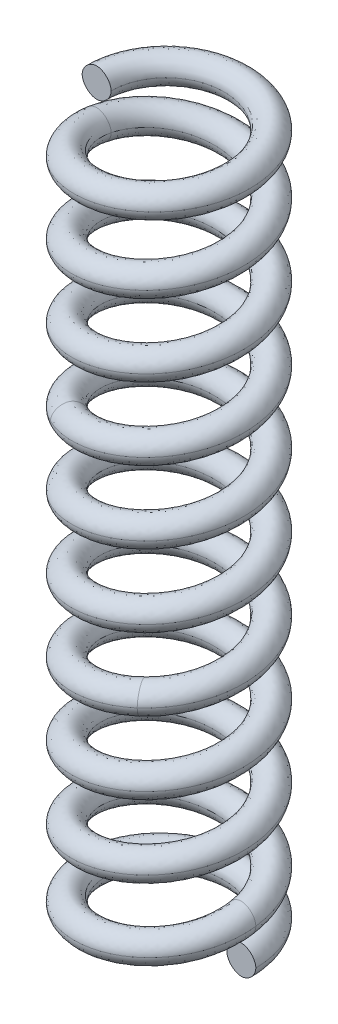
ISO-10303-21;
HEADER;
FILE_DESCRIPTION(('STEP AP214'),'2;1');
FILE_NAME('part.step','',(''),(''),'','','');
FILE_SCHEMA(('AUTOMOTIVE_DESIGN { 1 0 10303 214 1 1 1 1 }'));
ENDSEC;
DATA;
#1=APPLICATION_CONTEXT('core data for automotive mechanical design processes');
#2=APPLICATION_PROTOCOL_DEFINITION('international standard','automotive_design',2000,#1);
#3=PRODUCT_CONTEXT('',#1,'mechanical');
#4=PRODUCT('Part','Part','',(#3));
#5=PRODUCT_RELATED_PRODUCT_CATEGORY('part','',(#4));
#6=PRODUCT_DEFINITION_FORMATION('','',#4);
#7=PRODUCT_DEFINITION_CONTEXT('part definition',#1,'design');
#8=PRODUCT_DEFINITION('design','',#6,#7);
#9=PRODUCT_DEFINITION_SHAPE('','',#8);
#10=(LENGTH_UNIT() NAMED_UNIT(*) SI_UNIT(.MILLI.,.METRE.));
#11=(NAMED_UNIT(*) PLANE_ANGLE_UNIT() SI_UNIT($,.RADIAN.));
#12=(NAMED_UNIT(*) SI_UNIT($,.STERADIAN.) SOLID_ANGLE_UNIT());
#13=UNCERTAINTY_MEASURE_WITH_UNIT(LENGTH_MEASURE(1.E-05),#10,'distance_accuracy_value','');
#14=(GEOMETRIC_REPRESENTATION_CONTEXT(3) GLOBAL_UNCERTAINTY_ASSIGNED_CONTEXT((#13)) GLOBAL_UNIT_ASSIGNED_CONTEXT((#10,
#11,#12)) REPRESENTATION_CONTEXT('',''));
#15=CARTESIAN_POINT('',(0.,0.,0.));
#16=DIRECTION('',(0.,0.,1.));
#17=DIRECTION('',(1.,0.,0.));
#18=AXIS2_PLACEMENT_3D('',#15,#16,#17);
#19=CARTESIAN_POINT('',(-2.4,18.,0.));
#20=CARTESIAN_POINT('',(-2.4,18.04166666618,0.314159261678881));
#21=CARTESIAN_POINT('',(-2.275036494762,18.12239583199,0.942331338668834));
#22=CARTESIAN_POINT('',(-1.74123756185,18.23567708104,1.74124278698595));
#23=CARTESIAN_POINT('',(-0.942351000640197,18.34114583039,2.27503506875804));
#24=CARTESIAN_POINT('',(-4.5338434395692E-08,18.43880208,2.46248213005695));
#25=CARTESIAN_POINT('',(0.942350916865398,18.52864582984,2.27503641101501));
#26=CARTESIAN_POINT('',(1.741237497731,18.61067707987,1.74123762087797));
#27=CARTESIAN_POINT('',(2.27503646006,18.68489583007,0.942351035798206));
#28=CARTESIAN_POINT('',(2.462481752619,18.75130208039,9.06822394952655E-08));
#29=CARTESIAN_POINT('',(2.275036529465,18.8098958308,-0.942350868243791));
#30=CARTESIAN_POINT('',(1.741237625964,18.86067708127,-1.74123749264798));
#31=CARTESIAN_POINT('',(0.942351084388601,18.90364583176,-2.27503634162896));
#32=CARTESIAN_POINT('',(1.35954573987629E-07,18.93880208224,-2.46248213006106));
#33=CARTESIAN_POINT('',(-0.942350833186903,18.96614583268,-2.27503513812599));
#34=CARTESIAN_POINT('',(-1.741237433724,18.98567708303,-1.74124291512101));
#35=CARTESIAN_POINT('',(-2.27503642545,18.99739583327,-0.942331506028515));
#36=CARTESIAN_POINT('',(-2.399999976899,19.,-0.314159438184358));
#37=CARTESIAN_POINT('',(-2.4,19.,-1.76482273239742E-07));
#38=CARTESIAN_POINT('',(-2.4,17.8,0.));
#39=CARTESIAN_POINT('',(-2.4,17.84166666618,0.314159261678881));
#40=CARTESIAN_POINT('',(-2.275036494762,17.92239583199,0.942331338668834));
#41=CARTESIAN_POINT('',(-1.74123756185,18.03567708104,1.74124278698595));
#42=CARTESIAN_POINT('',(-0.942351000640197,18.14114583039,2.27503506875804));
#43=CARTESIAN_POINT('',(-4.5338434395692E-08,18.23880208,2.46248213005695));
#44=CARTESIAN_POINT('',(0.942350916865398,18.32864582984,2.27503641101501));
#45=CARTESIAN_POINT('',(1.741237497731,18.41067707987,1.74123762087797));
#46=CARTESIAN_POINT('',(2.27503646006,18.48489583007,0.942351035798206));
#47=CARTESIAN_POINT('',(2.462481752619,18.55130208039,9.06822394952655E-08));
#48=CARTESIAN_POINT('',(2.275036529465,18.6098958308,-0.942350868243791));
#49=CARTESIAN_POINT('',(1.741237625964,18.66067708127,-1.74123749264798));
#50=CARTESIAN_POINT('',(0.942351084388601,18.70364583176,-2.27503634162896));
#51=CARTESIAN_POINT('',(1.35954573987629E-07,18.73880208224,-2.46248213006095));
#52=CARTESIAN_POINT('',(-0.942350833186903,18.76614583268,-2.27503513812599));
#53=CARTESIAN_POINT('',(-1.741237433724,18.78567708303,-1.74124291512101));
#54=CARTESIAN_POINT('',(-2.27503642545,18.79739583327,-0.942331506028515));
#55=CARTESIAN_POINT('',(-2.399999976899,18.8,-0.314159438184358));
#56=CARTESIAN_POINT('',(-2.4,18.8,-1.76482273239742E-07));
#57=CARTESIAN_POINT('',(-2.,17.4,0.));
#58=CARTESIAN_POINT('',(-2.,17.44166666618,0.261799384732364));
#59=CARTESIAN_POINT('',(-1.895863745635,17.52239583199,0.785276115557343));
#60=CARTESIAN_POINT('',(-1.451031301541,17.63567708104,1.45103565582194));
#61=CARTESIAN_POINT('',(-0.785292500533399,17.74114583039,1.89586255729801));
#62=CARTESIAN_POINT('',(-3.77817499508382E-08,17.83880208,2.05206844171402));
#63=CARTESIAN_POINT('',(0.785292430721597,17.92864582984,1.89586367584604));
#64=CARTESIAN_POINT('',(1.451031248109,18.01067707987,1.45103135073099));
#65=CARTESIAN_POINT('',(1.895863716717,18.08489583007,0.785292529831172));
#66=CARTESIAN_POINT('',(2.052068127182,18.15130208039,7.55677742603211E-08));
#67=CARTESIAN_POINT('',(1.895863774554,18.2098958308,-0.785292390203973));
#68=CARTESIAN_POINT('',(1.451031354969,18.26067708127,-1.45103124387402));
#69=CARTESIAN_POINT('',(0.785292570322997,18.30364583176,-1.89586361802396));
#70=CARTESIAN_POINT('',(1.13294609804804E-07,18.33880208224,-2.05206844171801));
#71=CARTESIAN_POINT('',(-0.7852923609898,18.36614583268,-1.89586261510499));
#72=CARTESIAN_POINT('',(-1.45103119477,18.38567708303,-1.45103576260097));
#73=CARTESIAN_POINT('',(-1.895863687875,18.39739583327,-0.785276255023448));
#74=CARTESIAN_POINT('',(-1.999999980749,18.4,-0.26179953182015));
#75=CARTESIAN_POINT('',(-2.,18.4,-1.47068579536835E-07));
#76=CARTESIAN_POINT('',(-1.6,17.8,0.));
#77=CARTESIAN_POINT('',(-1.6,17.84166666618,0.209439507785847));
#78=CARTESIAN_POINT('',(-1.516690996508,17.92239583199,0.628220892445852));
#79=CARTESIAN_POINT('',(-1.160825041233,18.03567708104,1.16082852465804));
#80=CARTESIAN_POINT('',(-0.628234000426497,18.14114583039,1.51669004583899));
#81=CARTESIAN_POINT('',(-3.02250585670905E-08,18.23880208,1.64165475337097));
#82=CARTESIAN_POINT('',(0.6282339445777,18.32864582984,1.51669094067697));
#83=CARTESIAN_POINT('',(1.160824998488,18.41067707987,1.16082508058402));
#84=CARTESIAN_POINT('',(1.516690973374,18.48489583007,0.628234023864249));
#85=CARTESIAN_POINT('',(1.641654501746,18.55130208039,6.04533090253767E-08));
#86=CARTESIAN_POINT('',(1.516691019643,18.6098958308,-0.628233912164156));
#87=CARTESIAN_POINT('',(1.160825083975,18.66067708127,-1.16082499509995));
#88=CARTESIAN_POINT('',(0.6282340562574,18.70364583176,-1.51669089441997));
#89=CARTESIAN_POINT('',(9.06346525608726E-08,18.73880208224,-1.64165475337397));
#90=CARTESIAN_POINT('',(-0.628233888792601,18.76614583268,-1.516690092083));
#91=CARTESIAN_POINT('',(-1.160824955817,18.78567708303,-1.16082861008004));
#92=CARTESIAN_POINT('',(-1.5166909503,18.79739583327,-0.62822100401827));
#93=CARTESIAN_POINT('',(-1.599999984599,18.8,-0.209439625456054));
#94=CARTESIAN_POINT('',(-1.6,18.8,-1.17654885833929E-07));
#95=CARTESIAN_POINT('',(-1.6,18.,0.));
#96=CARTESIAN_POINT('',(-1.6,18.04166666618,0.209439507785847));
#97=CARTESIAN_POINT('',(-1.516690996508,18.12239583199,0.628220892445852));
#98=CARTESIAN_POINT('',(-1.160825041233,18.23567708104,1.16082852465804));
#99=CARTESIAN_POINT('',(-0.628234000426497,18.34114583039,1.51669004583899));
#100=CARTESIAN_POINT('',(-3.02250585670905E-08,18.43880208,1.64165475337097));
#101=CARTESIAN_POINT('',(0.6282339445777,18.52864582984,1.51669094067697));
#102=CARTESIAN_POINT('',(1.160824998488,18.61067707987,1.16082508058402));
#103=CARTESIAN_POINT('',(1.516690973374,18.68489583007,0.628234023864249));
#104=CARTESIAN_POINT('',(1.641654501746,18.75130208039,6.04533090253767E-08));
#105=CARTESIAN_POINT('',(1.516691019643,18.8098958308,-0.628233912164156));
#106=CARTESIAN_POINT('',(1.160825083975,18.86067708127,-1.16082499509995));
#107=CARTESIAN_POINT('',(0.6282340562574,18.90364583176,-1.51669089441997));
#108=CARTESIAN_POINT('',(9.06346525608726E-08,18.93880208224,-1.64165475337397));
#109=CARTESIAN_POINT('',(-0.628233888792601,18.96614583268,-1.516690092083));
#110=CARTESIAN_POINT('',(-1.160824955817,18.98567708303,-1.16082861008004));
#111=CARTESIAN_POINT('',(-1.5166909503,18.99739583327,-0.62822100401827));
#112=CARTESIAN_POINT('',(-1.599999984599,19.,-0.209439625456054));
#113=CARTESIAN_POINT('',(-1.6,19.,-1.17654885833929E-07));
#114=B_SPLINE_SURFACE_WITH_KNOTS('',3,3,((#19,#20,#21,#22,#23,#24,#25,#26,#27,#28,#29,#30,#31,
#32,#33,#34,#35,#36,#37),(#38,#39,#40,#41,#42,#43,#44,#45,#46,#47,#48,#49,#50,#51,#52,#53,#54,
#55,#56),(#57,#58,#59,#60,#61,#62,#63,#64,#65,#66,#67,#68,#69,#70,#71,#72,#73,#74,#75),(#76,#77,
#78,#79,#80,#81,#82,#83,#84,#85,#86,#87,#88,#89,#90,#91,#92,#93,#94),(#95,#96,#97,#98,#99,#100,
#101,#102,#103,#104,#105,#106,#107,#108,#109,#110,#111,#112,#113)),.UNSPECIFIED.,.F.,.F.,.F.,(4,
1,4),(4,1,1,1,1,1,1,1,1,1,1,1,1,1,1,1,4),(0.5,0.75,1.),(59.69026041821,60.08295949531,
60.47565857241,60.86835764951,61.26105672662,61.65375580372,62.04645488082,62.43915395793,
62.83185303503,63.22455211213,63.61725118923,64.00995026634,64.40264934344,64.79534842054,
65.18804749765,65.58074657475,65.97344565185),.UNSPECIFIED.);
#115=CARTESIAN_POINT('',(-1.6,18.,0.));
#116=CARTESIAN_POINT('',(-1.6,18.04166666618,0.209439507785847));
#117=CARTESIAN_POINT('',(-1.516690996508,18.12239583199,0.628220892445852));
#118=CARTESIAN_POINT('',(-1.160825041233,18.23567708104,1.16082852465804));
#119=CARTESIAN_POINT('',(-0.628234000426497,18.34114583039,1.51669004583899));
#120=CARTESIAN_POINT('',(-3.02250585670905E-08,18.43880208,1.64165475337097));
#121=CARTESIAN_POINT('',(0.6282339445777,18.52864582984,1.51669094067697));
#122=CARTESIAN_POINT('',(1.160824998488,18.61067707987,1.16082508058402));
#123=CARTESIAN_POINT('',(1.516690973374,18.68489583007,0.628234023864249));
#124=CARTESIAN_POINT('',(1.641654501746,18.75130208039,6.04533090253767E-08));
#125=CARTESIAN_POINT('',(1.516691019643,18.8098958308,-0.628233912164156));
#126=CARTESIAN_POINT('',(1.160825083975,18.86067708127,-1.16082499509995));
#127=CARTESIAN_POINT('',(0.6282340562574,18.90364583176,-1.51669089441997));
#128=CARTESIAN_POINT('',(9.06346525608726E-08,18.93880208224,-1.64165475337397));
#129=CARTESIAN_POINT('',(-0.628233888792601,18.96614583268,-1.516690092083));
#130=CARTESIAN_POINT('',(-1.160824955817,18.98567708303,-1.16082861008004));
#131=CARTESIAN_POINT('',(-1.5166909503,18.99739583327,-0.62822100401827));
#132=CARTESIAN_POINT('',(-1.599999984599,19.,-0.209439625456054));
#133=CARTESIAN_POINT('',(-1.6,19.,-1.17654885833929E-07));
#134=B_SPLINE_CURVE_WITH_KNOTS('',3,(#115,#116,#117,#118,#119,#120,#121,#122,#123,#124,#125,
#126,#127,#128,#129,#130,#131,#132,#133),.UNSPECIFIED.,.F.,.F.,(4,1,1,1,1,1,1,1,1,1,1,1,1,1,1,1,
4),(59.69026041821,60.08295949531,60.47565857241,60.86835764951,61.26105672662,61.65375580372,
62.04645488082,62.43915395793,62.83185303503,63.22455211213,63.61725118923,64.00995026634,
64.40264934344,64.79534842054,65.18804749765,65.58074657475,65.97344565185),.UNSPECIFIED.);
#135=CARTESIAN_POINT('',(-1.6,19.,-1.17654890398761E-07));
#136=VERTEX_POINT('',#135);
#137=CARTESIAN_POINT('',(-1.6,18.,0.));
#138=VERTEX_POINT('',#137);
#139=EDGE_CURVE('E77',#136,#138,#134,.F.);
#140=CARTESIAN_POINT('',(-2.4,19.,-1.76482264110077E-07));
#141=CARTESIAN_POINT('',(-2.40000779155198,18.9802897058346,-1.76482878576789E-07));
#142=CARTESIAN_POINT('',(-2.39805921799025,18.9606733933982,-1.76339589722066E-07));
#143=CARTESIAN_POINT('',(-2.3908119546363,18.9222065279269,-1.75806643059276E-07));
#144=CARTESIAN_POINT('',(-2.38553810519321,18.9033513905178,-1.75418812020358E-07));
#145=CARTESIAN_POINT('',(-2.37073936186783,18.8627044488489,-1.74330596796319E-07));
#146=CARTESIAN_POINT('',(-2.36054058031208,18.8411625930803,-1.7358066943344E-07));
#147=CARTESIAN_POINT('',(-2.33675849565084,18.7999684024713,-1.71831875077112E-07));
#148=CARTESIAN_POINT('',(-2.32316358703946,18.7803228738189,-1.70832154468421E-07));
#149=CARTESIAN_POINT('',(-2.29300266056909,18.743098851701,-1.68614289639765E-07));
#150=CARTESIAN_POINT('',(-2.27640452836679,18.7255464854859,-1.67393784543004E-07));
#151=CARTESIAN_POINT('',(-2.24076391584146,18.6931472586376,-1.64772983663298E-07));
#152=CARTESIAN_POINT('',(-2.22172319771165,18.6782984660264,-1.63372817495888E-07));
#153=CARTESIAN_POINT('',(-2.18322961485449,18.6529368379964,-1.60542218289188E-07));
#154=CARTESIAN_POINT('',(-2.16394976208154,18.6421625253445,-1.59124504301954E-07));
#155=CARTESIAN_POINT('',(-2.12390502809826,18.6238648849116,-1.56179849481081E-07));
#156=CARTESIAN_POINT('',(-2.10314214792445,18.6163372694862,-1.54653055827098E-07));
#157=CARTESIAN_POINT('',(-2.06438694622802,18.6062401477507,-1.51803219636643E-07));
#158=CARTESIAN_POINT('',(-2.04656765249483,18.6030225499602,-1.50492897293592E-07));
#159=CARTESIAN_POINT('',(-2.01964230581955,18.6005066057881,-1.48512962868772E-07));
#160=CARTESIAN_POINT('',(-2.01063763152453,18.6000527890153,-1.47850809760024E-07));
#161=CARTESIAN_POINT('',(-1.99262397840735,18.5999560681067,-1.46526189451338E-07));
#162=CARTESIAN_POINT('',(-1.98361499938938,18.6003132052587,-1.45863722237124E-07));
#163=CARTESIAN_POINT('',(-1.95672465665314,18.6025448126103,-1.43886361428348E-07));
#164=CARTESIAN_POINT('',(-1.9389287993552,18.6055749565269,-1.42577751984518E-07));
#165=CARTESIAN_POINT('',(-1.90400908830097,18.6143091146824,-1.40009957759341E-07));
#166=CARTESIAN_POINT('',(-1.88688689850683,18.620019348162,-1.38750895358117E-07));
#167=CARTESIAN_POINT('',(-1.82523000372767,18.6453742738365,-1.34217020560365E-07));
#168=CARTESIAN_POINT('',(-1.7834727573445,18.6722235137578,-1.3114644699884E-07));
#169=CARTESIAN_POINT('',(-1.72835882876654,18.7207699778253,-1.27093654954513E-07));
#170=CARTESIAN_POINT('',(-1.71113632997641,18.7385038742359,-1.25827192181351E-07));
#171=CARTESIAN_POINT('',(-1.67961693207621,18.7764835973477,-1.2350944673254E-07));
#172=CARTESIAN_POINT('',(-1.66532003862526,18.7967294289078,-1.22458164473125E-07));
#173=CARTESIAN_POINT('',(-1.64214745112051,18.8362353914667,-1.20754179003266E-07));
#174=CARTESIAN_POINT('',(-1.63278617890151,18.8552124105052,-1.20065777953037E-07));
#175=CARTESIAN_POINT('',(-1.61725731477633,18.8943955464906,-1.18923869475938E-07));
#176=CARTESIAN_POINT('',(-1.61107853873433,18.9145970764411,-1.18469539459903E-07));
#177=CARTESIAN_POINT('',(-1.60237979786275,18.9564718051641,-1.17829917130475E-07));
#178=CARTESIAN_POINT('',(-1.59999099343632,18.9781716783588,-1.17654269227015E-07));
#179=CARTESIAN_POINT('',(-1.6,19.,-1.17654904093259E-07));
#180=B_SPLINE_CURVE_WITH_KNOTS('',3,(#140,#141,#142,#143,#144,#145,#146,#147,#148,#149,#150,
#151,#152,#153,#154,#155,#156,#157,#158,#159,#160,#161,#162,#163,#164,#165,#166,#167,#168,#169,
#170,#171,#172,#173,#174,#175,#176,#177,#178,#179),.UNSPECIFIED.,.F.,.F.,(4,2,2,2,2,2,2,2,2,2,2,
2,2,2,2,2,2,2,2,4),(0.,0.0588960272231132,0.11735722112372,0.188497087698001,0.259883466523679,
0.332083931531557,0.404232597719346,0.470240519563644,0.536161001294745,0.590229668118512,
0.617245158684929,0.644262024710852,0.69814399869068,0.752151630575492,0.897788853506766,
0.971780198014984,1.04577168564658,1.10902880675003,1.17206208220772,1.23723258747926),.UNSPECIFIED.);
#181=CARTESIAN_POINT('',(-2.4,19.,-1.76482264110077E-07));
#182=VERTEX_POINT('',#181);
#183=EDGE_CURVE('E22',#182,#136,#180,.T.);
#184=CARTESIAN_POINT('',(-2.4,18.,0.));
#185=CARTESIAN_POINT('',(-2.4,18.04166666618,0.314159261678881));
#186=CARTESIAN_POINT('',(-2.275036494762,18.12239583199,0.942331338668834));
#187=CARTESIAN_POINT('',(-1.74123756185,18.23567708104,1.74124278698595));
#188=CARTESIAN_POINT('',(-0.942351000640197,18.34114583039,2.27503506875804));
#189=CARTESIAN_POINT('',(-4.5338434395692E-08,18.43880208,2.46248213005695));
#190=CARTESIAN_POINT('',(0.942350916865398,18.52864582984,2.27503641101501));
#191=CARTESIAN_POINT('',(1.741237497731,18.61067707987,1.74123762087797));
#192=CARTESIAN_POINT('',(2.27503646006,18.68489583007,0.942351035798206));
#193=CARTESIAN_POINT('',(2.462481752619,18.75130208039,9.06822394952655E-08));
#194=CARTESIAN_POINT('',(2.275036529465,18.8098958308,-0.942350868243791));
#195=CARTESIAN_POINT('',(1.741237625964,18.86067708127,-1.74123749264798));
#196=CARTESIAN_POINT('',(0.942351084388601,18.90364583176,-2.27503634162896));
#197=CARTESIAN_POINT('',(1.35954573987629E-07,18.93880208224,-2.46248213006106));
#198=CARTESIAN_POINT('',(-0.942350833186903,18.96614583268,-2.27503513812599));
#199=CARTESIAN_POINT('',(-1.741237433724,18.98567708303,-1.74124291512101));
#200=CARTESIAN_POINT('',(-2.27503642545,18.99739583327,-0.942331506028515));
#201=CARTESIAN_POINT('',(-2.399999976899,19.,-0.314159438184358));
#202=CARTESIAN_POINT('',(-2.4,19.,-1.76482273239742E-07));
#203=B_SPLINE_CURVE_WITH_KNOTS('',3,(#184,#185,#186,#187,#188,#189,#190,#191,#192,#193,#194,
#195,#196,#197,#198,#199,#200,#201,#202),.UNSPECIFIED.,.F.,.F.,(4,1,1,1,1,1,1,1,1,1,1,1,1,1,1,1,
4),(59.69026041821,60.08295949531,60.47565857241,60.86835764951,61.26105672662,61.65375580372,
62.04645488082,62.43915395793,62.83185303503,63.22455211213,63.61725118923,64.00995026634,
64.40264934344,64.79534842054,65.18804749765,65.58074657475,65.97344565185),.UNSPECIFIED.);
#204=CARTESIAN_POINT('',(-2.4,18.,0.));
#205=VERTEX_POINT('',#204);
#206=EDGE_CURVE('E83',#205,#182,#203,.T.);
#207=CARTESIAN_POINT('',(-2.4,18.,0.));
#208=CARTESIAN_POINT('',(-2.4,17.8,0.));
#209=CARTESIAN_POINT('',(-2.,17.4,0.));
#210=CARTESIAN_POINT('',(-1.6,17.8,0.));
#211=CARTESIAN_POINT('',(-1.6,18.,0.));
#212=B_SPLINE_CURVE_WITH_KNOTS('',3,(#207,#208,#209,#210,#211),.UNSPECIFIED.,.F.,.F.,(4,1,4),
(0.5,0.75,1.),.UNSPECIFIED.);
#213=EDGE_CURVE('E78',#205,#138,#212,.T.);
#214=ORIENTED_EDGE('',*,*,#139,.F.);
#215=ORIENTED_EDGE('',*,*,#183,.F.);
#216=ORIENTED_EDGE('',*,*,#206,.F.);
#217=ORIENTED_EDGE('',*,*,#213,.T.);
#218=EDGE_LOOP('',(#214,#215,#216,#217));
#219=FACE_BOUND('',#218,.T.);
#220=ADVANCED_FACE('F16',(#219),#114,.T.);
#221=CARTESIAN_POINT('',(-2.,19.,-1.47068579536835E-07));
#222=DIRECTION('',(-7.35342799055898E-08,0.,0.999999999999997));
#223=DIRECTION('',(0.999999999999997,0.,7.35342799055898E-08));
#224=AXIS2_PLACEMENT_3D('',#221,#222,#223);
#225=PLANE('',#224);
#226=ORIENTED_EDGE('',*,*,#183,.T.);
#227=CARTESIAN_POINT('',(-2.4,19.,-1.76482264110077E-07));
#228=CARTESIAN_POINT('',(-2.40000778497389,19.0196698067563,-1.76482866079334E-07));
#229=CARTESIAN_POINT('',(-2.39806717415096,19.0392463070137,-1.7634016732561E-07));
#230=CARTESIAN_POINT('',(-2.39084830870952,19.0776378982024,-1.75809323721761E-07));
#231=CARTESIAN_POINT('',(-2.38559470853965,19.096457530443,-1.75422991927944E-07));
#232=CARTESIAN_POINT('',(-2.37083913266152,19.137064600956,-1.74337950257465E-07));
#233=CARTESIAN_POINT('',(-2.36065939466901,19.1586011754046,-1.73589407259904E-07));
#234=CARTESIAN_POINT('',(-2.33691649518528,19.1997881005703,-1.71843492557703E-07));
#235=CARTESIAN_POINT('',(-2.32334173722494,19.2194316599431,-1.70845268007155E-07));
#236=CARTESIAN_POINT('',(-2.29322028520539,19.2566581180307,-1.68630307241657E-07));
#237=CARTESIAN_POINT('',(-2.27664110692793,19.2742146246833,-1.67411182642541E-07));
#238=CARTESIAN_POINT('',(-2.24103872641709,19.3066263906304,-1.64793190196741E-07));
#239=CARTESIAN_POINT('',(-2.2220172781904,19.3214835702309,-1.63394451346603E-07));
#240=CARTESIAN_POINT('',(-2.18354035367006,19.3468802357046,-1.60565077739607E-07));
#241=CARTESIAN_POINT('',(-2.16425592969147,19.3576777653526,-1.5914701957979E-07));
#242=CARTESIAN_POINT('',(-2.12419813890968,19.3760206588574,-1.56201401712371E-07));
#243=CARTESIAN_POINT('',(-2.10342676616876,19.3835702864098,-1.54673988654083E-07));
#244=CARTESIAN_POINT('',(-2.06466186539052,19.393702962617,-1.51823439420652E-07));
#245=CARTESIAN_POINT('',(-2.04684239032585,19.3969358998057,-1.50513100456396E-07));
#246=CARTESIAN_POINT('',(-2.0199148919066,19.3994757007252,-1.48533007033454E-07));
#247=CARTESIAN_POINT('',(-2.01090923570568,19.399937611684,-1.47870782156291E-07));
#248=CARTESIAN_POINT('',(-1.99289290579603,19.4000503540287,-1.46545964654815E-07));
#249=CARTESIAN_POINT('',(-1.98388223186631,19.399701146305,-1.45883372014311E-07));
#250=CARTESIAN_POINT('',(-1.95698518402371,19.3974920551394,-1.43905517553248E-07));
#251=CARTESIAN_POINT('',(-1.93918341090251,19.3944752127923,-1.4259647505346E-07));
#252=CARTESIAN_POINT('',(-1.9042504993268,19.3857646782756,-1.40027709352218E-07));
#253=CARTESIAN_POINT('',(-1.8871210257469,19.3800647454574,-1.38768108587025E-07));
#254=CARTESIAN_POINT('',(-1.82546276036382,19.35475401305,-1.34234122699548E-07));
#255=CARTESIAN_POINT('',(-1.78370594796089,19.3279404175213,-1.31163573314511E-07));
#256=CARTESIAN_POINT('',(-1.7285821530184,19.2794476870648,-1.27110070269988E-07));
#257=CARTESIAN_POINT('',(-1.71135433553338,19.2617315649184,-1.25843225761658E-07));
#258=CARTESIAN_POINT('',(-1.67981980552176,19.2237876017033,-1.23524362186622E-07));
#259=CARTESIAN_POINT('',(-1.66551311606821,19.2035597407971,-1.22472344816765E-07));
#260=CARTESIAN_POINT('',(-1.64230554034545,19.1640679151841,-1.20765789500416E-07));
#261=CARTESIAN_POINT('',(-1.63292263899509,19.1450855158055,-1.20075811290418E-07));
#262=CARTESIAN_POINT('',(-1.61735179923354,19.105888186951,-1.18930818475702E-07));
#263=CARTESIAN_POINT('',(-1.61115267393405,19.0856778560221,-1.18474981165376E-07));
#264=CARTESIAN_POINT('',(-1.60239968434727,19.043708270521,-1.17831353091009E-07));
#265=CARTESIAN_POINT('',(-1.59999107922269,19.0219193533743,-1.17654243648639E-07));
#266=CARTESIAN_POINT('',(-1.6,19.,-1.17654885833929E-07));
#267=B_SPLINE_CURVE_WITH_KNOTS('',3,(#227,#228,#229,#230,#231,#232,#233,#234,#235,#236,#237,
#238,#239,#240,#241,#242,#243,#244,#245,#246,#247,#248,#249,#250,#251,#252,#253,#254,#255,#256,
#257,#258,#259,#260,#261,#262,#263,#264,#265,#266),.UNSPECIFIED.,.F.,.F.,(4,2,2,2,2,2,2,2,2,2,2,
2,2,2,2,2,2,2,2,4),(0.,0.0587761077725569,0.117119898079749,0.188221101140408,0.259568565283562,
0.331739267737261,0.403858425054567,0.469912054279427,0.535878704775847,0.589956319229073,
0.616975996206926,0.643996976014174,0.697889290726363,0.751907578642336,0.897487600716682,
0.971452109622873,1.04541720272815,1.10871731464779,1.17179345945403,1.23723257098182),.UNSPECIFIED.);
#268=EDGE_CURVE('E87',#182,#136,#267,.T.);
#269=ORIENTED_EDGE('',*,*,#268,.F.);
#270=EDGE_LOOP('',(#226,#269));
#271=FACE_BOUND('',#270,.T.);
#272=ADVANCED_FACE('F86',(#271),#225,.T.);
#273=CARTESIAN_POINT('',(-1.6,18.,0.));
#274=CARTESIAN_POINT('',(-1.6,18.04166666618,0.209439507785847));
#275=CARTESIAN_POINT('',(-1.516690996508,18.12239583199,0.628220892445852));
#276=CARTESIAN_POINT('',(-1.160825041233,18.23567708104,1.16082852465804));
#277=CARTESIAN_POINT('',(-0.628234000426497,18.34114583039,1.51669004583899));
#278=CARTESIAN_POINT('',(-3.02250585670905E-08,18.43880208,1.64165475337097));
#279=CARTESIAN_POINT('',(0.6282339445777,18.52864582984,1.51669094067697));
#280=CARTESIAN_POINT('',(1.160824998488,18.61067707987,1.16082508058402));
#281=CARTESIAN_POINT('',(1.516690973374,18.68489583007,0.628234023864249));
#282=CARTESIAN_POINT('',(1.641654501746,18.75130208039,6.04533090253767E-08));
#283=CARTESIAN_POINT('',(1.516691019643,18.8098958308,-0.628233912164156));
#284=CARTESIAN_POINT('',(1.160825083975,18.86067708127,-1.16082499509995));
#285=CARTESIAN_POINT('',(0.6282340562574,18.90364583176,-1.51669089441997));
#286=CARTESIAN_POINT('',(9.06346525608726E-08,18.93880208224,-1.64165475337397));
#287=CARTESIAN_POINT('',(-0.628233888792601,18.96614583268,-1.516690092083));
#288=CARTESIAN_POINT('',(-1.160824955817,18.98567708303,-1.16082861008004));
#289=CARTESIAN_POINT('',(-1.5166909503,18.99739583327,-0.62822100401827));
#290=CARTESIAN_POINT('',(-1.599999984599,19.,-0.209439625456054));
#291=CARTESIAN_POINT('',(-1.6,19.,-1.17654885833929E-07));
#292=CARTESIAN_POINT('',(-1.6,18.2,0.));
#293=CARTESIAN_POINT('',(-1.6,18.24166666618,0.209439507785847));
#294=CARTESIAN_POINT('',(-1.516690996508,18.32239583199,0.628220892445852));
#295=CARTESIAN_POINT('',(-1.160825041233,18.43567708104,1.16082852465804));
#296=CARTESIAN_POINT('',(-0.628234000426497,18.54114583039,1.51669004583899));
#297=CARTESIAN_POINT('',(-3.02250585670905E-08,18.63880208,1.64165475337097));
#298=CARTESIAN_POINT('',(0.6282339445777,18.72864582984,1.51669094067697));
#299=CARTESIAN_POINT('',(1.160824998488,18.81067707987,1.16082508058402));
#300=CARTESIAN_POINT('',(1.516690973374,18.88489583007,0.628234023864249));
#301=CARTESIAN_POINT('',(1.641654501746,18.95130208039,6.04533090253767E-08));
#302=CARTESIAN_POINT('',(1.516691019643,19.0098958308,-0.628233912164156));
#303=CARTESIAN_POINT('',(1.160825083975,19.06067708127,-1.16082499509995));
#304=CARTESIAN_POINT('',(0.6282340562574,19.10364583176,-1.51669089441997));
#305=CARTESIAN_POINT('',(9.06346525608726E-08,19.13880208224,-1.64165475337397));
#306=CARTESIAN_POINT('',(-0.628233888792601,19.16614583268,-1.516690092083));
#307=CARTESIAN_POINT('',(-1.160824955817,19.18567708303,-1.16082861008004));
#308=CARTESIAN_POINT('',(-1.5166909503,19.19739583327,-0.62822100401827));
#309=CARTESIAN_POINT('',(-1.599999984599,19.2,-0.209439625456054));
#310=CARTESIAN_POINT('',(-1.6,19.2,-1.17654885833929E-07));
#311=CARTESIAN_POINT('',(-2.,18.6,0.));
#312=CARTESIAN_POINT('',(-2.,18.64166666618,0.261799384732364));
#313=CARTESIAN_POINT('',(-1.895863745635,18.72239583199,0.785276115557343));
#314=CARTESIAN_POINT('',(-1.451031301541,18.83567708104,1.45103565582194));
#315=CARTESIAN_POINT('',(-0.785292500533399,18.94114583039,1.89586255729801));
#316=CARTESIAN_POINT('',(-3.77817499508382E-08,19.03880208,2.05206844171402));
#317=CARTESIAN_POINT('',(0.785292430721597,19.12864582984,1.89586367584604));
#318=CARTESIAN_POINT('',(1.451031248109,19.21067707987,1.45103135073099));
#319=CARTESIAN_POINT('',(1.895863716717,19.28489583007,0.785292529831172));
#320=CARTESIAN_POINT('',(2.052068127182,19.35130208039,7.55677742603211E-08));
#321=CARTESIAN_POINT('',(1.895863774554,19.4098958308,-0.785292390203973));
#322=CARTESIAN_POINT('',(1.451031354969,19.46067708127,-1.45103124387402));
#323=CARTESIAN_POINT('',(0.785292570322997,19.50364583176,-1.89586361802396));
#324=CARTESIAN_POINT('',(1.13294609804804E-07,19.53880208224,-2.05206844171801));
#325=CARTESIAN_POINT('',(-0.7852923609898,19.56614583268,-1.89586261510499));
#326=CARTESIAN_POINT('',(-1.45103119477,19.58567708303,-1.45103576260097));
#327=CARTESIAN_POINT('',(-1.895863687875,19.59739583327,-0.785276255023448));
#328=CARTESIAN_POINT('',(-1.999999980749,19.6,-0.261799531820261));
#329=CARTESIAN_POINT('',(-2.,19.6,-1.47068579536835E-07));
#330=CARTESIAN_POINT('',(-2.4,18.2,0.));
#331=CARTESIAN_POINT('',(-2.4,18.24166666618,0.314159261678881));
#332=CARTESIAN_POINT('',(-2.275036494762,18.32239583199,0.942331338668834));
#333=CARTESIAN_POINT('',(-1.74123756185,18.43567708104,1.74124278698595));
#334=CARTESIAN_POINT('',(-0.942351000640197,18.54114583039,2.27503506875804));
#335=CARTESIAN_POINT('',(-4.5338434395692E-08,18.63880208,2.46248213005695));
#336=CARTESIAN_POINT('',(0.942350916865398,18.72864582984,2.27503641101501));
#337=CARTESIAN_POINT('',(1.741237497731,18.81067707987,1.74123762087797));
#338=CARTESIAN_POINT('',(2.27503646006,18.88489583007,0.942351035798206));
#339=CARTESIAN_POINT('',(2.462481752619,18.95130208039,9.06822394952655E-08));
#340=CARTESIAN_POINT('',(2.275036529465,19.0098958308,-0.942350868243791));
#341=CARTESIAN_POINT('',(1.741237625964,19.06067708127,-1.74123749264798));
#342=CARTESIAN_POINT('',(0.942351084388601,19.10364583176,-2.27503634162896));
#343=CARTESIAN_POINT('',(1.35954573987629E-07,19.13880208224,-2.46248213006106));
#344=CARTESIAN_POINT('',(-0.942350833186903,19.16614583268,-2.27503513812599));
#345=CARTESIAN_POINT('',(-1.741237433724,19.18567708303,-1.74124291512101));
#346=CARTESIAN_POINT('',(-2.27503642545,19.19739583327,-0.942331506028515));
#347=CARTESIAN_POINT('',(-2.399999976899,19.2,-0.314159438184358));
#348=CARTESIAN_POINT('',(-2.4,19.2,-1.76482273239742E-07));
#349=CARTESIAN_POINT('',(-2.4,18.,0.));
#350=CARTESIAN_POINT('',(-2.4,18.04166666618,0.314159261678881));
#351=CARTESIAN_POINT('',(-2.275036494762,18.12239583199,0.942331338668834));
#352=CARTESIAN_POINT('',(-1.74123756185,18.23567708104,1.74124278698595));
#353=CARTESIAN_POINT('',(-0.942351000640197,18.34114583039,2.27503506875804));
#354=CARTESIAN_POINT('',(-4.5338434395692E-08,18.43880208,2.46248213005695));
#355=CARTESIAN_POINT('',(0.942350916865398,18.52864582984,2.27503641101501));
#356=CARTESIAN_POINT('',(1.741237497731,18.61067707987,1.74123762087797));
#357=CARTESIAN_POINT('',(2.27503646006,18.68489583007,0.942351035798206));
#358=CARTESIAN_POINT('',(2.462481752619,18.75130208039,9.06822394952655E-08));
#359=CARTESIAN_POINT('',(2.275036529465,18.8098958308,-0.942350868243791));
#360=CARTESIAN_POINT('',(1.741237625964,18.86067708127,-1.74123749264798));
#361=CARTESIAN_POINT('',(0.942351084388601,18.90364583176,-2.27503634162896));
#362=CARTESIAN_POINT('',(1.35954573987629E-07,18.93880208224,-2.46248213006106));
#363=CARTESIAN_POINT('',(-0.942350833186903,18.96614583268,-2.27503513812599));
#364=CARTESIAN_POINT('',(-1.741237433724,18.98567708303,-1.74124291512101));
#365=CARTESIAN_POINT('',(-2.27503642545,18.99739583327,-0.942331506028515));
#366=CARTESIAN_POINT('',(-2.399999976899,19.,-0.314159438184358));
#367=CARTESIAN_POINT('',(-2.4,19.,-1.76482273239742E-07));
#368=B_SPLINE_SURFACE_WITH_KNOTS('',3,3,((#273,#274,#275,#276,#277,#278,#279,#280,#281,#282,
#283,#284,#285,#286,#287,#288,#289,#290,#291),(#292,#293,#294,#295,#296,#297,#298,#299,#300,
#301,#302,#303,#304,#305,#306,#307,#308,#309,#310),(#311,#312,#313,#314,#315,#316,#317,#318,
#319,#320,#321,#322,#323,#324,#325,#326,#327,#328,#329),(#330,#331,#332,#333,#334,#335,#336,
#337,#338,#339,#340,#341,#342,#343,#344,#345,#346,#347,#348),(#349,#350,#351,#352,#353,#354,
#355,#356,#357,#358,#359,#360,#361,#362,#363,#364,#365,#366,#367)),.UNSPECIFIED.,.F.,.F.,.F.,(4,
1,4),(4,1,1,1,1,1,1,1,1,1,1,1,1,1,1,1,4),(0.,0.25,0.5),(59.69026041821,60.08295949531,
60.47565857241,60.86835764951,61.26105672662,61.65375580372,62.04645488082,62.43915395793,
62.83185303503,63.22455211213,63.61725118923,64.00995026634,64.40264934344,64.79534842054,
65.18804749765,65.58074657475,65.97344565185),.UNSPECIFIED.);
#369=CARTESIAN_POINT('',(-1.6,18.,0.));
#370=CARTESIAN_POINT('',(-1.6,18.2,0.));
#371=CARTESIAN_POINT('',(-2.,18.6,0.));
#372=CARTESIAN_POINT('',(-2.4,18.2,0.));
#373=CARTESIAN_POINT('',(-2.4,18.,0.));
#374=B_SPLINE_CURVE_WITH_KNOTS('',3,(#369,#370,#371,#372,#373),.UNSPECIFIED.,.F.,.F.,(4,1,4),
(0.,0.25,0.5),.UNSPECIFIED.);
#375=EDGE_CURVE('E91',#205,#138,#374,.F.);
#376=ORIENTED_EDGE('',*,*,#206,.T.);
#377=ORIENTED_EDGE('',*,*,#268,.T.);
#378=ORIENTED_EDGE('',*,*,#139,.T.);
#379=ORIENTED_EDGE('',*,*,#375,.F.);
#380=EDGE_LOOP('',(#376,#377,#378,#379));
#381=FACE_BOUND('',#380,.T.);
#382=ADVANCED_FACE('F89',(#381),#368,.T.);
#383=CARTESIAN_POINT('',(-0.800000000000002,12.33333333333,1.38564064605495));
#384=CARTESIAN_POINT('',(-0.543045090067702,12.39236111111,1.53399363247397));
#385=CARTESIAN_POINT('',(0.0550554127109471,12.51041666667,1.68374211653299));
#386=CARTESIAN_POINT('',(0.935976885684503,12.6875,1.40077218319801));
#387=CARTESIAN_POINT('',(1.53451128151,12.86458333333,0.69527742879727));
#388=CARTESIAN_POINT('',(1.670270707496,13.04166666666,-0.219894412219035));
#389=CARTESIAN_POINT('',(1.302276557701,13.21875,-1.06875122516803));
#390=CARTESIAN_POINT('',(0.541523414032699,13.39583333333,-1.59527621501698));
#391=CARTESIAN_POINT('',(-0.382551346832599,13.57291666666,-1.64067315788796));
#392=CARTESIAN_POINT('',(-1.191250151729,13.75,-1.19125015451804));
#393=CARTESIAN_POINT('',(-1.64067314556,13.92708333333,-0.382551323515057));
#394=CARTESIAN_POINT('',(-1.595276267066,14.10416666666,0.541523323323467));
#395=CARTESIAN_POINT('',(-1.068751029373,14.28125,1.30227689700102));
#396=CARTESIAN_POINT('',(-0.2198951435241,14.45833333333,1.67026944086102));
#397=CARTESIAN_POINT('',(0.695280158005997,14.63541666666,1.53451600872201));
#398=CARTESIAN_POINT('',(1.400761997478,14.8125,0.935959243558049));
#399=CARTESIAN_POINT('',(1.683780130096,14.98958333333,0.055121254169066));
#400=CARTESIAN_POINT('',(1.458977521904,15.16666666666,-0.842341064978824));
#401=CARTESIAN_POINT('',(0.794153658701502,15.34375,-1.48575699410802));
#402=CARTESIAN_POINT('',(-0.110183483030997,15.52083333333,-1.68107509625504));
#403=CARTESIAN_POINT('',(-0.981289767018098,15.69791666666,-1.36938828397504));
#404=CARTESIAN_POINT('',(-1.556443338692,15.875,-0.644699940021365));
#405=CARTESIAN_POINT('',(-1.66218039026,16.05208333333,0.274427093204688));
#406=CARTESIAN_POINT('',(-1.266611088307,16.22916666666,1.11078811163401));
#407=CARTESIAN_POINT('',(-0.4890374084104,16.40625,1.61214028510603));
#408=CARTESIAN_POINT('',(0.436027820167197,16.58333333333,1.62727797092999));
#409=CARTESIAN_POINT('',(1.229588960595,16.76041666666,1.15163576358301));
#410=CARTESIAN_POINT('',(1.652311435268,16.9375,0.328665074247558));
#411=CARTESIAN_POINT('',(1.576703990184,17.11458333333,-0.593428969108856));
#412=CARTESIAN_POINT('',(1.025569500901,17.29166666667,-1.33654965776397));
#413=CARTESIAN_POINT('',(0.165127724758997,17.46875,-1.67656446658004));
#414=CARTESIAN_POINT('',(-0.745115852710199,17.64583333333,-1.51096585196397));
#415=CARTESIAN_POINT('',(-1.430635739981,17.82291666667,-0.889550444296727));
#416=CARTESIAN_POINT('',(-1.6,17.94097222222,-0.296705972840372));
#417=CARTESIAN_POINT('',(-1.6,18.,0.));
#418=CARTESIAN_POINT('',(-0.800000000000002,12.53333333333,1.38564064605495));
#419=CARTESIAN_POINT('',(-0.543045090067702,12.59236111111,1.53399363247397));
#420=CARTESIAN_POINT('',(0.0550554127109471,12.71041666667,1.68374211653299));
#421=CARTESIAN_POINT('',(0.935976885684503,12.8875,1.40077218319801));
#422=CARTESIAN_POINT('',(1.53451128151,13.06458333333,0.69527742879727));
#423=CARTESIAN_POINT('',(1.670270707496,13.24166666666,-0.219894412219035));
#424=CARTESIAN_POINT('',(1.302276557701,13.41875,-1.06875122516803));
#425=CARTESIAN_POINT('',(0.541523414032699,13.59583333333,-1.59527621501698));
#426=CARTESIAN_POINT('',(-0.382551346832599,13.77291666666,-1.64067315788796));
#427=CARTESIAN_POINT('',(-1.191250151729,13.95,-1.19125015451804));
#428=CARTESIAN_POINT('',(-1.64067314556,14.12708333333,-0.382551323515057));
#429=CARTESIAN_POINT('',(-1.595276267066,14.30416666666,0.541523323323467));
#430=CARTESIAN_POINT('',(-1.068751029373,14.48125,1.30227689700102));
#431=CARTESIAN_POINT('',(-0.2198951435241,14.65833333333,1.67026944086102));
#432=CARTESIAN_POINT('',(0.695280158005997,14.83541666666,1.53451600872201));
#433=CARTESIAN_POINT('',(1.400761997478,15.0125,0.935959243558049));
#434=CARTESIAN_POINT('',(1.683780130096,15.18958333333,0.055121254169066));
#435=CARTESIAN_POINT('',(1.458977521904,15.36666666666,-0.842341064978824));
#436=CARTESIAN_POINT('',(0.794153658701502,15.54375,-1.48575699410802));
#437=CARTESIAN_POINT('',(-0.110183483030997,15.72083333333,-1.68107509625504));
#438=CARTESIAN_POINT('',(-0.981289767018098,15.89791666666,-1.36938828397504));
#439=CARTESIAN_POINT('',(-1.556443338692,16.075,-0.644699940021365));
#440=CARTESIAN_POINT('',(-1.66218039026,16.25208333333,0.274427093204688));
#441=CARTESIAN_POINT('',(-1.266611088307,16.42916666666,1.11078811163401));
#442=CARTESIAN_POINT('',(-0.4890374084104,16.60625,1.61214028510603));
#443=CARTESIAN_POINT('',(0.436027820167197,16.78333333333,1.62727797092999));
#444=CARTESIAN_POINT('',(1.229588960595,16.96041666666,1.15163576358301));
#445=CARTESIAN_POINT('',(1.652311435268,17.1375,0.328665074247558));
#446=CARTESIAN_POINT('',(1.576703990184,17.31458333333,-0.593428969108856));
#447=CARTESIAN_POINT('',(1.025569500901,17.49166666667,-1.33654965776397));
#448=CARTESIAN_POINT('',(0.165127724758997,17.66875,-1.67656446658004));
#449=CARTESIAN_POINT('',(-0.745115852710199,17.84583333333,-1.51096585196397));
#450=CARTESIAN_POINT('',(-1.430635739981,18.02291666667,-0.889550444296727));
#451=CARTESIAN_POINT('',(-1.6,18.14097222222,-0.296705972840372));
#452=CARTESIAN_POINT('',(-1.6,18.2,0.));
#453=CARTESIAN_POINT('',(-1.,12.93333333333,1.732050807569));
#454=CARTESIAN_POINT('',(-0.678806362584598,12.99236111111,1.91749204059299));
#455=CARTESIAN_POINT('',(0.0688192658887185,13.11041666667,2.10467764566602));
#456=CARTESIAN_POINT('',(1.169971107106,13.2875,1.75096522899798));
#457=CARTESIAN_POINT('',(1.918139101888,13.46458333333,0.869096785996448));
#458=CARTESIAN_POINT('',(2.087838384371,13.64166666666,-0.274868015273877));
#459=CARTESIAN_POINT('',(1.627845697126,13.81875,-1.33593903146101));
#460=CARTESIAN_POINT('',(0.6769042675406,13.99583333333,-1.99409526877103));
#461=CARTESIAN_POINT('',(-0.478189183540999,14.17291666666,-2.05084144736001));
#462=CARTESIAN_POINT('',(-1.489062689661,14.35,-1.48906269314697));
#463=CARTESIAN_POINT('',(-2.05084143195,14.52708333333,-0.47818915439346));
#464=CARTESIAN_POINT('',(-1.994095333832,14.70416666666,0.676904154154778));
#465=CARTESIAN_POINT('',(-1.335938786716,14.88125,1.627846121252));
#466=CARTESIAN_POINT('',(-0.274868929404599,15.05833333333,2.08783680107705));
#467=CARTESIAN_POINT('',(0.869100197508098,15.23541666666,1.91814501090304));
#468=CARTESIAN_POINT('',(1.750952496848,15.4125,1.16994905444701));
#469=CARTESIAN_POINT('',(2.104725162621,15.58958333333,0.0689015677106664));
#470=CARTESIAN_POINT('',(1.82372190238,15.76666666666,-1.052926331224));
#471=CARTESIAN_POINT('',(0.992692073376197,15.94375,-1.85719624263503));
#472=CARTESIAN_POINT('',(-0.137729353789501,16.12083333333,-2.10134387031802));
#473=CARTESIAN_POINT('',(-1.226612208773,16.29791666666,-1.71173535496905));
#474=CARTESIAN_POINT('',(-1.945554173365,16.475,-0.805874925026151));
#475=CARTESIAN_POINT('',(-2.077725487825,16.65208333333,0.343033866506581));
#476=CARTESIAN_POINT('',(-1.583263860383,16.82916666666,1.38848513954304));
#477=CARTESIAN_POINT('',(-0.611296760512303,17.00625,2.01517535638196));
#478=CARTESIAN_POINT('',(0.545034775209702,17.18333333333,2.03409746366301));
#479=CARTESIAN_POINT('',(1.536986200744,17.36041666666,1.43954470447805));
#480=CARTESIAN_POINT('',(2.065389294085,17.5375,0.410831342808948));
#481=CARTESIAN_POINT('',(1.97087998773,17.71458333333,-0.741786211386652));
#482=CARTESIAN_POINT('',(1.281961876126,17.89166666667,-1.67068707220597));
#483=CARTESIAN_POINT('',(0.206409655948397,18.06875,-2.09570558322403));
#484=CARTESIAN_POINT('',(-0.931394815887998,18.24583333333,-1.88870731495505));
#485=CARTESIAN_POINT('',(-1.788294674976,18.42291666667,-1.11193805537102));
#486=CARTESIAN_POINT('',(-2.,18.54097222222,-0.370882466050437));
#487=CARTESIAN_POINT('',(-2.,18.6,0.));
#488=CARTESIAN_POINT('',(-1.2,12.53333333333,2.07846096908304));
#489=CARTESIAN_POINT('',(-0.814567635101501,12.59236111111,2.30099044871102));
#490=CARTESIAN_POINT('',(0.0825831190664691,12.71041666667,2.52561317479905));
#491=CARTESIAN_POINT('',(1.403965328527,12.8875,2.10115827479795));
#492=CARTESIAN_POINT('',(2.301766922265,13.06458333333,1.04291614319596));
#493=CARTESIAN_POINT('',(2.505406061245,13.24166666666,-0.329841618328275));
#494=CARTESIAN_POINT('',(1.953414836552,13.41875,-1.60312683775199));
#495=CARTESIAN_POINT('',(0.8122851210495,13.59583333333,-2.39291432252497));
#496=CARTESIAN_POINT('',(-0.573827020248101,13.77291666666,-2.46100973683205));
#497=CARTESIAN_POINT('',(-1.786875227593,13.95,-1.78687523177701));
#498=CARTESIAN_POINT('',(-2.461009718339,14.12708333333,-0.573826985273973));
#499=CARTESIAN_POINT('',(-2.3929144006,14.30416666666,0.812284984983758));
#500=CARTESIAN_POINT('',(-1.603126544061,14.48125,1.95341534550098));
#501=CARTESIAN_POINT('',(-0.329842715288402,14.65833333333,2.50540416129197));
#502=CARTESIAN_POINT('',(1.042920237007,14.83541666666,2.30177401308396));
#503=CARTESIAN_POINT('',(2.101142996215,15.0125,1.40393886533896));
#504=CARTESIAN_POINT('',(2.525670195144,15.18958333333,0.0826818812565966));
#505=CARTESIAN_POINT('',(2.188466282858,15.36666666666,-1.26351159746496));
#506=CARTESIAN_POINT('',(1.191230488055,15.54375,-2.22863549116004));
#507=CARTESIAN_POINT('',(-0.165275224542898,15.72083333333,-2.521612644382));
#508=CARTESIAN_POINT('',(-1.471934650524,15.89791666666,-2.05408242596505));
#509=CARTESIAN_POINT('',(-2.334665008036,16.075,-0.967049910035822));
#510=CARTESIAN_POINT('',(-2.493270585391,16.25208333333,0.411640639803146));
#511=CARTESIAN_POINT('',(-1.899916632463,16.42916666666,1.66618216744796));
#512=CARTESIAN_POINT('',(-0.733556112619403,16.60625,2.418210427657));
#513=CARTESIAN_POINT('',(0.6540417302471,16.78333333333,2.44091695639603));
#514=CARTESIAN_POINT('',(1.84438344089,16.96041666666,1.72745364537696));
#515=CARTESIAN_POINT('',(2.478467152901,17.1375,0.492997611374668));
#516=CARTESIAN_POINT('',(2.365055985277,17.31458333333,-0.890143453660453));
#517=CARTESIAN_POINT('',(1.538354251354,17.49166666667,-2.00482448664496));
#518=CARTESIAN_POINT('',(0.247691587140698,17.66875,-2.51484669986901));
#519=CARTESIAN_POINT('',(-1.117673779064,17.84583333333,-2.26644877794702));
#520=CARTESIAN_POINT('',(-2.145953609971,18.02291666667,-1.33432566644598));
#521=CARTESIAN_POINT('',(-2.4,18.14097222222,-0.445058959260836));
#522=CARTESIAN_POINT('',(-2.4,18.2,0.));
#523=CARTESIAN_POINT('',(-1.2,12.33333333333,2.07846096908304));
#524=CARTESIAN_POINT('',(-0.814567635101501,12.39236111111,2.30099044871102));
#525=CARTESIAN_POINT('',(0.0825831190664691,12.51041666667,2.52561317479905));
#526=CARTESIAN_POINT('',(1.403965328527,12.6875,2.10115827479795));
#527=CARTESIAN_POINT('',(2.301766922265,12.86458333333,1.04291614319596));
#528=CARTESIAN_POINT('',(2.505406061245,13.04166666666,-0.329841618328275));
#529=CARTESIAN_POINT('',(1.953414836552,13.21875,-1.60312683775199));
#530=CARTESIAN_POINT('',(0.8122851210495,13.39583333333,-2.39291432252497));
#531=CARTESIAN_POINT('',(-0.573827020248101,13.57291666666,-2.46100973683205));
#532=CARTESIAN_POINT('',(-1.786875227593,13.75,-1.78687523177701));
#533=CARTESIAN_POINT('',(-2.461009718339,13.92708333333,-0.573826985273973));
#534=CARTESIAN_POINT('',(-2.3929144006,14.10416666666,0.812284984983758));
#535=CARTESIAN_POINT('',(-1.603126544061,14.28125,1.95341534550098));
#536=CARTESIAN_POINT('',(-0.329842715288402,14.45833333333,2.50540416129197));
#537=CARTESIAN_POINT('',(1.042920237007,14.63541666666,2.30177401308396));
#538=CARTESIAN_POINT('',(2.101142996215,14.8125,1.40393886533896));
#539=CARTESIAN_POINT('',(2.525670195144,14.98958333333,0.0826818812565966));
#540=CARTESIAN_POINT('',(2.188466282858,15.16666666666,-1.26351159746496));
#541=CARTESIAN_POINT('',(1.191230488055,15.34375,-2.22863549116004));
#542=CARTESIAN_POINT('',(-0.165275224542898,15.52083333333,-2.521612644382));
#543=CARTESIAN_POINT('',(-1.471934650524,15.69791666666,-2.05408242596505));
#544=CARTESIAN_POINT('',(-2.334665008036,15.875,-0.967049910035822));
#545=CARTESIAN_POINT('',(-2.493270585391,16.05208333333,0.411640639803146));
#546=CARTESIAN_POINT('',(-1.899916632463,16.22916666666,1.66618216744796));
#547=CARTESIAN_POINT('',(-0.733556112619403,16.40625,2.418210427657));
#548=CARTESIAN_POINT('',(0.6540417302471,16.58333333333,2.44091695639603));
#549=CARTESIAN_POINT('',(1.84438344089,16.76041666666,1.72745364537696));
#550=CARTESIAN_POINT('',(2.478467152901,16.9375,0.492997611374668));
#551=CARTESIAN_POINT('',(2.365055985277,17.11458333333,-0.890143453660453));
#552=CARTESIAN_POINT('',(1.538354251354,17.29166666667,-2.00482448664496));
#553=CARTESIAN_POINT('',(0.247691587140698,17.46875,-2.51484669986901));
#554=CARTESIAN_POINT('',(-1.117673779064,17.64583333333,-2.26644877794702));
#555=CARTESIAN_POINT('',(-2.145953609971,17.82291666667,-1.33432566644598));
#556=CARTESIAN_POINT('',(-2.4,17.94097222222,-0.445058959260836));
#557=CARTESIAN_POINT('',(-2.4,18.,0.));
#558=B_SPLINE_SURFACE_WITH_KNOTS('',3,3,((#383,#384,#385,#386,#387,#388,#389,#390,#391,#392,
#393,#394,#395,#396,#397,#398,#399,#400,#401,#402,#403,#404,#405,#406,#407,#408,#409,#410,#411,
#412,#413,#414,#415,#416,#417),(#418,#419,#420,#421,#422,#423,#424,#425,#426,#427,#428,#429,
#430,#431,#432,#433,#434,#435,#436,#437,#438,#439,#440,#441,#442,#443,#444,#445,#446,#447,#448,
#449,#450,#451,#452),(#453,#454,#455,#456,#457,#458,#459,#460,#461,#462,#463,#464,#465,#466,
#467,#468,#469,#470,#471,#472,#473,#474,#475,#476,#477,#478,#479,#480,#481,#482,#483,#484,#485,
#486,#487),(#488,#489,#490,#491,#492,#493,#494,#495,#496,#497,#498,#499,#500,#501,#502,#503,
#504,#505,#506,#507,#508,#509,#510,#511,#512,#513,#514,#515,#516,#517,#518,#519,#520,#521,#522),
(#523,#524,#525,#526,#527,#528,#529,#530,#531,#532,#533,#534,#535,#536,#537,#538,#539,#540,#541,
#542,#543,#544,#545,#546,#547,#548,#549,#550,#551,#552,#553,#554,#555,#556,#557)),.UNSPECIFIED.,
.F.,.F.,.F.,(4,1,4),(4,1,1,1,1,1,1,1,1,1,1,1,1,1,1,1,1,1,1,1,1,1,1,1,1,1,1,1,1,1,1,1,4),(0.,
0.25,0.5),(0.,0.03125,0.0625,0.09375,0.125,0.15625,0.1875,0.21875,0.25,0.28125,0.3125,0.34375,
0.375,0.40625,0.4375,0.46875,0.5,0.53125,0.5625,0.59375,0.625,0.65625,0.6875,0.71875,0.75,
0.78125,0.8125,0.84375,0.875,0.90625,0.9375,0.96875,1.),.UNSPECIFIED.);
#559=CARTESIAN_POINT('',(-1.2,12.33333333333,2.07846096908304));
#560=CARTESIAN_POINT('',(-0.814567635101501,12.39236111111,2.30099044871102));
#561=CARTESIAN_POINT('',(0.0825831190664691,12.51041666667,2.52561317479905));
#562=CARTESIAN_POINT('',(1.403965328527,12.6875,2.10115827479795));
#563=CARTESIAN_POINT('',(2.301766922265,12.86458333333,1.04291614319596));
#564=CARTESIAN_POINT('',(2.505406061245,13.04166666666,-0.329841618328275));
#565=CARTESIAN_POINT('',(1.953414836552,13.21875,-1.60312683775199));
#566=CARTESIAN_POINT('',(0.8122851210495,13.39583333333,-2.39291432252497));
#567=CARTESIAN_POINT('',(-0.573827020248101,13.57291666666,-2.46100973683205));
#568=CARTESIAN_POINT('',(-1.786875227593,13.75,-1.78687523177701));
#569=CARTESIAN_POINT('',(-2.461009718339,13.92708333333,-0.573826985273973));
#570=CARTESIAN_POINT('',(-2.3929144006,14.10416666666,0.812284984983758));
#571=CARTESIAN_POINT('',(-1.603126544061,14.28125,1.95341534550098));
#572=CARTESIAN_POINT('',(-0.329842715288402,14.45833333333,2.50540416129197));
#573=CARTESIAN_POINT('',(1.042920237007,14.63541666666,2.30177401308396));
#574=CARTESIAN_POINT('',(2.101142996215,14.8125,1.40393886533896));
#575=CARTESIAN_POINT('',(2.525670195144,14.98958333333,0.0826818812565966));
#576=CARTESIAN_POINT('',(2.188466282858,15.16666666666,-1.26351159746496));
#577=CARTESIAN_POINT('',(1.191230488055,15.34375,-2.22863549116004));
#578=CARTESIAN_POINT('',(-0.165275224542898,15.52083333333,-2.521612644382));
#579=CARTESIAN_POINT('',(-1.471934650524,15.69791666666,-2.05408242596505));
#580=CARTESIAN_POINT('',(-2.334665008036,15.875,-0.967049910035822));
#581=CARTESIAN_POINT('',(-2.493270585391,16.05208333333,0.411640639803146));
#582=CARTESIAN_POINT('',(-1.899916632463,16.22916666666,1.66618216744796));
#583=CARTESIAN_POINT('',(-0.733556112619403,16.40625,2.418210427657));
#584=CARTESIAN_POINT('',(0.6540417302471,16.58333333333,2.44091695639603));
#585=CARTESIAN_POINT('',(1.84438344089,16.76041666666,1.72745364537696));
#586=CARTESIAN_POINT('',(2.478467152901,16.9375,0.492997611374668));
#587=CARTESIAN_POINT('',(2.365055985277,17.11458333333,-0.890143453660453));
#588=CARTESIAN_POINT('',(1.538354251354,17.29166666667,-2.00482448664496));
#589=CARTESIAN_POINT('',(0.247691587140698,17.46875,-2.51484669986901));
#590=CARTESIAN_POINT('',(-1.117673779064,17.64583333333,-2.26644877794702));
#591=CARTESIAN_POINT('',(-2.145953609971,17.82291666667,-1.33432566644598));
#592=CARTESIAN_POINT('',(-2.4,17.94097222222,-0.445058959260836));
#593=CARTESIAN_POINT('',(-2.4,18.,0.));
#594=B_SPLINE_CURVE_WITH_KNOTS('',3,(#559,#560,#561,#562,#563,#564,#565,#566,#567,#568,#569,
#570,#571,#572,#573,#574,#575,#576,#577,#578,#579,#580,#581,#582,#583,#584,#585,#586,#587,#588,
#589,#590,#591,#592,#593),.UNSPECIFIED.,.F.,.F.,(4,1,1,1,1,1,1,1,1,1,1,1,1,1,1,1,1,1,1,1,1,1,1,
1,1,1,1,1,1,1,1,1,4),(0.,0.03125,0.0625,0.09375,0.125,0.15625,0.1875,0.21875,0.25,0.28125,
0.3125,0.34375,0.375,0.40625,0.4375,0.46875,0.5,0.53125,0.5625,0.59375,0.625,0.65625,0.6875,
0.71875,0.75,0.78125,0.8125,0.84375,0.875,0.90625,0.9375,0.96875,1.),.UNSPECIFIED.);
#595=CARTESIAN_POINT('',(-1.2,12.33333333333,2.07846096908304));
#596=VERTEX_POINT('',#595);
#597=EDGE_CURVE('E263',#205,#596,#594,.F.);
#598=CARTESIAN_POINT('',(-0.800000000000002,12.33333333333,1.38564064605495));
#599=CARTESIAN_POINT('',(-0.543045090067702,12.39236111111,1.53399363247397));
#600=CARTESIAN_POINT('',(0.0550554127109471,12.51041666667,1.68374211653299));
#601=CARTESIAN_POINT('',(0.935976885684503,12.6875,1.40077218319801));
#602=CARTESIAN_POINT('',(1.53451128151,12.86458333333,0.69527742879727));
#603=CARTESIAN_POINT('',(1.670270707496,13.04166666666,-0.219894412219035));
#604=CARTESIAN_POINT('',(1.302276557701,13.21875,-1.06875122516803));
#605=CARTESIAN_POINT('',(0.541523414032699,13.39583333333,-1.59527621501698));
#606=CARTESIAN_POINT('',(-0.382551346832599,13.57291666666,-1.64067315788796));
#607=CARTESIAN_POINT('',(-1.191250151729,13.75,-1.19125015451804));
#608=CARTESIAN_POINT('',(-1.64067314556,13.92708333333,-0.382551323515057));
#609=CARTESIAN_POINT('',(-1.595276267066,14.10416666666,0.541523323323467));
#610=CARTESIAN_POINT('',(-1.068751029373,14.28125,1.30227689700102));
#611=CARTESIAN_POINT('',(-0.2198951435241,14.45833333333,1.67026944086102));
#612=CARTESIAN_POINT('',(0.695280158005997,14.63541666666,1.53451600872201));
#613=CARTESIAN_POINT('',(1.400761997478,14.8125,0.935959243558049));
#614=CARTESIAN_POINT('',(1.683780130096,14.98958333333,0.055121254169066));
#615=CARTESIAN_POINT('',(1.458977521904,15.16666666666,-0.842341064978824));
#616=CARTESIAN_POINT('',(0.794153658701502,15.34375,-1.48575699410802));
#617=CARTESIAN_POINT('',(-0.110183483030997,15.52083333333,-1.68107509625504));
#618=CARTESIAN_POINT('',(-0.981289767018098,15.69791666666,-1.36938828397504));
#619=CARTESIAN_POINT('',(-1.556443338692,15.875,-0.644699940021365));
#620=CARTESIAN_POINT('',(-1.66218039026,16.05208333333,0.274427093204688));
#621=CARTESIAN_POINT('',(-1.266611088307,16.22916666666,1.11078811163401));
#622=CARTESIAN_POINT('',(-0.4890374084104,16.40625,1.61214028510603));
#623=CARTESIAN_POINT('',(0.436027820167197,16.58333333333,1.62727797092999));
#624=CARTESIAN_POINT('',(1.229588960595,16.76041666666,1.15163576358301));
#625=CARTESIAN_POINT('',(1.652311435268,16.9375,0.328665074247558));
#626=CARTESIAN_POINT('',(1.576703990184,17.11458333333,-0.593428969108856));
#627=CARTESIAN_POINT('',(1.025569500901,17.29166666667,-1.33654965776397));
#628=CARTESIAN_POINT('',(0.165127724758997,17.46875,-1.67656446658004));
#629=CARTESIAN_POINT('',(-0.745115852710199,17.64583333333,-1.51096585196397));
#630=CARTESIAN_POINT('',(-1.430635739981,17.82291666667,-0.889550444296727));
#631=CARTESIAN_POINT('',(-1.6,17.94097222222,-0.296705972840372));
#632=CARTESIAN_POINT('',(-1.6,18.,0.));
#633=B_SPLINE_CURVE_WITH_KNOTS('',3,(#598,#599,#600,#601,#602,#603,#604,#605,#606,#607,#608,
#609,#610,#611,#612,#613,#614,#615,#616,#617,#618,#619,#620,#621,#622,#623,#624,#625,#626,#627,
#628,#629,#630,#631,#632),.UNSPECIFIED.,.F.,.F.,(4,1,1,1,1,1,1,1,1,1,1,1,1,1,1,1,1,1,1,1,1,1,1,
1,1,1,1,1,1,1,1,1,4),(0.,0.03125,0.0625,0.09375,0.125,0.15625,0.1875,0.21875,0.25,0.28125,
0.3125,0.34375,0.375,0.40625,0.4375,0.46875,0.5,0.53125,0.5625,0.59375,0.625,0.65625,0.6875,
0.71875,0.75,0.78125,0.8125,0.84375,0.875,0.90625,0.9375,0.96875,1.),.UNSPECIFIED.);
#634=CARTESIAN_POINT('',(-0.800000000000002,12.33333333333,1.38564064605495));
#635=VERTEX_POINT('',#634);
#636=EDGE_CURVE('E273',#635,#138,#633,.T.);
#637=CARTESIAN_POINT('',(-0.800000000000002,12.33333333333,1.38564064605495));
#638=CARTESIAN_POINT('',(-0.800000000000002,12.53333333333,1.38564064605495));
#639=CARTESIAN_POINT('',(-1.,12.93333333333,1.732050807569));
#640=CARTESIAN_POINT('',(-1.2,12.53333333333,2.07846096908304));
#641=CARTESIAN_POINT('',(-1.2,12.33333333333,2.07846096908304));
#642=B_SPLINE_CURVE_WITH_KNOTS('',3,(#637,#638,#639,#640,#641),.UNSPECIFIED.,.F.,.F.,(4,1,4),
(0.,0.25,0.5),.UNSPECIFIED.);
#643=EDGE_CURVE('E90',#635,#596,#642,.T.);
#644=ORIENTED_EDGE('',*,*,#597,.F.);
#645=ORIENTED_EDGE('',*,*,#375,.T.);
#646=ORIENTED_EDGE('',*,*,#636,.F.);
#647=ORIENTED_EDGE('',*,*,#643,.T.);
#648=EDGE_LOOP('',(#644,#645,#646,#647));
#649=FACE_BOUND('',#648,.T.);
#650=ADVANCED_FACE('F333',(#649),#558,.T.);
#651=CARTESIAN_POINT('',(-1.2,12.33333333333,2.07846096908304));
#652=CARTESIAN_POINT('',(-0.814567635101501,12.39236111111,2.30099044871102));
#653=CARTESIAN_POINT('',(0.0825831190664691,12.51041666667,2.52561317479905));
#654=CARTESIAN_POINT('',(1.403965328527,12.6875,2.10115827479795));
#655=CARTESIAN_POINT('',(2.301766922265,12.86458333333,1.04291614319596));
#656=CARTESIAN_POINT('',(2.505406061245,13.04166666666,-0.329841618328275));
#657=CARTESIAN_POINT('',(1.953414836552,13.21875,-1.60312683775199));
#658=CARTESIAN_POINT('',(0.8122851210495,13.39583333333,-2.39291432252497));
#659=CARTESIAN_POINT('',(-0.573827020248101,13.57291666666,-2.46100973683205));
#660=CARTESIAN_POINT('',(-1.786875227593,13.75,-1.78687523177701));
#661=CARTESIAN_POINT('',(-2.461009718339,13.92708333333,-0.573826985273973));
#662=CARTESIAN_POINT('',(-2.3929144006,14.10416666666,0.812284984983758));
#663=CARTESIAN_POINT('',(-1.603126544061,14.28125,1.95341534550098));
#664=CARTESIAN_POINT('',(-0.329842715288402,14.45833333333,2.50540416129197));
#665=CARTESIAN_POINT('',(1.042920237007,14.63541666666,2.30177401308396));
#666=CARTESIAN_POINT('',(2.101142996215,14.8125,1.40393886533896));
#667=CARTESIAN_POINT('',(2.525670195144,14.98958333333,0.0826818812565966));
#668=CARTESIAN_POINT('',(2.188466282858,15.16666666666,-1.26351159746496));
#669=CARTESIAN_POINT('',(1.191230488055,15.34375,-2.22863549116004));
#670=CARTESIAN_POINT('',(-0.165275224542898,15.52083333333,-2.521612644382));
#671=CARTESIAN_POINT('',(-1.471934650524,15.69791666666,-2.05408242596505));
#672=CARTESIAN_POINT('',(-2.334665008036,15.875,-0.967049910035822));
#673=CARTESIAN_POINT('',(-2.493270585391,16.05208333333,0.411640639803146));
#674=CARTESIAN_POINT('',(-1.899916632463,16.22916666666,1.66618216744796));
#675=CARTESIAN_POINT('',(-0.733556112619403,16.40625,2.418210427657));
#676=CARTESIAN_POINT('',(0.6540417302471,16.58333333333,2.44091695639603));
#677=CARTESIAN_POINT('',(1.84438344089,16.76041666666,1.72745364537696));
#678=CARTESIAN_POINT('',(2.478467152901,16.9375,0.492997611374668));
#679=CARTESIAN_POINT('',(2.365055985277,17.11458333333,-0.890143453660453));
#680=CARTESIAN_POINT('',(1.538354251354,17.29166666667,-2.00482448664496));
#681=CARTESIAN_POINT('',(0.247691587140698,17.46875,-2.51484669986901));
#682=CARTESIAN_POINT('',(-1.117673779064,17.64583333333,-2.26644877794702));
#683=CARTESIAN_POINT('',(-2.145953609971,17.82291666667,-1.33432566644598));
#684=CARTESIAN_POINT('',(-2.4,17.94097222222,-0.445058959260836));
#685=CARTESIAN_POINT('',(-2.4,18.,0.));
#686=CARTESIAN_POINT('',(-1.2,12.13333333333,2.07846096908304));
#687=CARTESIAN_POINT('',(-0.814567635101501,12.19236111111,2.30099044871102));
#688=CARTESIAN_POINT('',(0.0825831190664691,12.31041666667,2.52561317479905));
#689=CARTESIAN_POINT('',(1.403965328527,12.4875,2.10115827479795));
#690=CARTESIAN_POINT('',(2.301766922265,12.66458333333,1.04291614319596));
#691=CARTESIAN_POINT('',(2.505406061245,12.84166666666,-0.329841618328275));
#692=CARTESIAN_POINT('',(1.953414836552,13.01875,-1.60312683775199));
#693=CARTESIAN_POINT('',(0.8122851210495,13.19583333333,-2.39291432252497));
#694=CARTESIAN_POINT('',(-0.573827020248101,13.37291666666,-2.46100973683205));
#695=CARTESIAN_POINT('',(-1.786875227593,13.55,-1.78687523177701));
#696=CARTESIAN_POINT('',(-2.461009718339,13.72708333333,-0.573826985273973));
#697=CARTESIAN_POINT('',(-2.3929144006,13.90416666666,0.812284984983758));
#698=CARTESIAN_POINT('',(-1.603126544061,14.08125,1.95341534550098));
#699=CARTESIAN_POINT('',(-0.329842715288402,14.25833333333,2.50540416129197));
#700=CARTESIAN_POINT('',(1.042920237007,14.43541666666,2.30177401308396));
#701=CARTESIAN_POINT('',(2.101142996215,14.6125,1.40393886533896));
#702=CARTESIAN_POINT('',(2.525670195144,14.78958333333,0.0826818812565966));
#703=CARTESIAN_POINT('',(2.188466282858,14.96666666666,-1.26351159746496));
#704=CARTESIAN_POINT('',(1.191230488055,15.14375,-2.22863549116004));
#705=CARTESIAN_POINT('',(-0.165275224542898,15.32083333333,-2.521612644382));
#706=CARTESIAN_POINT('',(-1.471934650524,15.49791666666,-2.05408242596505));
#707=CARTESIAN_POINT('',(-2.334665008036,15.675,-0.967049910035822));
#708=CARTESIAN_POINT('',(-2.493270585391,15.85208333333,0.411640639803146));
#709=CARTESIAN_POINT('',(-1.899916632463,16.02916666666,1.66618216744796));
#710=CARTESIAN_POINT('',(-0.733556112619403,16.20625,2.418210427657));
#711=CARTESIAN_POINT('',(0.6540417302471,16.38333333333,2.44091695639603));
#712=CARTESIAN_POINT('',(1.84438344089,16.56041666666,1.72745364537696));
#713=CARTESIAN_POINT('',(2.478467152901,16.7375,0.492997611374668));
#714=CARTESIAN_POINT('',(2.365055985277,16.91458333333,-0.890143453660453));
#715=CARTESIAN_POINT('',(1.538354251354,17.09166666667,-2.00482448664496));
#716=CARTESIAN_POINT('',(0.247691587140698,17.26875,-2.51484669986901));
#717=CARTESIAN_POINT('',(-1.117673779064,17.44583333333,-2.26644877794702));
#718=CARTESIAN_POINT('',(-2.145953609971,17.62291666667,-1.33432566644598));
#719=CARTESIAN_POINT('',(-2.4,17.74097222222,-0.445058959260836));
#720=CARTESIAN_POINT('',(-2.4,17.8,0.));
#721=CARTESIAN_POINT('',(-1.,11.73333333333,1.732050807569));
#722=CARTESIAN_POINT('',(-0.678806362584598,11.79236111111,1.91749204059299));
#723=CARTESIAN_POINT('',(0.0688192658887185,11.91041666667,2.10467764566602));
#724=CARTESIAN_POINT('',(1.169971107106,12.0875,1.75096522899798));
#725=CARTESIAN_POINT('',(1.918139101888,12.26458333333,0.869096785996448));
#726=CARTESIAN_POINT('',(2.087838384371,12.44166666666,-0.274868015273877));
#727=CARTESIAN_POINT('',(1.627845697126,12.61875,-1.33593903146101));
#728=CARTESIAN_POINT('',(0.6769042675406,12.79583333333,-1.99409526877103));
#729=CARTESIAN_POINT('',(-0.478189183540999,12.97291666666,-2.05084144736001));
#730=CARTESIAN_POINT('',(-1.489062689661,13.15,-1.48906269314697));
#731=CARTESIAN_POINT('',(-2.05084143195,13.32708333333,-0.47818915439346));
#732=CARTESIAN_POINT('',(-1.994095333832,13.50416666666,0.676904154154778));
#733=CARTESIAN_POINT('',(-1.335938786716,13.68125,1.627846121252));
#734=CARTESIAN_POINT('',(-0.274868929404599,13.85833333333,2.08783680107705));
#735=CARTESIAN_POINT('',(0.869100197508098,14.03541666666,1.91814501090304));
#736=CARTESIAN_POINT('',(1.750952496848,14.2125,1.16994905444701));
#737=CARTESIAN_POINT('',(2.104725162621,14.38958333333,0.0689015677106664));
#738=CARTESIAN_POINT('',(1.82372190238,14.56666666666,-1.052926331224));
#739=CARTESIAN_POINT('',(0.992692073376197,14.74375,-1.85719624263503));
#740=CARTESIAN_POINT('',(-0.137729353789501,14.92083333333,-2.10134387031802));
#741=CARTESIAN_POINT('',(-1.226612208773,15.09791666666,-1.71173535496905));
#742=CARTESIAN_POINT('',(-1.945554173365,15.275,-0.805874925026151));
#743=CARTESIAN_POINT('',(-2.077725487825,15.45208333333,0.343033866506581));
#744=CARTESIAN_POINT('',(-1.583263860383,15.62916666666,1.38848513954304));
#745=CARTESIAN_POINT('',(-0.611296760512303,15.80625,2.01517535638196));
#746=CARTESIAN_POINT('',(0.545034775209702,15.98333333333,2.03409746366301));
#747=CARTESIAN_POINT('',(1.536986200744,16.16041666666,1.43954470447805));
#748=CARTESIAN_POINT('',(2.065389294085,16.3375,0.410831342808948));
#749=CARTESIAN_POINT('',(1.97087998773,16.51458333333,-0.741786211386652));
#750=CARTESIAN_POINT('',(1.281961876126,16.69166666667,-1.67068707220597));
#751=CARTESIAN_POINT('',(0.206409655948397,16.86875,-2.09570558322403));
#752=CARTESIAN_POINT('',(-0.931394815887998,17.04583333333,-1.88870731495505));
#753=CARTESIAN_POINT('',(-1.788294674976,17.22291666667,-1.11193805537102));
#754=CARTESIAN_POINT('',(-2.,17.34097222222,-0.370882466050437));
#755=CARTESIAN_POINT('',(-2.,17.4,0.));
#756=CARTESIAN_POINT('',(-0.800000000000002,12.13333333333,1.38564064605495));
#757=CARTESIAN_POINT('',(-0.543045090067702,12.19236111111,1.53399363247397));
#758=CARTESIAN_POINT('',(0.0550554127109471,12.31041666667,1.68374211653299));
#759=CARTESIAN_POINT('',(0.935976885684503,12.4875,1.40077218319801));
#760=CARTESIAN_POINT('',(1.53451128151,12.66458333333,0.69527742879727));
#761=CARTESIAN_POINT('',(1.670270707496,12.84166666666,-0.219894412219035));
#762=CARTESIAN_POINT('',(1.302276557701,13.01875,-1.06875122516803));
#763=CARTESIAN_POINT('',(0.541523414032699,13.19583333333,-1.59527621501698));
#764=CARTESIAN_POINT('',(-0.382551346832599,13.37291666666,-1.64067315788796));
#765=CARTESIAN_POINT('',(-1.191250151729,13.55,-1.19125015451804));
#766=CARTESIAN_POINT('',(-1.64067314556,13.72708333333,-0.382551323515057));
#767=CARTESIAN_POINT('',(-1.595276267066,13.90416666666,0.541523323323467));
#768=CARTESIAN_POINT('',(-1.068751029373,14.08125,1.30227689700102));
#769=CARTESIAN_POINT('',(-0.2198951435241,14.25833333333,1.67026944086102));
#770=CARTESIAN_POINT('',(0.695280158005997,14.43541666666,1.53451600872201));
#771=CARTESIAN_POINT('',(1.400761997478,14.6125,0.935959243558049));
#772=CARTESIAN_POINT('',(1.683780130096,14.78958333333,0.055121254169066));
#773=CARTESIAN_POINT('',(1.458977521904,14.96666666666,-0.842341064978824));
#774=CARTESIAN_POINT('',(0.794153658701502,15.14375,-1.48575699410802));
#775=CARTESIAN_POINT('',(-0.110183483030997,15.32083333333,-1.68107509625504));
#776=CARTESIAN_POINT('',(-0.981289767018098,15.49791666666,-1.36938828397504));
#777=CARTESIAN_POINT('',(-1.556443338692,15.675,-0.644699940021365));
#778=CARTESIAN_POINT('',(-1.66218039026,15.85208333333,0.274427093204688));
#779=CARTESIAN_POINT('',(-1.266611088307,16.02916666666,1.11078811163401));
#780=CARTESIAN_POINT('',(-0.4890374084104,16.20625,1.61214028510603));
#781=CARTESIAN_POINT('',(0.436027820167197,16.38333333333,1.62727797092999));
#782=CARTESIAN_POINT('',(1.229588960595,16.56041666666,1.15163576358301));
#783=CARTESIAN_POINT('',(1.652311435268,16.7375,0.328665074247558));
#784=CARTESIAN_POINT('',(1.576703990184,16.91458333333,-0.593428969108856));
#785=CARTESIAN_POINT('',(1.025569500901,17.09166666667,-1.33654965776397));
#786=CARTESIAN_POINT('',(0.165127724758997,17.26875,-1.67656446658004));
#787=CARTESIAN_POINT('',(-0.745115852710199,17.44583333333,-1.51096585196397));
#788=CARTESIAN_POINT('',(-1.430635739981,17.62291666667,-0.889550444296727));
#789=CARTESIAN_POINT('',(-1.6,17.74097222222,-0.296705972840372));
#790=CARTESIAN_POINT('',(-1.6,17.8,0.));
#791=CARTESIAN_POINT('',(-0.800000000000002,12.33333333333,1.38564064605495));
#792=CARTESIAN_POINT('',(-0.543045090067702,12.39236111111,1.53399363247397));
#793=CARTESIAN_POINT('',(0.0550554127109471,12.51041666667,1.68374211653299));
#794=CARTESIAN_POINT('',(0.935976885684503,12.6875,1.40077218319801));
#795=CARTESIAN_POINT('',(1.53451128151,12.86458333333,0.69527742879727));
#796=CARTESIAN_POINT('',(1.670270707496,13.04166666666,-0.219894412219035));
#797=CARTESIAN_POINT('',(1.302276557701,13.21875,-1.06875122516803));
#798=CARTESIAN_POINT('',(0.541523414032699,13.39583333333,-1.59527621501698));
#799=CARTESIAN_POINT('',(-0.382551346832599,13.57291666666,-1.64067315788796));
#800=CARTESIAN_POINT('',(-1.191250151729,13.75,-1.19125015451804));
#801=CARTESIAN_POINT('',(-1.64067314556,13.92708333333,-0.382551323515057));
#802=CARTESIAN_POINT('',(-1.595276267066,14.10416666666,0.541523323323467));
#803=CARTESIAN_POINT('',(-1.068751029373,14.28125,1.30227689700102));
#804=CARTESIAN_POINT('',(-0.2198951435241,14.45833333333,1.67026944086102));
#805=CARTESIAN_POINT('',(0.695280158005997,14.63541666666,1.53451600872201));
#806=CARTESIAN_POINT('',(1.400761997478,14.8125,0.935959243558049));
#807=CARTESIAN_POINT('',(1.683780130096,14.98958333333,0.055121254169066));
#808=CARTESIAN_POINT('',(1.458977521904,15.16666666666,-0.842341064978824));
#809=CARTESIAN_POINT('',(0.794153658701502,15.34375,-1.48575699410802));
#810=CARTESIAN_POINT('',(-0.110183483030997,15.52083333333,-1.68107509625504));
#811=CARTESIAN_POINT('',(-0.981289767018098,15.69791666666,-1.36938828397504));
#812=CARTESIAN_POINT('',(-1.556443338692,15.875,-0.644699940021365));
#813=CARTESIAN_POINT('',(-1.66218039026,16.05208333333,0.274427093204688));
#814=CARTESIAN_POINT('',(-1.266611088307,16.22916666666,1.11078811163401));
#815=CARTESIAN_POINT('',(-0.4890374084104,16.40625,1.61214028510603));
#816=CARTESIAN_POINT('',(0.436027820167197,16.58333333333,1.62727797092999));
#817=CARTESIAN_POINT('',(1.229588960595,16.76041666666,1.15163576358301));
#818=CARTESIAN_POINT('',(1.652311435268,16.9375,0.328665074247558));
#819=CARTESIAN_POINT('',(1.576703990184,17.11458333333,-0.593428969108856));
#820=CARTESIAN_POINT('',(1.025569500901,17.29166666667,-1.33654965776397));
#821=CARTESIAN_POINT('',(0.165127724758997,17.46875,-1.67656446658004));
#822=CARTESIAN_POINT('',(-0.745115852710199,17.64583333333,-1.51096585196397));
#823=CARTESIAN_POINT('',(-1.430635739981,17.82291666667,-0.889550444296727));
#824=CARTESIAN_POINT('',(-1.6,17.94097222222,-0.296705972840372));
#825=CARTESIAN_POINT('',(-1.6,18.,0.));
#826=B_SPLINE_SURFACE_WITH_KNOTS('',3,3,((#651,#652,#653,#654,#655,#656,#657,#658,#659,#660,
#661,#662,#663,#664,#665,#666,#667,#668,#669,#670,#671,#672,#673,#674,#675,#676,#677,#678,#679,
#680,#681,#682,#683,#684,#685),(#686,#687,#688,#689,#690,#691,#692,#693,#694,#695,#696,#697,
#698,#699,#700,#701,#702,#703,#704,#705,#706,#707,#708,#709,#710,#711,#712,#713,#714,#715,#716,
#717,#718,#719,#720),(#721,#722,#723,#724,#725,#726,#727,#728,#729,#730,#731,#732,#733,#734,
#735,#736,#737,#738,#739,#740,#741,#742,#743,#744,#745,#746,#747,#748,#749,#750,#751,#752,#753,
#754,#755),(#756,#757,#758,#759,#760,#761,#762,#763,#764,#765,#766,#767,#768,#769,#770,#771,
#772,#773,#774,#775,#776,#777,#778,#779,#780,#781,#782,#783,#784,#785,#786,#787,#788,#789,#790),
(#791,#792,#793,#794,#795,#796,#797,#798,#799,#800,#801,#802,#803,#804,#805,#806,#807,#808,#809,
#810,#811,#812,#813,#814,#815,#816,#817,#818,#819,#820,#821,#822,#823,#824,#825)),.UNSPECIFIED.,
.F.,.F.,.F.,(4,1,4),(4,1,1,1,1,1,1,1,1,1,1,1,1,1,1,1,1,1,1,1,1,1,1,1,1,1,1,1,1,1,1,1,4),(0.5,
0.75,1.),(0.,0.03125,0.0625,0.09375,0.125,0.15625,0.1875,0.21875,0.25,0.28125,0.3125,0.34375,
0.375,0.40625,0.4375,0.46875,0.5,0.53125,0.5625,0.59375,0.625,0.65625,0.6875,0.71875,0.75,
0.78125,0.8125,0.84375,0.875,0.90625,0.9375,0.96875,1.),.UNSPECIFIED.);
#827=CARTESIAN_POINT('',(-1.2,12.33333333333,2.07846096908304));
#828=CARTESIAN_POINT('',(-1.2,12.13333333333,2.07846096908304));
#829=CARTESIAN_POINT('',(-1.,11.73333333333,1.732050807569));
#830=CARTESIAN_POINT('',(-0.800000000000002,12.13333333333,1.38564064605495));
#831=CARTESIAN_POINT('',(-0.800000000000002,12.33333333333,1.38564064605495));
#832=B_SPLINE_CURVE_WITH_KNOTS('',3,(#827,#828,#829,#830,#831),.UNSPECIFIED.,.F.,.F.,(4,1,4),
(0.5,0.75,1.),.UNSPECIFIED.);
#833=EDGE_CURVE('E169',#635,#596,#832,.F.);
#834=ORIENTED_EDGE('',*,*,#636,.T.);
#835=ORIENTED_EDGE('',*,*,#213,.F.);
#836=ORIENTED_EDGE('',*,*,#597,.T.);
#837=ORIENTED_EDGE('',*,*,#833,.F.);
#838=EDGE_LOOP('',(#834,#835,#836,#837));
#839=FACE_BOUND('',#838,.T.);
#840=ADVANCED_FACE('F330',(#839),#826,.T.);
#841=CARTESIAN_POINT('',(2.,0.,0.));
#842=DIRECTION('',(0.,0.,-1.));
#843=DIRECTION('',(0.,1.,0.));
#844=AXIS2_PLACEMENT_3D('',#841,#842,#843);
#845=PLANE('',#844);
#846=CARTESIAN_POINT('',(2.4,0.,0.));
#847=CARTESIAN_POINT('',(2.40000779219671,-0.0197144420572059,0.));
#848=CARTESIAN_POINT('',(2.39805840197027,-0.0393348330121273,0.));
#849=CARTESIAN_POINT('',(2.39080822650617,-0.0778094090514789,0.));
#850=CARTESIAN_POINT('',(2.38553230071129,-0.0966681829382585,0.));
#851=CARTESIAN_POINT('',(2.37072913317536,-0.137319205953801,0.));
#852=CARTESIAN_POINT('',(2.3605284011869,-0.158861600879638,0.));
#853=CARTESIAN_POINT('',(2.33674230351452,-0.200056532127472,0.));
#854=CARTESIAN_POINT('',(2.32314533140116,-0.219702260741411,0.));
#855=CARTESIAN_POINT('',(2.29298036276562,-0.256926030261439,0.));
#856=CARTESIAN_POINT('',(2.27638028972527,-0.274477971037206,0.));
#857=CARTESIAN_POINT('',(2.24073576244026,-0.306875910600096,0.));
#858=CARTESIAN_POINT('',(2.22169307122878,-0.32172384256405,0.));
#859=CARTESIAN_POINT('',(2.18319778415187,-0.347081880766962,0.));
#860=CARTESIAN_POINT('',(2.16391840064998,-0.357853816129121,0.));
#861=CARTESIAN_POINT('',(2.12387500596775,-0.37614682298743,0.));
#862=CARTESIAN_POINT('',(2.10311299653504,-0.383672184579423,0.));
#863=CARTESIAN_POINT('',(2.0643587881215,-0.39376566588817,0.));
#864=CARTESIAN_POINT('',(2.04653951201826,-0.396981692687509,0.));
#865=CARTESIAN_POINT('',(2.01961438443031,-0.39949519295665,0.));
#866=CARTESIAN_POINT('',(2.01060981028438,-0.39994818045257,0.));
#867=CARTESIAN_POINT('',(1.99259643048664,-0.400043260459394,0.));
#868=CARTESIAN_POINT('',(1.98358762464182,-0.39968531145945,0.));
#869=CARTESIAN_POINT('',(1.95669796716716,-0.397451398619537,0.));
#870=CARTESIAN_POINT('',(1.93890271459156,-0.394419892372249,0.));
#871=CARTESIAN_POINT('',(1.90398435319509,-0.385683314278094,0.));
#872=CARTESIAN_POINT('',(1.88686290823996,-0.379972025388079,0.));
#873=CARTESIAN_POINT('',(1.82520615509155,-0.354612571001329,0.));
#874=CARTESIAN_POINT('',(1.78344886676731,-0.327759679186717,0.));
#875=CARTESIAN_POINT('',(1.72833595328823,-0.279207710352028,0.));
#876=CARTESIAN_POINT('',(1.71111400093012,-0.261471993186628,0.));
#877=CARTESIAN_POINT('',(1.67959615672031,-0.223488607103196,0.));
#878=CARTESIAN_POINT('',(1.66530026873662,-0.203240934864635,0.));
#879=CARTESIAN_POINT('',(1.64213126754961,-0.163733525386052,0.));
#880=CARTESIAN_POINT('',(1.63277221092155,-0.14475705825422,0.));
#881=CARTESIAN_POINT('',(1.61724764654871,-0.105575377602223,0.));
#882=CARTESIAN_POINT('',(1.61107095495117,-0.0853747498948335,0.));
#883=CARTESIAN_POINT('',(1.60237776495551,-0.0435097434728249,0.));
#884=CARTESIAN_POINT('',(1.59999098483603,-0.0218189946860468,0.));
#885=CARTESIAN_POINT('',(1.6,0.,0.));
#886=B_SPLINE_CURVE_WITH_KNOTS('',3,(#846,#847,#848,#849,#850,#851,#852,#853,#854,#855,#856,
#857,#858,#859,#860,#861,#862,#863,#864,#865,#866,#867,#868,#869,#870,#871,#872,#873,#874,#875,
#876,#877,#878,#879,#880,#881,#882,#883,#884,#885),.UNSPECIFIED.,.F.,.F.,(4,2,2,2,2,2,2,2,2,2,2,
2,2,2,2,2,2,2,2,4),(0.,0.0589083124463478,0.117381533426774,0.188525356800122,0.25991571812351,
0.332119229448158,0.40427091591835,0.470274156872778,0.5361899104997,0.590257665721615,
0.617272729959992,0.644289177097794,0.698170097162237,0.752176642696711,0.897819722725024,
0.971813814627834,1.04580800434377,1.10906072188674,1.17208960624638,1.23723258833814),.UNSPECIFIED.);
#887=CARTESIAN_POINT('',(2.4,0.,0.));
#888=VERTEX_POINT('',#887);
#889=CARTESIAN_POINT('',(1.6,0.,0.));
#890=VERTEX_POINT('',#889);
#891=EDGE_CURVE('E99',#888,#890,#886,.T.);
#892=ORIENTED_EDGE('',*,*,#891,.F.);
#893=CARTESIAN_POINT('',(1.6,0.,0.));
#894=CARTESIAN_POINT('',(1.59999221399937,0.019675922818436,0.));
#895=CARTESIAN_POINT('',(1.60193402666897,0.0392584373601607,0.));
#896=CARTESIAN_POINT('',(1.60915717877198,0.0776614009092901,0.));
#897=CARTESIAN_POINT('',(1.61441383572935,0.0964863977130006,0.));
#898=CARTESIAN_POINT('',(1.62917593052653,0.137099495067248,0.));
#899=CARTESIAN_POINT('',(1.63935854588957,0.158636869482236,0.));
#900=CARTESIAN_POINT('',(1.66310736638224,0.199824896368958,0.));
#901=CARTESIAN_POINT('',(1.67668516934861,0.219468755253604,0.));
#902=CARTESIAN_POINT('',(1.70681258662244,0.256694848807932,0.));
#903=CARTESIAN_POINT('',(1.72339462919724,0.274250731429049,0.));
#904=CARTESIAN_POINT('',(1.75900278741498,0.306660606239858,0.));
#905=CARTESIAN_POINT('',(1.77802714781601,0.321516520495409,0.));
#906=CARTESIAN_POINT('',(1.81650659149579,0.346907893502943,0.));
#907=CARTESIAN_POINT('',(1.83579032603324,0.35770191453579,0.));
#908=CARTESIAN_POINT('',(1.87584614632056,0.376037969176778,0.));
#909=CARTESIAN_POINT('',(1.89661623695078,0.383584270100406,0.));
#910=CARTESIAN_POINT('',(1.93537967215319,0.393711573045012,0.));
#911=CARTESIAN_POINT('',(1.95319911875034,0.396942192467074,0.));
#912=CARTESIAN_POINT('',(1.98012629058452,0.39947838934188,0.));
#913=CARTESIAN_POINT('',(1.98913179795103,0.399939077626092,0.));
#914=CARTESIAN_POINT('',(2.00714772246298,0.400049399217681,0.));
#915=CARTESIAN_POINT('',(2.01615813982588,0.399698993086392,0.));
#916=CARTESIAN_POINT('',(2.04305417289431,0.397486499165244,0.));
#917=CARTESIAN_POINT('',(2.06085505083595,0.394467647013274,0.));
#918=CARTESIAN_POINT('',(2.09578596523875,0.385753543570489,0.));
#919=CARTESIAN_POINT('',(2.11291433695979,0.380052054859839,0.));
#920=CARTESIAN_POINT('',(2.17457239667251,0.354734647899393,0.));
#921=CARTESIAN_POINT('',(2.21632927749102,0.327915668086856,0.));
#922=CARTESIAN_POINT('',(2.2714515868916,0.279414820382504,0.));
#923=CARTESIAN_POINT('',(2.28867860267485,0.26169601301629,0.));
#924=CARTESIAN_POINT('',(2.32021085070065,0.223746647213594,0.));
#925=CARTESIAN_POINT('',(2.33451606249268,0.203516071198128,0.));
#926=CARTESIAN_POINT('',(2.35771835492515,0.164022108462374,0.));
#927=CARTESIAN_POINT('',(2.36709798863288,0.145040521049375,0.));
#928=CARTESIAN_POINT('',(2.3826624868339,0.105845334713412,0.));
#929=CARTESIAN_POINT('',(2.38885853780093,0.0856363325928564,0.));
#930=CARTESIAN_POINT('',(2.39760332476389,0.0436810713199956,0.));
#931=CARTESIAN_POINT('',(2.40000893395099,0.0219056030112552,0.));
#932=CARTESIAN_POINT('',(2.4,0.,0.));
#933=B_SPLINE_CURVE_WITH_KNOTS('',3,(#893,#894,#895,#896,#897,#898,#899,#900,#901,#902,#903,
#904,#905,#906,#907,#908,#909,#910,#911,#912,#913,#914,#915,#916,#917,#918,#919,#920,#921,#922,
#923,#924,#925,#926,#927,#928,#929,#930,#931,#932),.UNSPECIFIED.,.F.,.F.,(4,2,2,2,2,2,2,2,2,2,2,
2,2,2,2,2,2,2,2,4),(0.,0.0587942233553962,0.117155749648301,0.188262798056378,0.259616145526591,
0.331791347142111,0.403914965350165,0.469961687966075,0.535921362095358,0.58999761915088,
0.61701666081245,0.644037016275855,0.697927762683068,0.751944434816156,0.89753310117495,
0.971501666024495,1.04547074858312,1.10876436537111,1.17183403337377,1.23723257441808),.UNSPECIFIED.);
#934=EDGE_CURVE('E189',#890,#888,#933,.T.);
#935=ORIENTED_EDGE('',*,*,#934,.F.);
#936=EDGE_LOOP('',(#892,#935));
#937=FACE_BOUND('',#936,.T.);
#938=ADVANCED_FACE('F112',(#937),#845,.F.);
#939=CARTESIAN_POINT('',(2.4,0.,0.));
#940=CARTESIAN_POINT('',(2.4,0.,-0.314159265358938));
#941=CARTESIAN_POINT('',(2.275036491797,0.00260416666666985,-0.942331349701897));
#942=CARTESIAN_POINT('',(1.741237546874,0.0143229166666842,-1.74124280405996));
#943=CARTESIAN_POINT('',(0.9423509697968,0.0338541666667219,-2.27503508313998));
#944=CARTESIAN_POINT('',(1.22818422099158E-12,0.0611979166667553,-2.46248213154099));
#945=CARTESIAN_POINT('',(-0.9423509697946,0.0963541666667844,-2.27503639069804));
#946=CARTESIAN_POINT('',(-1.741237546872,0.139322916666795,-1.74123757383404));
#947=CARTESIAN_POINT('',(-2.275036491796,0.190104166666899,-0.942350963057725));
#948=CARTESIAN_POINT('',(-2.462481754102,0.248697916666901,-1.99840144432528E-12));
#949=CARTESIAN_POINT('',(-2.275036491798,0.315104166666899,0.942350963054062));
#950=CARTESIAN_POINT('',(-1.741237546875,0.389322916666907,1.74123757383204));
#951=CARTESIAN_POINT('',(-0.942350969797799,0.471354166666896,2.27503639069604));
#952=CARTESIAN_POINT('',(-1.76247905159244E-12,0.561197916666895,2.46248213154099));
#953=CARTESIAN_POINT('',(0.9423509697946,0.658854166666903,2.27503508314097));
#954=CARTESIAN_POINT('',(1.741237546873,0.764322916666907,1.74124280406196));
#955=CARTESIAN_POINT('',(2.275036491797,0.877604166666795,0.942331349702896));
#956=CARTESIAN_POINT('',(2.4,0.958333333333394,0.31415926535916));
#957=CARTESIAN_POINT('',(2.4,1.,0.));
#958=CARTESIAN_POINT('',(2.4,-0.200000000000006,0.));
#959=CARTESIAN_POINT('',(2.4,-0.200000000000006,-0.314159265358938));
#960=CARTESIAN_POINT('',(2.275036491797,-0.197395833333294,-0.942331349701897));
#961=CARTESIAN_POINT('',(1.741237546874,-0.185677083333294,-1.74124280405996));
#962=CARTESIAN_POINT('',(0.9423509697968,-0.166145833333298,-2.27503508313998));
#963=CARTESIAN_POINT('',(1.22818422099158E-12,-0.138802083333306,-2.46248213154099));
#964=CARTESIAN_POINT('',(-0.9423509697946,-0.103645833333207,-2.27503639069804));
#965=CARTESIAN_POINT('',(-1.741237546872,-0.0606770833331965,-1.74123757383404));
#966=CARTESIAN_POINT('',(-2.275036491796,-0.00989583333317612,-0.942350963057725));
#967=CARTESIAN_POINT('',(-2.462481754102,0.0486979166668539,-1.99840144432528E-12));
#968=CARTESIAN_POINT('',(-2.275036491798,0.115104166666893,0.942350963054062));
#969=CARTESIAN_POINT('',(-1.741237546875,0.189322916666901,1.74123757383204));
#970=CARTESIAN_POINT('',(-0.942350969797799,0.271354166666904,2.27503639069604));
#971=CARTESIAN_POINT('',(-1.76247905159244E-12,0.361197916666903,2.46248213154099));
#972=CARTESIAN_POINT('',(0.9423509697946,0.458854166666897,2.27503508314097));
#973=CARTESIAN_POINT('',(1.741237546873,0.564322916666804,1.74124280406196));
#974=CARTESIAN_POINT('',(2.275036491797,0.677604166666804,0.942331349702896));
#975=CARTESIAN_POINT('',(2.4,0.758333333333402,0.31415926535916));
#976=CARTESIAN_POINT('',(2.4,0.799999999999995,0.));
#977=CARTESIAN_POINT('',(2.,-0.600000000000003,0.));
#978=CARTESIAN_POINT('',(2.,-0.600000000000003,-0.261799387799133));
#979=CARTESIAN_POINT('',(1.895863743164,-0.597395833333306,-0.785276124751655));
#980=CARTESIAN_POINT('',(1.451031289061,-0.585677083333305,-1.45103567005));
#981=CARTESIAN_POINT('',(0.785292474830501,-0.566145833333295,-1.89586256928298));
#982=CARTESIAN_POINT('',(7.42461647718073E-13,-0.538802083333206,-2.05206844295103));
#983=CARTESIAN_POINT('',(-0.785292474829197,-0.503645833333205,-1.89586365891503));
#984=CARTESIAN_POINT('',(-1.45103128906,-0.460677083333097,-1.45103131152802));
#985=CARTESIAN_POINT('',(-1.895863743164,-0.409895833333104,-0.785292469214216));
#986=CARTESIAN_POINT('',(-2.052068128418,-0.351302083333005,-8.88178419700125E-13));
#987=CARTESIAN_POINT('',(-1.895863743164,-0.284895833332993,0.785292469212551));
#988=CARTESIAN_POINT('',(-1.451031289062,-0.210677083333,1.45103131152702));
#989=CARTESIAN_POINT('',(-0.785292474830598,-0.128645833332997,1.89586365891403));
#990=CARTESIAN_POINT('',(-6.03683769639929E-13,-0.0388020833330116,2.05206844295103));
#991=CARTESIAN_POINT('',(0.785292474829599,0.0588541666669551,1.89586256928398));
#992=CARTESIAN_POINT('',(1.451031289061,0.164322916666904,1.451035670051));
#993=CARTESIAN_POINT('',(1.895863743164,0.277604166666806,0.785276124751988));
#994=CARTESIAN_POINT('',(2.,0.358333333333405,0.261799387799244));
#995=CARTESIAN_POINT('',(2.,0.399999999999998,0.));
#996=CARTESIAN_POINT('',(1.6,-0.200000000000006,0.));
#997=CARTESIAN_POINT('',(1.6,-0.200000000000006,-0.209439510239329));
#998=CARTESIAN_POINT('',(1.516690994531,-0.197395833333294,-0.628220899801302));
#999=CARTESIAN_POINT('',(1.160825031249,-0.185677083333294,-1.16082853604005));
#1000=CARTESIAN_POINT('',(0.6282339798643,-0.166145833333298,-1.51669005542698));
#1001=CARTESIAN_POINT('',(2.4980018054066E-13,-0.138802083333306,-1.64165475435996));
#1002=CARTESIAN_POINT('',(-0.6282339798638,-0.103645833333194,-1.51669092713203));
#1003=CARTESIAN_POINT('',(-1.160825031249,-0.0606770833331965,-1.16082504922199));
#1004=CARTESIAN_POINT('',(-1.516690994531,-0.00989583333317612,-0.628233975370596));
#1005=CARTESIAN_POINT('',(-1.641654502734,0.0486979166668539,2.22044604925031E-13));
#1006=CARTESIAN_POINT('',(-1.516690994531,0.115104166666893,0.62823397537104));
#1007=CARTESIAN_POINT('',(-1.160825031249,0.189322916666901,1.16082504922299));
#1008=CARTESIAN_POINT('',(-0.628233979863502,0.271354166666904,1.51669092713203));
#1009=CARTESIAN_POINT('',(5.55111512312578E-13,0.361197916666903,1.64165475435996));
#1010=CARTESIAN_POINT('',(0.628233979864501,0.458854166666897,1.51669005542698));
#1011=CARTESIAN_POINT('',(1.160825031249,0.564322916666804,1.16082853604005));
#1012=CARTESIAN_POINT('',(1.516690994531,0.677604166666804,0.628220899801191));
#1013=CARTESIAN_POINT('',(1.6,0.758333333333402,0.209439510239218));
#1014=CARTESIAN_POINT('',(1.6,0.799999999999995,0.));
#1015=CARTESIAN_POINT('',(1.6,0.,0.));
#1016=CARTESIAN_POINT('',(1.6,0.,-0.209439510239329));
#1017=CARTESIAN_POINT('',(1.516690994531,0.00260416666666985,-0.628220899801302));
#1018=CARTESIAN_POINT('',(1.160825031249,0.0143229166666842,-1.16082853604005));
#1019=CARTESIAN_POINT('',(0.6282339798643,0.0338541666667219,-1.51669005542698));
#1020=CARTESIAN_POINT('',(2.4980018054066E-13,0.0611979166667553,-1.64165475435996));
#1021=CARTESIAN_POINT('',(-0.6282339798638,0.0963541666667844,-1.51669092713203));
#1022=CARTESIAN_POINT('',(-1.160825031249,0.139322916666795,-1.16082504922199));
#1023=CARTESIAN_POINT('',(-1.516690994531,0.190104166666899,-0.628233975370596));
#1024=CARTESIAN_POINT('',(-1.641654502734,0.248697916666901,2.22044604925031E-13));
#1025=CARTESIAN_POINT('',(-1.516690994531,0.315104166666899,0.62823397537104));
#1026=CARTESIAN_POINT('',(-1.160825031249,0.389322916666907,1.16082504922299));
#1027=CARTESIAN_POINT('',(-0.628233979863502,0.471354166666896,1.51669092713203));
#1028=CARTESIAN_POINT('',(5.55111512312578E-13,0.561197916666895,1.64165475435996));
#1029=CARTESIAN_POINT('',(0.628233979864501,0.658854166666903,1.51669005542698));
#1030=CARTESIAN_POINT('',(1.160825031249,0.764322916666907,1.16082853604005));
#1031=CARTESIAN_POINT('',(1.516690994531,0.877604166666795,0.628220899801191));
#1032=CARTESIAN_POINT('',(1.6,0.958333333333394,0.209439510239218));
#1033=CARTESIAN_POINT('',(1.6,1.,0.));
#1034=B_SPLINE_SURFACE_WITH_KNOTS('',3,3,((#939,#940,#941,#942,#943,#944,#945,#946,#947,#948,
#949,#950,#951,#952,#953,#954,#955,#956,#957),(#958,#959,#960,#961,#962,#963,#964,#965,#966,
#967,#968,#969,#970,#971,#972,#973,#974,#975,#976),(#977,#978,#979,#980,#981,#982,#983,#984,
#985,#986,#987,#988,#989,#990,#991,#992,#993,#994,#995),(#996,#997,#998,#999,#1000,#1001,#1002,
#1003,#1004,#1005,#1006,#1007,#1008,#1009,#1010,#1011,#1012,#1013,#1014),(#1015,#1016,#1017,
#1018,#1019,#1020,#1021,#1022,#1023,#1024,#1025,#1026,#1027,#1028,#1029,#1030,#1031,#1032,
#1033)),.UNSPECIFIED.,.F.,.F.,.F.,(4,1,4),(4,1,1,1,1,1,1,1,1,1,1,1,1,1,1,1,4),(0.5,0.75,1.),(0.,
0.3926990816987,0.7853981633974,1.178097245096,1.570796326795,1.963495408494,2.356194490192,
2.748893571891,3.14159265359,3.534291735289,3.926990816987,4.319689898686,4.712388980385,
5.105088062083,5.497787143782,5.890486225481,6.28318530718),.UNSPECIFIED.);
#1035=CARTESIAN_POINT('',(1.6,0.,0.));
#1036=CARTESIAN_POINT('',(1.6,0.,-0.209439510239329));
#1037=CARTESIAN_POINT('',(1.516690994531,0.00260416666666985,-0.628220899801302));
#1038=CARTESIAN_POINT('',(1.160825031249,0.0143229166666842,-1.16082853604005));
#1039=CARTESIAN_POINT('',(0.6282339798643,0.0338541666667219,-1.51669005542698));
#1040=CARTESIAN_POINT('',(2.4980018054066E-13,0.0611979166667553,-1.64165475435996));
#1041=CARTESIAN_POINT('',(-0.6282339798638,0.0963541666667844,-1.51669092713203));
#1042=CARTESIAN_POINT('',(-1.160825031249,0.139322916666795,-1.16082504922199));
#1043=CARTESIAN_POINT('',(-1.516690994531,0.190104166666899,-0.628233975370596));
#1044=CARTESIAN_POINT('',(-1.641654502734,0.248697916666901,2.22044604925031E-13));
#1045=CARTESIAN_POINT('',(-1.516690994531,0.315104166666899,0.62823397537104));
#1046=CARTESIAN_POINT('',(-1.160825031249,0.389322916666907,1.16082504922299));
#1047=CARTESIAN_POINT('',(-0.628233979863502,0.471354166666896,1.51669092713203));
#1048=CARTESIAN_POINT('',(5.55111512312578E-13,0.561197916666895,1.64165475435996));
#1049=CARTESIAN_POINT('',(0.628233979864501,0.658854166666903,1.51669005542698));
#1050=CARTESIAN_POINT('',(1.160825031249,0.764322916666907,1.16082853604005));
#1051=CARTESIAN_POINT('',(1.516690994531,0.877604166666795,0.628220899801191));
#1052=CARTESIAN_POINT('',(1.6,0.958333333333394,0.209439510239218));
#1053=CARTESIAN_POINT('',(1.6,1.,0.));
#1054=B_SPLINE_CURVE_WITH_KNOTS('',3,(#1035,#1036,#1037,#1038,#1039,#1040,#1041,#1042,#1043,
#1044,#1045,#1046,#1047,#1048,#1049,#1050,#1051,#1052,#1053),.UNSPECIFIED.,.F.,.F.,(4,1,1,1,1,1,
1,1,1,1,1,1,1,1,1,1,4),(0.,0.3926990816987,0.7853981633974,1.178097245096,1.570796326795,
1.963495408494,2.356194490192,2.748893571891,3.14159265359,3.534291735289,3.926990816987,
4.319689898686,4.712388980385,5.105088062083,5.497787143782,5.890486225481,6.28318530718),.UNSPECIFIED.);
#1055=CARTESIAN_POINT('',(1.6,1.,0.));
#1056=VERTEX_POINT('',#1055);
#1057=EDGE_CURVE('E177',#1056,#890,#1054,.F.);
#1058=CARTESIAN_POINT('',(2.4,1.,0.));
#1059=CARTESIAN_POINT('',(2.4,0.799999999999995,0.));
#1060=CARTESIAN_POINT('',(2.,0.399999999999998,0.));
#1061=CARTESIAN_POINT('',(1.6,0.799999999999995,0.));
#1062=CARTESIAN_POINT('',(1.6,1.,0.));
#1063=B_SPLINE_CURVE_WITH_KNOTS('',3,(#1058,#1059,#1060,#1061,#1062),.UNSPECIFIED.,.F.,.F.,(4,1,
4),(0.5,0.75,1.),.UNSPECIFIED.);
#1064=CARTESIAN_POINT('',(2.4,1.,0.));
#1065=VERTEX_POINT('',#1064);
#1066=EDGE_CURVE('E137',#1056,#1065,#1063,.F.);
#1067=CARTESIAN_POINT('',(2.4,0.,0.));
#1068=CARTESIAN_POINT('',(2.4,0.,-0.314159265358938));
#1069=CARTESIAN_POINT('',(2.275036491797,0.00260416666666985,-0.942331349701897));
#1070=CARTESIAN_POINT('',(1.741237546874,0.0143229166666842,-1.74124280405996));
#1071=CARTESIAN_POINT('',(0.9423509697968,0.0338541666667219,-2.27503508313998));
#1072=CARTESIAN_POINT('',(1.22818422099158E-12,0.0611979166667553,-2.46248213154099));
#1073=CARTESIAN_POINT('',(-0.9423509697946,0.0963541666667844,-2.27503639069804));
#1074=CARTESIAN_POINT('',(-1.741237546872,0.139322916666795,-1.74123757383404));
#1075=CARTESIAN_POINT('',(-2.275036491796,0.190104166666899,-0.942350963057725));
#1076=CARTESIAN_POINT('',(-2.462481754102,0.248697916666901,-1.99840144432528E-12));
#1077=CARTESIAN_POINT('',(-2.275036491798,0.315104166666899,0.942350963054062));
#1078=CARTESIAN_POINT('',(-1.741237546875,0.389322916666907,1.74123757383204));
#1079=CARTESIAN_POINT('',(-0.942350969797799,0.471354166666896,2.27503639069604));
#1080=CARTESIAN_POINT('',(-1.76247905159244E-12,0.561197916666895,2.46248213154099));
#1081=CARTESIAN_POINT('',(0.9423509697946,0.658854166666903,2.27503508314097));
#1082=CARTESIAN_POINT('',(1.741237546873,0.764322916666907,1.74124280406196));
#1083=CARTESIAN_POINT('',(2.275036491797,0.877604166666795,0.942331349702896));
#1084=CARTESIAN_POINT('',(2.4,0.958333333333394,0.31415926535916));
#1085=CARTESIAN_POINT('',(2.4,1.,0.));
#1086=B_SPLINE_CURVE_WITH_KNOTS('',3,(#1067,#1068,#1069,#1070,#1071,#1072,#1073,#1074,#1075,
#1076,#1077,#1078,#1079,#1080,#1081,#1082,#1083,#1084,#1085),.UNSPECIFIED.,.F.,.F.,(4,1,1,1,1,1,
1,1,1,1,1,1,1,1,1,1,4),(0.,0.3926990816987,0.7853981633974,1.178097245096,1.570796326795,
1.963495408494,2.356194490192,2.748893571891,3.14159265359,3.534291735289,3.926990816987,
4.319689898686,4.712388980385,5.105088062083,5.497787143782,5.890486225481,6.28318530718),.UNSPECIFIED.);
#1087=EDGE_CURVE('E168',#888,#1065,#1086,.T.);
#1088=ORIENTED_EDGE('',*,*,#1057,.F.);
#1089=ORIENTED_EDGE('',*,*,#1066,.T.);
#1090=ORIENTED_EDGE('',*,*,#1087,.F.);
#1091=ORIENTED_EDGE('',*,*,#891,.T.);
#1092=EDGE_LOOP('',(#1088,#1089,#1090,#1091));
#1093=FACE_BOUND('',#1092,.T.);
#1094=ADVANCED_FACE('F349',(#1093),#1034,.T.);
#1095=CARTESIAN_POINT('',(1.2,6.666666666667,2.07846096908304));
#1096=CARTESIAN_POINT('',(1.5854323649,6.725694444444,1.85593148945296));
#1097=CARTESIAN_POINT('',(2.228536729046,6.84375,1.19128750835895));
#1098=CARTESIAN_POINT('',(2.52163910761,7.020833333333,-0.165290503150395));
#1099=CARTESIAN_POINT('',(2.054075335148,7.197916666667,-1.47193055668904));
#1100=CARTESIAN_POINT('',(0.967051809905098,7.37500000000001,-2.33466610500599));
#1101=CARTESIAN_POINT('',(-0.4116411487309,7.552083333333,-2.49327029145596));
#1102=CARTESIAN_POINT('',(-1.666182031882,7.729166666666,-1.89991671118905));
#1103=CARTESIAN_POINT('',(-2.418210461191,7.906249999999,-0.733556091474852));
#1104=CARTESIAN_POINT('',(-2.440916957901,8.083333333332,0.654041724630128));
#1105=CARTESIAN_POINT('',(-1.72745360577,8.26041666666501,1.84438344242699));
#1106=CARTESIAN_POINT('',(-0.492997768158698,8.437499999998,2.478467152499));
#1107=CARTESIAN_POINT('',(0.890144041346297,8.614583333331,2.36505598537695));
#1108=CARTESIAN_POINT('',(2.004822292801,8.79166666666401,1.53835425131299));
#1109=CARTESIAN_POINT('',(2.514854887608,8.968749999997,0.247691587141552));
#1110=CARTESIAN_POINT('',(2.266418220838,9.14583333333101,-1.11767377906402));
#1111=CARTESIAN_POINT('',(1.334439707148,9.322916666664,-2.14595360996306));
#1112=CARTESIAN_POINT('',(1.97827865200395E-11,9.499999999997,-2.52702319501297));
#1113=CARTESIAN_POINT('',(-1.334439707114,9.67708333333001,-2.14595360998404));
#1114=CARTESIAN_POINT('',(-2.266418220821,9.854166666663,-1.11767377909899));
#1115=CARTESIAN_POINT('',(-2.514854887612,10.03125,0.247691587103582));
#1116=CARTESIAN_POINT('',(-2.004822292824,10.20833333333,1.53835425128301));
#1117=CARTESIAN_POINT('',(-0.890144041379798,10.38541666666,2.36505598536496));
#1118=CARTESIAN_POINT('',(0.492997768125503,10.5625,2.47846715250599));
#1119=CARTESIAN_POINT('',(1.727453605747,10.73958333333,1.84438344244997));
#1120=CARTESIAN_POINT('',(2.440916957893,10.91666666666,0.654041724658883));
#1121=CARTESIAN_POINT('',(2.418210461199,11.09375,-0.733556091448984));
#1122=CARTESIAN_POINT('',(1.666182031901,11.27083333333,-1.89991671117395));
#1123=CARTESIAN_POINT('',(0.411641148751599,11.44791666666,-2.49327029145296));
#1124=CARTESIAN_POINT('',(-0.967051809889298,11.625,-2.33466610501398));
#1125=CARTESIAN_POINT('',(-2.054075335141,11.80208333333,-1.47193055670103));
#1126=CARTESIAN_POINT('',(-2.52163910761,11.97916666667,-0.165290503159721));
#1127=CARTESIAN_POINT('',(-2.228536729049,12.15625,1.19128750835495));
#1128=CARTESIAN_POINT('',(-1.585432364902,12.27430555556,1.85593148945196));
#1129=CARTESIAN_POINT('',(-1.2,12.33333333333,2.07846096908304));
#1130=CARTESIAN_POINT('',(1.2,6.466666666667,2.07846096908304));
#1131=CARTESIAN_POINT('',(1.5854323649,6.52569444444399,1.85593148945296));
#1132=CARTESIAN_POINT('',(2.228536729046,6.64375,1.19128750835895));
#1133=CARTESIAN_POINT('',(2.52163910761,6.820833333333,-0.165290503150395));
#1134=CARTESIAN_POINT('',(2.054075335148,6.99791666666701,-1.47193055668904));
#1135=CARTESIAN_POINT('',(0.967051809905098,7.175,-2.33466610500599));
#1136=CARTESIAN_POINT('',(-0.4116411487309,7.352083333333,-2.49327029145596));
#1137=CARTESIAN_POINT('',(-1.666182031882,7.529166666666,-1.89991671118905));
#1138=CARTESIAN_POINT('',(-2.418210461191,7.706249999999,-0.733556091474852));
#1139=CARTESIAN_POINT('',(-2.440916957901,7.88333333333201,0.654041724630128));
#1140=CARTESIAN_POINT('',(-1.72745360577,8.060416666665,1.84438344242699));
#1141=CARTESIAN_POINT('',(-0.492997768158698,8.237499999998,2.478467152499));
#1142=CARTESIAN_POINT('',(0.890144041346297,8.41458333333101,2.36505598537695));
#1143=CARTESIAN_POINT('',(2.004822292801,8.591666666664,1.53835425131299));
#1144=CARTESIAN_POINT('',(2.514854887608,8.76874999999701,0.247691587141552));
#1145=CARTESIAN_POINT('',(2.266418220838,8.945833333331,-1.11767377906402));
#1146=CARTESIAN_POINT('',(1.334439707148,9.122916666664,-2.14595360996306));
#1147=CARTESIAN_POINT('',(1.97827865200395E-11,9.29999999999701,-2.52702319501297));
#1148=CARTESIAN_POINT('',(-1.334439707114,9.47708333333,-2.14595360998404));
#1149=CARTESIAN_POINT('',(-2.266418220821,9.65416666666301,-1.11767377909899));
#1150=CARTESIAN_POINT('',(-2.514854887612,9.831249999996,0.247691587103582));
#1151=CARTESIAN_POINT('',(-2.004822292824,10.00833333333,1.53835425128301));
#1152=CARTESIAN_POINT('',(-0.890144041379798,10.18541666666,2.36505598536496));
#1153=CARTESIAN_POINT('',(0.492997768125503,10.3625,2.47846715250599));
#1154=CARTESIAN_POINT('',(1.727453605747,10.53958333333,1.84438344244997));
#1155=CARTESIAN_POINT('',(2.440916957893,10.71666666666,0.654041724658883));
#1156=CARTESIAN_POINT('',(2.418210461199,10.89375,-0.733556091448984));
#1157=CARTESIAN_POINT('',(1.666182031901,11.07083333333,-1.89991671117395));
#1158=CARTESIAN_POINT('',(0.411641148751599,11.24791666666,-2.49327029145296));
#1159=CARTESIAN_POINT('',(-0.967051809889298,11.425,-2.33466610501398));
#1160=CARTESIAN_POINT('',(-2.054075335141,11.60208333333,-1.47193055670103));
#1161=CARTESIAN_POINT('',(-2.52163910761,11.77916666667,-0.165290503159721));
#1162=CARTESIAN_POINT('',(-2.228536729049,11.95625,1.19128750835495));
#1163=CARTESIAN_POINT('',(-1.585432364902,12.07430555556,1.85593148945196));
#1164=CARTESIAN_POINT('',(-1.2,12.13333333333,2.07846096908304));
#1165=CARTESIAN_POINT('',(1.,6.066666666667,1.732050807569));
#1166=CARTESIAN_POINT('',(1.321193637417,6.125694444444,1.546609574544));
#1167=CARTESIAN_POINT('',(1.857113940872,6.24375000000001,0.992739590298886));
#1168=CARTESIAN_POINT('',(2.101365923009,6.420833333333,-0.137742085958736));
#1169=CARTESIAN_POINT('',(1.711729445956,6.597916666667,-1.22660879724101));
#1170=CARTESIAN_POINT('',(0.805876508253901,6.775,-1.94555508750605));
#1171=CARTESIAN_POINT('',(-0.343034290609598,6.952083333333,-2.07772524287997));
#1172=CARTESIAN_POINT('',(-1.388485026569,7.12916666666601,-1.58326392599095));
#1173=CARTESIAN_POINT('',(-2.015175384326,7.306249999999,-0.611296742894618));
#1174=CARTESIAN_POINT('',(-2.034097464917,7.483333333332,0.545034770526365));
#1175=CARTESIAN_POINT('',(-1.439544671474,7.660416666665,1.53698620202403));
#1176=CARTESIAN_POINT('',(-0.410831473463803,7.837499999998,2.06538929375));
#1177=CARTESIAN_POINT('',(0.741786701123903,8.01458333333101,1.97087998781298));
#1178=CARTESIAN_POINT('',(1.670685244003,8.191666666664,1.28196187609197));
#1179=CARTESIAN_POINT('',(2.095712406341,8.368749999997,0.206409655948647));
#1180=CARTESIAN_POINT('',(1.888681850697,8.545833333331,-0.931394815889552));
#1181=CARTESIAN_POINT('',(1.112033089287,8.722916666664,-1.78829467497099));
#1182=CARTESIAN_POINT('',(1.29618538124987E-11,8.89999999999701,-2.10585266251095));
#1183=CARTESIAN_POINT('',(-1.112033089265,9.07708333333,-1.78829467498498));
#1184=CARTESIAN_POINT('',(-1.888681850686,9.254166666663,-0.931394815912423));
#1185=CARTESIAN_POINT('',(-2.095712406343,9.43124999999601,0.206409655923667));
#1186=CARTESIAN_POINT('',(-1.670685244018,9.608333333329,1.28196187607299));
#1187=CARTESIAN_POINT('',(-0.7417867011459,9.78541666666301,1.97087998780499));
#1188=CARTESIAN_POINT('',(0.410831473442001,9.962499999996,2.06538929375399));
#1189=CARTESIAN_POINT('',(1.439544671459,10.13958333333,1.53698620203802));
#1190=CARTESIAN_POINT('',(2.034097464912,10.31666666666,0.545034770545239));
#1191=CARTESIAN_POINT('',(2.015175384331,10.49375,-0.611296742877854));
#1192=CARTESIAN_POINT('',(1.388485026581,10.67083333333,-1.58326392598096));
#1193=CARTESIAN_POINT('',(0.343034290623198,10.84791666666,-2.07772524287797));
#1194=CARTESIAN_POINT('',(-0.805876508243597,11.025,-1.94555508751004));
#1195=CARTESIAN_POINT('',(-1.711729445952,11.20208333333,-1.22660879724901));
#1196=CARTESIAN_POINT('',(-2.101365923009,11.37916666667,-0.137742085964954));
#1197=CARTESIAN_POINT('',(-1.857113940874,11.55625,0.992739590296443));
#1198=CARTESIAN_POINT('',(-1.321193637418,11.67430555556,1.546609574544));
#1199=CARTESIAN_POINT('',(-1.,11.73333333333,1.732050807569));
#1200=CARTESIAN_POINT('',(0.800000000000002,6.466666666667,1.38564064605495));
#1201=CARTESIAN_POINT('',(1.056954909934,6.52569444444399,1.23728765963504));
#1202=CARTESIAN_POINT('',(1.485691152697,6.64375,0.794191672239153));
#1203=CARTESIAN_POINT('',(1.681092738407,6.820833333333,-0.110193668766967));
#1204=CARTESIAN_POINT('',(1.369383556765,6.99791666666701,-0.981287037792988));
#1205=CARTESIAN_POINT('',(0.6447012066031,7.175,-1.55644407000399));
#1206=CARTESIAN_POINT('',(-0.274427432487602,7.352083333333,-1.66218019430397));
#1207=CARTESIAN_POINT('',(-1.110788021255,7.529166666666,-1.26661114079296));
#1208=CARTESIAN_POINT('',(-1.612140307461,7.706249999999,-0.489037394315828));
#1209=CARTESIAN_POINT('',(-1.627277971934,7.88333333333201,0.436027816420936));
#1210=CARTESIAN_POINT('',(-1.151635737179,8.060416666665,1.22958896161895));
#1211=CARTESIAN_POINT('',(-0.328665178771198,8.237499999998,1.652311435));
#1212=CARTESIAN_POINT('',(0.593429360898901,8.41458333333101,1.576703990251));
#1213=CARTESIAN_POINT('',(1.336548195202,8.591666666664,1.02556950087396));
#1214=CARTESIAN_POINT('',(1.676569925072,8.76874999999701,0.165127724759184));
#1215=CARTESIAN_POINT('',(1.510945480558,8.945833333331,-0.745115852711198));
#1216=CARTESIAN_POINT('',(0.889626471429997,9.122916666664,-1.43063573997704));
#1217=CARTESIAN_POINT('',(1.08177355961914E-11,9.29999999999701,-1.68468213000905));
#1218=CARTESIAN_POINT('',(-0.889626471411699,9.47708333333,-1.43063573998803));
#1219=CARTESIAN_POINT('',(-1.510945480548,9.65416666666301,-0.745115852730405));
#1220=CARTESIAN_POINT('',(-1.676569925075,9.831249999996,0.165127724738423));
#1221=CARTESIAN_POINT('',(-1.336548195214,10.00833333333,1.02556950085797));
#1222=CARTESIAN_POINT('',(-0.593429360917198,10.18541666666,1.57670399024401));
#1223=CARTESIAN_POINT('',(0.328665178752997,10.3625,1.65231143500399));
#1224=CARTESIAN_POINT('',(1.151635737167,10.53958333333,1.22958896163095));
#1225=CARTESIAN_POINT('',(1.62727797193,10.71666666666,0.436027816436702));
#1226=CARTESIAN_POINT('',(1.612140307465,10.89375,-0.489037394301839));
#1227=CARTESIAN_POINT('',(1.110788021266,11.07083333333,-1.26661114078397));
#1228=CARTESIAN_POINT('',(0.274427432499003,11.24791666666,-1.66218019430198));
#1229=CARTESIAN_POINT('',(-0.644701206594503,11.425,-1.55644407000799));
#1230=CARTESIAN_POINT('',(-1.369383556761,11.60208333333,-0.981287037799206));
#1231=CARTESIAN_POINT('',(-1.681092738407,11.77916666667,-0.110193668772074));
#1232=CARTESIAN_POINT('',(-1.485691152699,11.95625,0.794191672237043));
#1233=CARTESIAN_POINT('',(-1.056954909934,12.07430555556,1.23728765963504));
#1234=CARTESIAN_POINT('',(-0.800000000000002,12.13333333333,1.38564064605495));
#1235=CARTESIAN_POINT('',(0.800000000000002,6.666666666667,1.38564064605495));
#1236=CARTESIAN_POINT('',(1.056954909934,6.725694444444,1.23728765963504));
#1237=CARTESIAN_POINT('',(1.485691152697,6.84375,0.794191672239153));
#1238=CARTESIAN_POINT('',(1.681092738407,7.020833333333,-0.110193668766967));
#1239=CARTESIAN_POINT('',(1.369383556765,7.197916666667,-0.981287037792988));
#1240=CARTESIAN_POINT('',(0.6447012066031,7.37500000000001,-1.55644407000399));
#1241=CARTESIAN_POINT('',(-0.274427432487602,7.552083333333,-1.66218019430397));
#1242=CARTESIAN_POINT('',(-1.110788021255,7.729166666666,-1.26661114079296));
#1243=CARTESIAN_POINT('',(-1.612140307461,7.906249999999,-0.489037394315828));
#1244=CARTESIAN_POINT('',(-1.627277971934,8.083333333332,0.436027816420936));
#1245=CARTESIAN_POINT('',(-1.151635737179,8.26041666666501,1.22958896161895));
#1246=CARTESIAN_POINT('',(-0.328665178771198,8.437499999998,1.652311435));
#1247=CARTESIAN_POINT('',(0.593429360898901,8.614583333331,1.576703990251));
#1248=CARTESIAN_POINT('',(1.336548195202,8.79166666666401,1.02556950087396));
#1249=CARTESIAN_POINT('',(1.676569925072,8.968749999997,0.165127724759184));
#1250=CARTESIAN_POINT('',(1.510945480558,9.14583333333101,-0.745115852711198));
#1251=CARTESIAN_POINT('',(0.889626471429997,9.322916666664,-1.43063573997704));
#1252=CARTESIAN_POINT('',(1.08177355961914E-11,9.499999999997,-1.68468213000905));
#1253=CARTESIAN_POINT('',(-0.889626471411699,9.67708333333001,-1.43063573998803));
#1254=CARTESIAN_POINT('',(-1.510945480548,9.854166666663,-0.745115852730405));
#1255=CARTESIAN_POINT('',(-1.676569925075,10.03125,0.165127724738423));
#1256=CARTESIAN_POINT('',(-1.336548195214,10.20833333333,1.02556950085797));
#1257=CARTESIAN_POINT('',(-0.593429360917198,10.38541666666,1.57670399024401));
#1258=CARTESIAN_POINT('',(0.328665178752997,10.5625,1.65231143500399));
#1259=CARTESIAN_POINT('',(1.151635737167,10.73958333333,1.22958896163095));
#1260=CARTESIAN_POINT('',(1.62727797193,10.91666666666,0.436027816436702));
#1261=CARTESIAN_POINT('',(1.612140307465,11.09375,-0.489037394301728));
#1262=CARTESIAN_POINT('',(1.110788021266,11.27083333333,-1.26661114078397));
#1263=CARTESIAN_POINT('',(0.274427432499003,11.44791666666,-1.66218019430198));
#1264=CARTESIAN_POINT('',(-0.644701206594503,11.625,-1.55644407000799));
#1265=CARTESIAN_POINT('',(-1.369383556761,11.80208333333,-0.981287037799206));
#1266=CARTESIAN_POINT('',(-1.681092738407,11.97916666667,-0.110193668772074));
#1267=CARTESIAN_POINT('',(-1.485691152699,12.15625,0.794191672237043));
#1268=CARTESIAN_POINT('',(-1.056954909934,12.27430555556,1.23728765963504));
#1269=CARTESIAN_POINT('',(-0.800000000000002,12.33333333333,1.38564064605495));
#1270=B_SPLINE_SURFACE_WITH_KNOTS('',3,3,((#1095,#1096,#1097,#1098,#1099,#1100,#1101,#1102,
#1103,#1104,#1105,#1106,#1107,#1108,#1109,#1110,#1111,#1112,#1113,#1114,#1115,#1116,#1117,#1118,
#1119,#1120,#1121,#1122,#1123,#1124,#1125,#1126,#1127,#1128,#1129),(#1130,#1131,#1132,#1133,
#1134,#1135,#1136,#1137,#1138,#1139,#1140,#1141,#1142,#1143,#1144,#1145,#1146,#1147,#1148,#1149,
#1150,#1151,#1152,#1153,#1154,#1155,#1156,#1157,#1158,#1159,#1160,#1161,#1162,#1163,#1164),
(#1165,#1166,#1167,#1168,#1169,#1170,#1171,#1172,#1173,#1174,#1175,#1176,#1177,#1178,#1179,
#1180,#1181,#1182,#1183,#1184,#1185,#1186,#1187,#1188,#1189,#1190,#1191,#1192,#1193,#1194,#1195,
#1196,#1197,#1198,#1199),(#1200,#1201,#1202,#1203,#1204,#1205,#1206,#1207,#1208,#1209,#1210,
#1211,#1212,#1213,#1214,#1215,#1216,#1217,#1218,#1219,#1220,#1221,#1222,#1223,#1224,#1225,#1226,
#1227,#1228,#1229,#1230,#1231,#1232,#1233,#1234),(#1235,#1236,#1237,#1238,#1239,#1240,#1241,
#1242,#1243,#1244,#1245,#1246,#1247,#1248,#1249,#1250,#1251,#1252,#1253,#1254,#1255,#1256,#1257,
#1258,#1259,#1260,#1261,#1262,#1263,#1264,#1265,#1266,#1267,#1268,#1269)),.UNSPECIFIED.,.F.,.F.,
.F.,(4,1,4),(4,1,1,1,1,1,1,1,1,1,1,1,1,1,1,1,1,1,1,1,1,1,1,1,1,1,1,1,1,1,1,1,4),(0.5,0.75,1.),
(0.,0.03125,0.0625,0.09375,0.125,0.15625,0.1875,0.21875,0.25,0.28125,0.3125,0.34375,0.375,
0.40625,0.4375,0.46875,0.5,0.53125,0.5625,0.59375,0.625,0.65625,0.6875,0.71875,0.75,0.78125,
0.8125,0.84375,0.875,0.90625,0.9375,0.96875,1.),.UNSPECIFIED.);
#1271=CARTESIAN_POINT('',(0.800000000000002,6.666666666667,1.38564064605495));
#1272=CARTESIAN_POINT('',(1.056954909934,6.725694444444,1.23728765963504));
#1273=CARTESIAN_POINT('',(1.485691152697,6.84375,0.794191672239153));
#1274=CARTESIAN_POINT('',(1.681092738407,7.020833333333,-0.110193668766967));
#1275=CARTESIAN_POINT('',(1.369383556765,7.197916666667,-0.981287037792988));
#1276=CARTESIAN_POINT('',(0.6447012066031,7.37500000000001,-1.55644407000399));
#1277=CARTESIAN_POINT('',(-0.274427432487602,7.552083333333,-1.66218019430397));
#1278=CARTESIAN_POINT('',(-1.110788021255,7.729166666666,-1.26661114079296));
#1279=CARTESIAN_POINT('',(-1.612140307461,7.906249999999,-0.489037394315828));
#1280=CARTESIAN_POINT('',(-1.627277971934,8.083333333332,0.436027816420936));
#1281=CARTESIAN_POINT('',(-1.151635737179,8.26041666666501,1.22958896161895));
#1282=CARTESIAN_POINT('',(-0.328665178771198,8.437499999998,1.652311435));
#1283=CARTESIAN_POINT('',(0.593429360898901,8.614583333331,1.576703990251));
#1284=CARTESIAN_POINT('',(1.336548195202,8.79166666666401,1.02556950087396));
#1285=CARTESIAN_POINT('',(1.676569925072,8.968749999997,0.165127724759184));
#1286=CARTESIAN_POINT('',(1.510945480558,9.14583333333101,-0.745115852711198));
#1287=CARTESIAN_POINT('',(0.889626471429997,9.322916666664,-1.43063573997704));
#1288=CARTESIAN_POINT('',(1.08177355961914E-11,9.499999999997,-1.68468213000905));
#1289=CARTESIAN_POINT('',(-0.889626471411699,9.67708333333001,-1.43063573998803));
#1290=CARTESIAN_POINT('',(-1.510945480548,9.854166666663,-0.745115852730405));
#1291=CARTESIAN_POINT('',(-1.676569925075,10.03125,0.165127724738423));
#1292=CARTESIAN_POINT('',(-1.336548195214,10.20833333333,1.02556950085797));
#1293=CARTESIAN_POINT('',(-0.593429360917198,10.38541666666,1.57670399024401));
#1294=CARTESIAN_POINT('',(0.328665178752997,10.5625,1.65231143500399));
#1295=CARTESIAN_POINT('',(1.151635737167,10.73958333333,1.22958896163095));
#1296=CARTESIAN_POINT('',(1.62727797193,10.91666666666,0.436027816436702));
#1297=CARTESIAN_POINT('',(1.612140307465,11.09375,-0.489037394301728));
#1298=CARTESIAN_POINT('',(1.110788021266,11.27083333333,-1.26661114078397));
#1299=CARTESIAN_POINT('',(0.274427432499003,11.44791666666,-1.66218019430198));
#1300=CARTESIAN_POINT('',(-0.644701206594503,11.625,-1.55644407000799));
#1301=CARTESIAN_POINT('',(-1.369383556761,11.80208333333,-0.981287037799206));
#1302=CARTESIAN_POINT('',(-1.681092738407,11.97916666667,-0.110193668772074));
#1303=CARTESIAN_POINT('',(-1.485691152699,12.15625,0.794191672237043));
#1304=CARTESIAN_POINT('',(-1.056954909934,12.27430555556,1.23728765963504));
#1305=CARTESIAN_POINT('',(-0.800000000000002,12.33333333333,1.38564064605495));
#1306=B_SPLINE_CURVE_WITH_KNOTS('',3,(#1271,#1272,#1273,#1274,#1275,#1276,#1277,#1278,#1279,
#1280,#1281,#1282,#1283,#1284,#1285,#1286,#1287,#1288,#1289,#1290,#1291,#1292,#1293,#1294,#1295,
#1296,#1297,#1298,#1299,#1300,#1301,#1302,#1303,#1304,#1305),.UNSPECIFIED.,.F.,.F.,(4,1,1,1,1,1,
1,1,1,1,1,1,1,1,1,1,1,1,1,1,1,1,1,1,1,1,1,1,1,1,1,1,4),(0.,0.03125,0.0625,0.09375,0.125,0.15625,
0.1875,0.21875,0.25,0.28125,0.3125,0.34375,0.375,0.40625,0.4375,0.46875,0.5,0.53125,0.5625,
0.59375,0.625,0.65625,0.6875,0.71875,0.75,0.78125,0.8125,0.84375,0.875,0.90625,0.9375,0.96875,
1.),.UNSPECIFIED.);
#1307=CARTESIAN_POINT('',(0.800000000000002,6.666666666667,1.38564064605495));
#1308=VERTEX_POINT('',#1307);
#1309=EDGE_CURVE('E161',#635,#1308,#1306,.F.);
#1310=CARTESIAN_POINT('',(1.2,6.666666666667,2.07846096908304));
#1311=CARTESIAN_POINT('',(1.5854323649,6.725694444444,1.85593148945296));
#1312=CARTESIAN_POINT('',(2.228536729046,6.84375,1.19128750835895));
#1313=CARTESIAN_POINT('',(2.52163910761,7.020833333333,-0.165290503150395));
#1314=CARTESIAN_POINT('',(2.054075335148,7.197916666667,-1.47193055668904));
#1315=CARTESIAN_POINT('',(0.967051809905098,7.37500000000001,-2.33466610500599));
#1316=CARTESIAN_POINT('',(-0.4116411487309,7.552083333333,-2.49327029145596));
#1317=CARTESIAN_POINT('',(-1.666182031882,7.729166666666,-1.89991671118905));
#1318=CARTESIAN_POINT('',(-2.418210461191,7.906249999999,-0.733556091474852));
#1319=CARTESIAN_POINT('',(-2.440916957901,8.083333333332,0.654041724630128));
#1320=CARTESIAN_POINT('',(-1.72745360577,8.26041666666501,1.84438344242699));
#1321=CARTESIAN_POINT('',(-0.492997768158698,8.437499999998,2.478467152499));
#1322=CARTESIAN_POINT('',(0.890144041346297,8.614583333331,2.36505598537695));
#1323=CARTESIAN_POINT('',(2.004822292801,8.79166666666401,1.53835425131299));
#1324=CARTESIAN_POINT('',(2.514854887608,8.968749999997,0.247691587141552));
#1325=CARTESIAN_POINT('',(2.266418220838,9.14583333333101,-1.11767377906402));
#1326=CARTESIAN_POINT('',(1.334439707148,9.322916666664,-2.14595360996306));
#1327=CARTESIAN_POINT('',(1.97827865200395E-11,9.499999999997,-2.52702319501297));
#1328=CARTESIAN_POINT('',(-1.334439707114,9.67708333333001,-2.14595360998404));
#1329=CARTESIAN_POINT('',(-2.266418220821,9.854166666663,-1.11767377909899));
#1330=CARTESIAN_POINT('',(-2.514854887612,10.03125,0.247691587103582));
#1331=CARTESIAN_POINT('',(-2.004822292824,10.20833333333,1.53835425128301));
#1332=CARTESIAN_POINT('',(-0.890144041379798,10.38541666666,2.36505598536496));
#1333=CARTESIAN_POINT('',(0.492997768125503,10.5625,2.47846715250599));
#1334=CARTESIAN_POINT('',(1.727453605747,10.73958333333,1.84438344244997));
#1335=CARTESIAN_POINT('',(2.440916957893,10.91666666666,0.654041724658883));
#1336=CARTESIAN_POINT('',(2.418210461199,11.09375,-0.733556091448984));
#1337=CARTESIAN_POINT('',(1.666182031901,11.27083333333,-1.89991671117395));
#1338=CARTESIAN_POINT('',(0.411641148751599,11.44791666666,-2.49327029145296));
#1339=CARTESIAN_POINT('',(-0.967051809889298,11.625,-2.33466610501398));
#1340=CARTESIAN_POINT('',(-2.054075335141,11.80208333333,-1.47193055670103));
#1341=CARTESIAN_POINT('',(-2.52163910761,11.97916666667,-0.165290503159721));
#1342=CARTESIAN_POINT('',(-2.228536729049,12.15625,1.19128750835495));
#1343=CARTESIAN_POINT('',(-1.585432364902,12.27430555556,1.85593148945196));
#1344=CARTESIAN_POINT('',(-1.2,12.33333333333,2.07846096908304));
#1345=B_SPLINE_CURVE_WITH_KNOTS('',3,(#1310,#1311,#1312,#1313,#1314,#1315,#1316,#1317,#1318,
#1319,#1320,#1321,#1322,#1323,#1324,#1325,#1326,#1327,#1328,#1329,#1330,#1331,#1332,#1333,#1334,
#1335,#1336,#1337,#1338,#1339,#1340,#1341,#1342,#1343,#1344),.UNSPECIFIED.,.F.,.F.,(4,1,1,1,1,1,
1,1,1,1,1,1,1,1,1,1,1,1,1,1,1,1,1,1,1,1,1,1,1,1,1,1,4),(0.,0.03125,0.0625,0.09375,0.125,0.15625,
0.1875,0.21875,0.25,0.28125,0.3125,0.34375,0.375,0.40625,0.4375,0.46875,0.5,0.53125,0.5625,
0.59375,0.625,0.65625,0.6875,0.71875,0.75,0.78125,0.8125,0.84375,0.875,0.90625,0.9375,0.96875,
1.),.UNSPECIFIED.);
#1346=CARTESIAN_POINT('',(1.2,6.666666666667,2.07846096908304));
#1347=VERTEX_POINT('',#1346);
#1348=EDGE_CURVE('E150',#1347,#596,#1345,.T.);
#1349=CARTESIAN_POINT('',(1.2,6.666666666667,2.07846096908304));
#1350=CARTESIAN_POINT('',(1.2,6.466666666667,2.07846096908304));
#1351=CARTESIAN_POINT('',(1.,6.066666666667,1.732050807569));
#1352=CARTESIAN_POINT('',(0.800000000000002,6.466666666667,1.38564064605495));
#1353=CARTESIAN_POINT('',(0.800000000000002,6.666666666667,1.38564064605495));
#1354=B_SPLINE_CURVE_WITH_KNOTS('',3,(#1349,#1350,#1351,#1352,#1353),.UNSPECIFIED.,.F.,.F.,(4,1,
4),(0.5,0.75,1.),.UNSPECIFIED.);
#1355=EDGE_CURVE('E42',#1347,#1308,#1354,.T.);
#1356=ORIENTED_EDGE('',*,*,#1309,.F.);
#1357=ORIENTED_EDGE('',*,*,#833,.T.);
#1358=ORIENTED_EDGE('',*,*,#1348,.F.);
#1359=ORIENTED_EDGE('',*,*,#1355,.T.);
#1360=EDGE_LOOP('',(#1356,#1357,#1358,#1359));
#1361=FACE_BOUND('',#1360,.T.);
#1362=ADVANCED_FACE('F301',(#1361),#1270,.T.);
#1363=CARTESIAN_POINT('',(1.6,0.,0.));
#1364=CARTESIAN_POINT('',(1.6,0.,-0.209439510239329));
#1365=CARTESIAN_POINT('',(1.516690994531,0.00260416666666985,-0.628220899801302));
#1366=CARTESIAN_POINT('',(1.160825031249,0.0143229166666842,-1.16082853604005));
#1367=CARTESIAN_POINT('',(0.6282339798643,0.0338541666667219,-1.51669005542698));
#1368=CARTESIAN_POINT('',(2.4980018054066E-13,0.0611979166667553,-1.64165475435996));
#1369=CARTESIAN_POINT('',(-0.6282339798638,0.0963541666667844,-1.51669092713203));
#1370=CARTESIAN_POINT('',(-1.160825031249,0.139322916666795,-1.16082504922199));
#1371=CARTESIAN_POINT('',(-1.516690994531,0.190104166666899,-0.628233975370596));
#1372=CARTESIAN_POINT('',(-1.641654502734,0.248697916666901,2.22044604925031E-13));
#1373=CARTESIAN_POINT('',(-1.516690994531,0.315104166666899,0.62823397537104));
#1374=CARTESIAN_POINT('',(-1.160825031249,0.389322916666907,1.16082504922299));
#1375=CARTESIAN_POINT('',(-0.628233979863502,0.471354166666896,1.51669092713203));
#1376=CARTESIAN_POINT('',(5.55111512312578E-13,0.561197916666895,1.64165475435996));
#1377=CARTESIAN_POINT('',(0.628233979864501,0.658854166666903,1.51669005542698));
#1378=CARTESIAN_POINT('',(1.160825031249,0.764322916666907,1.16082853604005));
#1379=CARTESIAN_POINT('',(1.516690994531,0.877604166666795,0.628220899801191));
#1380=CARTESIAN_POINT('',(1.6,0.958333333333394,0.209439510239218));
#1381=CARTESIAN_POINT('',(1.6,1.,0.));
#1382=CARTESIAN_POINT('',(1.6,0.200000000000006,0.));
#1383=CARTESIAN_POINT('',(1.6,0.200000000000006,-0.209439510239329));
#1384=CARTESIAN_POINT('',(1.516690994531,0.202604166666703,-0.628220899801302));
#1385=CARTESIAN_POINT('',(1.160825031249,0.214322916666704,-1.16082853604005));
#1386=CARTESIAN_POINT('',(0.6282339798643,0.2338541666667,-1.51669005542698));
#1387=CARTESIAN_POINT('',(2.4980018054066E-13,0.261197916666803,-1.64165475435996));
#1388=CARTESIAN_POINT('',(-0.6282339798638,0.296354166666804,-1.51669092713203));
#1389=CARTESIAN_POINT('',(-1.160825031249,0.339322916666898,-1.16082504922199));
#1390=CARTESIAN_POINT('',(-1.516690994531,0.390104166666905,-0.628233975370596));
#1391=CARTESIAN_POINT('',(-1.641654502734,0.448697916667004,2.22044604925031E-13));
#1392=CARTESIAN_POINT('',(-1.516690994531,0.515104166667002,0.62823397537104));
#1393=CARTESIAN_POINT('',(-1.160825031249,0.589322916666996,1.16082504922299));
#1394=CARTESIAN_POINT('',(-0.628233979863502,0.671354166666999,1.51669092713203));
#1395=CARTESIAN_POINT('',(5.55111512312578E-13,0.761197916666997,1.64165475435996));
#1396=CARTESIAN_POINT('',(0.628233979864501,0.858854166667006,1.51669005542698));
#1397=CARTESIAN_POINT('',(1.160825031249,0.964322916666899,1.16082853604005));
#1398=CARTESIAN_POINT('',(1.516690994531,1.077604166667,0.628220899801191));
#1399=CARTESIAN_POINT('',(1.6,1.158333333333,0.209439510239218));
#1400=CARTESIAN_POINT('',(1.6,1.20000000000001,0.));
#1401=CARTESIAN_POINT('',(2.,0.600000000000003,0.));
#1402=CARTESIAN_POINT('',(2.,0.600000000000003,-0.261799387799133));
#1403=CARTESIAN_POINT('',(1.895863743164,0.602604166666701,-0.785276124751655));
#1404=CARTESIAN_POINT('',(1.451031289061,0.614322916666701,-1.45103567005));
#1405=CARTESIAN_POINT('',(0.785292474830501,0.633854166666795,-1.89586256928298));
#1406=CARTESIAN_POINT('',(7.42461647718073E-13,0.661197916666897,-2.05206844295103));
#1407=CARTESIAN_POINT('',(-0.785292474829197,0.696354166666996,-1.89586365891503));
#1408=CARTESIAN_POINT('',(-1.45103128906,0.739322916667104,-1.45103131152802));
#1409=CARTESIAN_POINT('',(-1.895863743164,0.790104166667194,-0.785292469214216));
#1410=CARTESIAN_POINT('',(-2.052068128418,0.848697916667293,-8.88178419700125E-13));
#1411=CARTESIAN_POINT('',(-1.895863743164,0.915104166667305,0.785292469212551));
#1412=CARTESIAN_POINT('',(-1.451031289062,0.989322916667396,1.45103131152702));
#1413=CARTESIAN_POINT('',(-0.785292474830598,1.071354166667,1.89586365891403));
#1414=CARTESIAN_POINT('',(-6.03683769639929E-13,1.161197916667,2.05206844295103));
#1415=CARTESIAN_POINT('',(0.785292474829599,1.258854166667,1.89586256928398));
#1416=CARTESIAN_POINT('',(1.451031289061,1.36432291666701,1.451035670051));
#1417=CARTESIAN_POINT('',(1.895863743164,1.47760416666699,0.785276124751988));
#1418=CARTESIAN_POINT('',(2.,1.558333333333,0.261799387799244));
#1419=CARTESIAN_POINT('',(2.,1.6,0.));
#1420=CARTESIAN_POINT('',(2.4,0.200000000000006,0.));
#1421=CARTESIAN_POINT('',(2.4,0.200000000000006,-0.314159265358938));
#1422=CARTESIAN_POINT('',(2.275036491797,0.202604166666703,-0.942331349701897));
#1423=CARTESIAN_POINT('',(1.741237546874,0.214322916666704,-1.74124280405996));
#1424=CARTESIAN_POINT('',(0.9423509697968,0.2338541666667,-2.27503508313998));
#1425=CARTESIAN_POINT('',(1.22818422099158E-12,0.261197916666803,-2.46248213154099));
#1426=CARTESIAN_POINT('',(-0.9423509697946,0.296354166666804,-2.27503639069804));
#1427=CARTESIAN_POINT('',(-1.741237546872,0.339322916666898,-1.74123757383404));
#1428=CARTESIAN_POINT('',(-2.275036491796,0.390104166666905,-0.942350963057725));
#1429=CARTESIAN_POINT('',(-2.462481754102,0.448697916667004,-1.99840144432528E-12));
#1430=CARTESIAN_POINT('',(-2.275036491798,0.515104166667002,0.942350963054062));
#1431=CARTESIAN_POINT('',(-1.741237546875,0.589322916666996,1.74123757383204));
#1432=CARTESIAN_POINT('',(-0.942350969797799,0.671354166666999,2.27503639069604));
#1433=CARTESIAN_POINT('',(-1.76247905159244E-12,0.761197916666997,2.46248213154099));
#1434=CARTESIAN_POINT('',(0.9423509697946,0.858854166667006,2.27503508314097));
#1435=CARTESIAN_POINT('',(1.741237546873,0.964322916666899,1.74124280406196));
#1436=CARTESIAN_POINT('',(2.275036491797,1.077604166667,0.942331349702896));
#1437=CARTESIAN_POINT('',(2.4,1.158333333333,0.31415926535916));
#1438=CARTESIAN_POINT('',(2.4,1.20000000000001,0.));
#1439=CARTESIAN_POINT('',(2.4,0.,0.));
#1440=CARTESIAN_POINT('',(2.4,0.,-0.314159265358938));
#1441=CARTESIAN_POINT('',(2.275036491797,0.00260416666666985,-0.942331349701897));
#1442=CARTESIAN_POINT('',(1.741237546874,0.0143229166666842,-1.74124280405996));
#1443=CARTESIAN_POINT('',(0.9423509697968,0.0338541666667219,-2.27503508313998));
#1444=CARTESIAN_POINT('',(1.22818422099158E-12,0.0611979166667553,-2.46248213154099));
#1445=CARTESIAN_POINT('',(-0.9423509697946,0.0963541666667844,-2.27503639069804));
#1446=CARTESIAN_POINT('',(-1.741237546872,0.139322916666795,-1.74123757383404));
#1447=CARTESIAN_POINT('',(-2.275036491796,0.190104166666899,-0.942350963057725));
#1448=CARTESIAN_POINT('',(-2.462481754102,0.248697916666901,-1.99840144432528E-12));
#1449=CARTESIAN_POINT('',(-2.275036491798,0.315104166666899,0.942350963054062));
#1450=CARTESIAN_POINT('',(-1.741237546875,0.389322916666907,1.74123757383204));
#1451=CARTESIAN_POINT('',(-0.942350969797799,0.471354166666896,2.27503639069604));
#1452=CARTESIAN_POINT('',(-1.76247905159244E-12,0.561197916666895,2.46248213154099));
#1453=CARTESIAN_POINT('',(0.9423509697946,0.658854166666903,2.27503508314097));
#1454=CARTESIAN_POINT('',(1.741237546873,0.764322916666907,1.74124280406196));
#1455=CARTESIAN_POINT('',(2.275036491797,0.877604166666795,0.942331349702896));
#1456=CARTESIAN_POINT('',(2.4,0.958333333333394,0.31415926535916));
#1457=CARTESIAN_POINT('',(2.4,1.,0.));
#1458=B_SPLINE_SURFACE_WITH_KNOTS('',3,3,((#1363,#1364,#1365,#1366,#1367,#1368,#1369,#1370,
#1371,#1372,#1373,#1374,#1375,#1376,#1377,#1378,#1379,#1380,#1381),(#1382,#1383,#1384,#1385,
#1386,#1387,#1388,#1389,#1390,#1391,#1392,#1393,#1394,#1395,#1396,#1397,#1398,#1399,#1400),
(#1401,#1402,#1403,#1404,#1405,#1406,#1407,#1408,#1409,#1410,#1411,#1412,#1413,#1414,#1415,
#1416,#1417,#1418,#1419),(#1420,#1421,#1422,#1423,#1424,#1425,#1426,#1427,#1428,#1429,#1430,
#1431,#1432,#1433,#1434,#1435,#1436,#1437,#1438),(#1439,#1440,#1441,#1442,#1443,#1444,#1445,
#1446,#1447,#1448,#1449,#1450,#1451,#1452,#1453,#1454,#1455,#1456,#1457)),.UNSPECIFIED.,.F.,.F.,
.F.,(4,1,4),(4,1,1,1,1,1,1,1,1,1,1,1,1,1,1,1,4),(0.,0.25,0.5),(0.,0.3926990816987,
0.7853981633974,1.178097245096,1.570796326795,1.963495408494,2.356194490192,2.748893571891,
3.14159265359,3.534291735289,3.926990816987,4.319689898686,4.712388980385,5.105088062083,
5.497787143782,5.890486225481,6.28318530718),.UNSPECIFIED.);
#1459=CARTESIAN_POINT('',(1.6,1.,0.));
#1460=CARTESIAN_POINT('',(1.6,1.20000000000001,0.));
#1461=CARTESIAN_POINT('',(2.,1.6,0.));
#1462=CARTESIAN_POINT('',(2.4,1.20000000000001,0.));
#1463=CARTESIAN_POINT('',(2.4,1.,0.));
#1464=B_SPLINE_CURVE_WITH_KNOTS('',3,(#1459,#1460,#1461,#1462,#1463),.UNSPECIFIED.,.F.,.F.,(4,1,
4),(0.,0.25,0.5),.UNSPECIFIED.);
#1465=EDGE_CURVE('E143',#1056,#1065,#1464,.T.);
#1466=ORIENTED_EDGE('',*,*,#1087,.T.);
#1467=ORIENTED_EDGE('',*,*,#1465,.F.);
#1468=ORIENTED_EDGE('',*,*,#1057,.T.);
#1469=ORIENTED_EDGE('',*,*,#934,.T.);
#1470=EDGE_LOOP('',(#1466,#1467,#1468,#1469));
#1471=FACE_BOUND('',#1470,.T.);
#1472=ADVANCED_FACE('F294',(#1471),#1458,.T.);
#1473=CARTESIAN_POINT('',(0.800000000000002,6.666666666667,1.38564064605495));
#1474=CARTESIAN_POINT('',(1.056954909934,6.725694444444,1.23728765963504));
#1475=CARTESIAN_POINT('',(1.485691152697,6.84375,0.794191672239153));
#1476=CARTESIAN_POINT('',(1.681092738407,7.020833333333,-0.110193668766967));
#1477=CARTESIAN_POINT('',(1.369383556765,7.197916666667,-0.981287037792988));
#1478=CARTESIAN_POINT('',(0.6447012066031,7.37500000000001,-1.55644407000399));
#1479=CARTESIAN_POINT('',(-0.274427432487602,7.552083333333,-1.66218019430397));
#1480=CARTESIAN_POINT('',(-1.110788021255,7.729166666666,-1.26661114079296));
#1481=CARTESIAN_POINT('',(-1.612140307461,7.906249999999,-0.489037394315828));
#1482=CARTESIAN_POINT('',(-1.627277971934,8.083333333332,0.436027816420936));
#1483=CARTESIAN_POINT('',(-1.151635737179,8.26041666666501,1.22958896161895));
#1484=CARTESIAN_POINT('',(-0.328665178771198,8.437499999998,1.652311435));
#1485=CARTESIAN_POINT('',(0.593429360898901,8.614583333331,1.576703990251));
#1486=CARTESIAN_POINT('',(1.336548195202,8.79166666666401,1.02556950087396));
#1487=CARTESIAN_POINT('',(1.676569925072,8.968749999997,0.165127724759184));
#1488=CARTESIAN_POINT('',(1.510945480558,9.14583333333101,-0.745115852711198));
#1489=CARTESIAN_POINT('',(0.889626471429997,9.322916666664,-1.43063573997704));
#1490=CARTESIAN_POINT('',(1.08177355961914E-11,9.499999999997,-1.68468213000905));
#1491=CARTESIAN_POINT('',(-0.889626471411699,9.67708333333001,-1.43063573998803));
#1492=CARTESIAN_POINT('',(-1.510945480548,9.854166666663,-0.745115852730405));
#1493=CARTESIAN_POINT('',(-1.676569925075,10.03125,0.165127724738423));
#1494=CARTESIAN_POINT('',(-1.336548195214,10.20833333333,1.02556950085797));
#1495=CARTESIAN_POINT('',(-0.593429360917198,10.38541666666,1.57670399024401));
#1496=CARTESIAN_POINT('',(0.328665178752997,10.5625,1.65231143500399));
#1497=CARTESIAN_POINT('',(1.151635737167,10.73958333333,1.22958896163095));
#1498=CARTESIAN_POINT('',(1.62727797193,10.91666666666,0.436027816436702));
#1499=CARTESIAN_POINT('',(1.612140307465,11.09375,-0.489037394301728));
#1500=CARTESIAN_POINT('',(1.110788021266,11.27083333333,-1.26661114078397));
#1501=CARTESIAN_POINT('',(0.274427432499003,11.44791666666,-1.66218019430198));
#1502=CARTESIAN_POINT('',(-0.644701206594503,11.625,-1.55644407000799));
#1503=CARTESIAN_POINT('',(-1.369383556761,11.80208333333,-0.981287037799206));
#1504=CARTESIAN_POINT('',(-1.681092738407,11.97916666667,-0.110193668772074));
#1505=CARTESIAN_POINT('',(-1.485691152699,12.15625,0.794191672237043));
#1506=CARTESIAN_POINT('',(-1.056954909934,12.27430555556,1.23728765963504));
#1507=CARTESIAN_POINT('',(-0.800000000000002,12.33333333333,1.38564064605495));
#1508=CARTESIAN_POINT('',(0.800000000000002,6.86666666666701,1.38564064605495));
#1509=CARTESIAN_POINT('',(1.056954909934,6.92569444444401,1.23728765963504));
#1510=CARTESIAN_POINT('',(1.485691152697,7.04375,0.794191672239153));
#1511=CARTESIAN_POINT('',(1.681092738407,7.22083333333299,-0.110193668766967));
#1512=CARTESIAN_POINT('',(1.369383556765,7.397916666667,-0.981287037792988));
#1513=CARTESIAN_POINT('',(0.6447012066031,7.575,-1.55644407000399));
#1514=CARTESIAN_POINT('',(-0.274427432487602,7.75208333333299,-1.66218019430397));
#1515=CARTESIAN_POINT('',(-1.110788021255,7.929166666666,-1.26661114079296));
#1516=CARTESIAN_POINT('',(-1.612140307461,8.106249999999,-0.489037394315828));
#1517=CARTESIAN_POINT('',(-1.627277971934,8.283333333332,0.436027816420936));
#1518=CARTESIAN_POINT('',(-1.151635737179,8.460416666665,1.22958896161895));
#1519=CARTESIAN_POINT('',(-0.328665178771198,8.63749999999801,1.652311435));
#1520=CARTESIAN_POINT('',(0.593429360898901,8.814583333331,1.576703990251));
#1521=CARTESIAN_POINT('',(1.336548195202,8.991666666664,1.02556950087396));
#1522=CARTESIAN_POINT('',(1.676569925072,9.16874999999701,0.165127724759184));
#1523=CARTESIAN_POINT('',(1.510945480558,9.345833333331,-0.745115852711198));
#1524=CARTESIAN_POINT('',(0.889626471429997,9.52291666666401,-1.43063573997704));
#1525=CARTESIAN_POINT('',(1.08177355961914E-11,9.699999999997,-1.68468213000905));
#1526=CARTESIAN_POINT('',(-0.889626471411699,9.87708333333,-1.43063573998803));
#1527=CARTESIAN_POINT('',(-1.510945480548,10.05416666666,-0.745115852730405));
#1528=CARTESIAN_POINT('',(-1.676569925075,10.23125,0.165127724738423));
#1529=CARTESIAN_POINT('',(-1.336548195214,10.40833333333,1.02556950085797));
#1530=CARTESIAN_POINT('',(-0.593429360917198,10.58541666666,1.57670399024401));
#1531=CARTESIAN_POINT('',(0.328665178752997,10.7625,1.65231143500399));
#1532=CARTESIAN_POINT('',(1.151635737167,10.93958333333,1.22958896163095));
#1533=CARTESIAN_POINT('',(1.62727797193,11.11666666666,0.436027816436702));
#1534=CARTESIAN_POINT('',(1.612140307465,11.29375,-0.489037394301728));
#1535=CARTESIAN_POINT('',(1.110788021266,11.47083333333,-1.26661114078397));
#1536=CARTESIAN_POINT('',(0.274427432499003,11.64791666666,-1.66218019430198));
#1537=CARTESIAN_POINT('',(-0.644701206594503,11.825,-1.55644407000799));
#1538=CARTESIAN_POINT('',(-1.369383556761,12.00208333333,-0.981287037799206));
#1539=CARTESIAN_POINT('',(-1.681092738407,12.17916666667,-0.110193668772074));
#1540=CARTESIAN_POINT('',(-1.485691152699,12.35625,0.794191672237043));
#1541=CARTESIAN_POINT('',(-1.056954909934,12.47430555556,1.23728765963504));
#1542=CARTESIAN_POINT('',(-0.800000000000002,12.53333333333,1.38564064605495));
#1543=CARTESIAN_POINT('',(1.,7.266666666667,1.732050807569));
#1544=CARTESIAN_POINT('',(1.321193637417,7.325694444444,1.546609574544));
#1545=CARTESIAN_POINT('',(1.857113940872,7.44375,0.992739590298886));
#1546=CARTESIAN_POINT('',(2.101365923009,7.62083333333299,-0.137742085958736));
#1547=CARTESIAN_POINT('',(1.711729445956,7.797916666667,-1.22660879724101));
#1548=CARTESIAN_POINT('',(0.805876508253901,7.975,-1.94555508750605));
#1549=CARTESIAN_POINT('',(-0.343034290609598,8.152083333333,-2.07772524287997));
#1550=CARTESIAN_POINT('',(-1.388485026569,8.329166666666,-1.58326392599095));
#1551=CARTESIAN_POINT('',(-2.015175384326,8.50624999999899,-0.611296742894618));
#1552=CARTESIAN_POINT('',(-2.034097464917,8.683333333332,0.545034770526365));
#1553=CARTESIAN_POINT('',(-1.439544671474,8.860416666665,1.53698620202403));
#1554=CARTESIAN_POINT('',(-0.410831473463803,9.037499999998,2.06538929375));
#1555=CARTESIAN_POINT('',(0.741786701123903,9.214583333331,1.97087998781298));
#1556=CARTESIAN_POINT('',(1.670685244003,9.39166666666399,1.28196187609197));
#1557=CARTESIAN_POINT('',(2.095712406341,9.568749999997,0.206409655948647));
#1558=CARTESIAN_POINT('',(1.888681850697,9.745833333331,-0.931394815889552));
#1559=CARTESIAN_POINT('',(1.112033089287,9.922916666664,-1.78829467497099));
#1560=CARTESIAN_POINT('',(1.29618538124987E-11,10.1,-2.10585266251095));
#1561=CARTESIAN_POINT('',(-1.112033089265,10.27708333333,-1.78829467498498));
#1562=CARTESIAN_POINT('',(-1.888681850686,10.45416666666,-0.931394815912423));
#1563=CARTESIAN_POINT('',(-2.095712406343,10.63125,0.206409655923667));
#1564=CARTESIAN_POINT('',(-1.670685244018,10.80833333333,1.28196187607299));
#1565=CARTESIAN_POINT('',(-0.7417867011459,10.98541666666,1.97087998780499));
#1566=CARTESIAN_POINT('',(0.410831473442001,11.1625,2.06538929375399));
#1567=CARTESIAN_POINT('',(1.439544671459,11.33958333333,1.53698620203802));
#1568=CARTESIAN_POINT('',(2.034097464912,11.51666666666,0.545034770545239));
#1569=CARTESIAN_POINT('',(2.015175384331,11.69375,-0.611296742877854));
#1570=CARTESIAN_POINT('',(1.388485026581,11.87083333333,-1.58326392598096));
#1571=CARTESIAN_POINT('',(0.343034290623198,12.04791666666,-2.07772524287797));
#1572=CARTESIAN_POINT('',(-0.805876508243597,12.225,-1.94555508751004));
#1573=CARTESIAN_POINT('',(-1.711729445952,12.40208333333,-1.22660879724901));
#1574=CARTESIAN_POINT('',(-2.101365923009,12.57916666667,-0.137742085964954));
#1575=CARTESIAN_POINT('',(-1.857113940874,12.75625,0.992739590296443));
#1576=CARTESIAN_POINT('',(-1.321193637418,12.87430555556,1.546609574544));
#1577=CARTESIAN_POINT('',(-1.,12.93333333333,1.732050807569));
#1578=CARTESIAN_POINT('',(1.2,6.86666666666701,2.07846096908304));
#1579=CARTESIAN_POINT('',(1.5854323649,6.92569444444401,1.85593148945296));
#1580=CARTESIAN_POINT('',(2.228536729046,7.04375,1.19128750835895));
#1581=CARTESIAN_POINT('',(2.52163910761,7.22083333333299,-0.165290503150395));
#1582=CARTESIAN_POINT('',(2.054075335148,7.397916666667,-1.47193055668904));
#1583=CARTESIAN_POINT('',(0.967051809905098,7.575,-2.33466610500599));
#1584=CARTESIAN_POINT('',(-0.4116411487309,7.75208333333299,-2.49327029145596));
#1585=CARTESIAN_POINT('',(-1.666182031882,7.929166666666,-1.89991671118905));
#1586=CARTESIAN_POINT('',(-2.418210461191,8.106249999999,-0.733556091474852));
#1587=CARTESIAN_POINT('',(-2.440916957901,8.283333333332,0.654041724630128));
#1588=CARTESIAN_POINT('',(-1.72745360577,8.460416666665,1.84438344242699));
#1589=CARTESIAN_POINT('',(-0.492997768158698,8.63749999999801,2.478467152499));
#1590=CARTESIAN_POINT('',(0.890144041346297,8.814583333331,2.36505598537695));
#1591=CARTESIAN_POINT('',(2.004822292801,8.991666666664,1.53835425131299));
#1592=CARTESIAN_POINT('',(2.514854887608,9.16874999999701,0.247691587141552));
#1593=CARTESIAN_POINT('',(2.266418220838,9.345833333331,-1.11767377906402));
#1594=CARTESIAN_POINT('',(1.334439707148,9.52291666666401,-2.14595360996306));
#1595=CARTESIAN_POINT('',(1.97827865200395E-11,9.699999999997,-2.52702319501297));
#1596=CARTESIAN_POINT('',(-1.334439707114,9.87708333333,-2.14595360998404));
#1597=CARTESIAN_POINT('',(-2.266418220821,10.05416666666,-1.11767377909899));
#1598=CARTESIAN_POINT('',(-2.514854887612,10.23125,0.247691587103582));
#1599=CARTESIAN_POINT('',(-2.004822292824,10.40833333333,1.53835425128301));
#1600=CARTESIAN_POINT('',(-0.890144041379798,10.58541666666,2.36505598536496));
#1601=CARTESIAN_POINT('',(0.492997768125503,10.7625,2.47846715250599));
#1602=CARTESIAN_POINT('',(1.727453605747,10.93958333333,1.84438344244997));
#1603=CARTESIAN_POINT('',(2.440916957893,11.11666666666,0.654041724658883));
#1604=CARTESIAN_POINT('',(2.418210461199,11.29375,-0.733556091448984));
#1605=CARTESIAN_POINT('',(1.666182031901,11.47083333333,-1.89991671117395));
#1606=CARTESIAN_POINT('',(0.411641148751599,11.64791666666,-2.49327029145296));
#1607=CARTESIAN_POINT('',(-0.967051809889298,11.825,-2.33466610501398));
#1608=CARTESIAN_POINT('',(-2.054075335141,12.00208333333,-1.47193055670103));
#1609=CARTESIAN_POINT('',(-2.52163910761,12.17916666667,-0.165290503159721));
#1610=CARTESIAN_POINT('',(-2.228536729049,12.35625,1.19128750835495));
#1611=CARTESIAN_POINT('',(-1.585432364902,12.47430555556,1.85593148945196));
#1612=CARTESIAN_POINT('',(-1.2,12.53333333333,2.07846096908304));
#1613=CARTESIAN_POINT('',(1.2,6.666666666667,2.07846096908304));
#1614=CARTESIAN_POINT('',(1.5854323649,6.725694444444,1.85593148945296));
#1615=CARTESIAN_POINT('',(2.228536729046,6.84375,1.19128750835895));
#1616=CARTESIAN_POINT('',(2.52163910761,7.020833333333,-0.165290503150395));
#1617=CARTESIAN_POINT('',(2.054075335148,7.197916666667,-1.47193055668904));
#1618=CARTESIAN_POINT('',(0.967051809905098,7.37500000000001,-2.33466610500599));
#1619=CARTESIAN_POINT('',(-0.4116411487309,7.552083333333,-2.49327029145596));
#1620=CARTESIAN_POINT('',(-1.666182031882,7.729166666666,-1.89991671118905));
#1621=CARTESIAN_POINT('',(-2.418210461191,7.906249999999,-0.733556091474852));
#1622=CARTESIAN_POINT('',(-2.440916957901,8.083333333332,0.654041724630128));
#1623=CARTESIAN_POINT('',(-1.72745360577,8.26041666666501,1.84438344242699));
#1624=CARTESIAN_POINT('',(-0.492997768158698,8.437499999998,2.478467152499));
#1625=CARTESIAN_POINT('',(0.890144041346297,8.614583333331,2.36505598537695));
#1626=CARTESIAN_POINT('',(2.004822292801,8.79166666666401,1.53835425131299));
#1627=CARTESIAN_POINT('',(2.514854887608,8.968749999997,0.247691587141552));
#1628=CARTESIAN_POINT('',(2.266418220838,9.14583333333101,-1.11767377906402));
#1629=CARTESIAN_POINT('',(1.334439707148,9.322916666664,-2.14595360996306));
#1630=CARTESIAN_POINT('',(1.97827865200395E-11,9.499999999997,-2.52702319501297));
#1631=CARTESIAN_POINT('',(-1.334439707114,9.67708333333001,-2.14595360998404));
#1632=CARTESIAN_POINT('',(-2.266418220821,9.854166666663,-1.11767377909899));
#1633=CARTESIAN_POINT('',(-2.514854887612,10.03125,0.247691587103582));
#1634=CARTESIAN_POINT('',(-2.004822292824,10.20833333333,1.53835425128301));
#1635=CARTESIAN_POINT('',(-0.890144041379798,10.38541666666,2.36505598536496));
#1636=CARTESIAN_POINT('',(0.492997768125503,10.5625,2.47846715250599));
#1637=CARTESIAN_POINT('',(1.727453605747,10.73958333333,1.84438344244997));
#1638=CARTESIAN_POINT('',(2.440916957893,10.91666666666,0.654041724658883));
#1639=CARTESIAN_POINT('',(2.418210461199,11.09375,-0.733556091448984));
#1640=CARTESIAN_POINT('',(1.666182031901,11.27083333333,-1.89991671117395));
#1641=CARTESIAN_POINT('',(0.411641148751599,11.44791666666,-2.49327029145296));
#1642=CARTESIAN_POINT('',(-0.967051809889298,11.625,-2.33466610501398));
#1643=CARTESIAN_POINT('',(-2.054075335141,11.80208333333,-1.47193055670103));
#1644=CARTESIAN_POINT('',(-2.52163910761,11.97916666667,-0.165290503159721));
#1645=CARTESIAN_POINT('',(-2.228536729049,12.15625,1.19128750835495));
#1646=CARTESIAN_POINT('',(-1.585432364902,12.27430555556,1.85593148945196));
#1647=CARTESIAN_POINT('',(-1.2,12.33333333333,2.07846096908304));
#1648=B_SPLINE_SURFACE_WITH_KNOTS('',3,3,((#1473,#1474,#1475,#1476,#1477,#1478,#1479,#1480,
#1481,#1482,#1483,#1484,#1485,#1486,#1487,#1488,#1489,#1490,#1491,#1492,#1493,#1494,#1495,#1496,
#1497,#1498,#1499,#1500,#1501,#1502,#1503,#1504,#1505,#1506,#1507),(#1508,#1509,#1510,#1511,
#1512,#1513,#1514,#1515,#1516,#1517,#1518,#1519,#1520,#1521,#1522,#1523,#1524,#1525,#1526,#1527,
#1528,#1529,#1530,#1531,#1532,#1533,#1534,#1535,#1536,#1537,#1538,#1539,#1540,#1541,#1542),
(#1543,#1544,#1545,#1546,#1547,#1548,#1549,#1550,#1551,#1552,#1553,#1554,#1555,#1556,#1557,
#1558,#1559,#1560,#1561,#1562,#1563,#1564,#1565,#1566,#1567,#1568,#1569,#1570,#1571,#1572,#1573,
#1574,#1575,#1576,#1577),(#1578,#1579,#1580,#1581,#1582,#1583,#1584,#1585,#1586,#1587,#1588,
#1589,#1590,#1591,#1592,#1593,#1594,#1595,#1596,#1597,#1598,#1599,#1600,#1601,#1602,#1603,#1604,
#1605,#1606,#1607,#1608,#1609,#1610,#1611,#1612),(#1613,#1614,#1615,#1616,#1617,#1618,#1619,
#1620,#1621,#1622,#1623,#1624,#1625,#1626,#1627,#1628,#1629,#1630,#1631,#1632,#1633,#1634,#1635,
#1636,#1637,#1638,#1639,#1640,#1641,#1642,#1643,#1644,#1645,#1646,#1647)),.UNSPECIFIED.,.F.,.F.,
.F.,(4,1,4),(4,1,1,1,1,1,1,1,1,1,1,1,1,1,1,1,1,1,1,1,1,1,1,1,1,1,1,1,1,1,1,1,4),(0.,0.25,0.5),
(0.,0.03125,0.0625,0.09375,0.125,0.15625,0.1875,0.21875,0.25,0.28125,0.3125,0.34375,0.375,
0.40625,0.4375,0.46875,0.5,0.53125,0.5625,0.59375,0.625,0.65625,0.6875,0.71875,0.75,0.78125,
0.8125,0.84375,0.875,0.90625,0.9375,0.96875,1.),.UNSPECIFIED.);
#1649=CARTESIAN_POINT('',(0.800000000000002,6.666666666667,1.38564064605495));
#1650=CARTESIAN_POINT('',(0.800000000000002,6.86666666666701,1.38564064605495));
#1651=CARTESIAN_POINT('',(1.,7.266666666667,1.732050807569));
#1652=CARTESIAN_POINT('',(1.2,6.86666666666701,2.07846096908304));
#1653=CARTESIAN_POINT('',(1.2,6.666666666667,2.07846096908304));
#1654=B_SPLINE_CURVE_WITH_KNOTS('',3,(#1649,#1650,#1651,#1652,#1653),.UNSPECIFIED.,.F.,.F.,(4,1,
4),(0.,0.25,0.5),.UNSPECIFIED.);
#1655=EDGE_CURVE('E145',#1347,#1308,#1654,.F.);
#1656=ORIENTED_EDGE('',*,*,#1348,.T.);
#1657=ORIENTED_EDGE('',*,*,#643,.F.);
#1658=ORIENTED_EDGE('',*,*,#1309,.T.);
#1659=ORIENTED_EDGE('',*,*,#1655,.F.);
#1660=EDGE_LOOP('',(#1656,#1657,#1658,#1659));
#1661=FACE_BOUND('',#1660,.T.);
#1662=ADVANCED_FACE('F133',(#1661),#1648,.T.);
#1663=CARTESIAN_POINT('',(1.6,1.,0.));
#1664=CARTESIAN_POINT('',(1.6,1.059027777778,-0.296705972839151));
#1665=CARTESIAN_POINT('',(1.430635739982,1.177083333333,-0.889550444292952));
#1666=CARTESIAN_POINT('',(0.745115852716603,1.354166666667,-1.51096585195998));
#1667=CARTESIAN_POINT('',(-0.165127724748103,1.53125,-1.67656446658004));
#1668=CARTESIAN_POINT('',(-1.02556950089,1.70833333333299,-1.33654965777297));
#1669=CARTESIAN_POINT('',(-1.576703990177,1.885416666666,-0.593428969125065));
#1670=CARTESIAN_POINT('',(-1.652311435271,2.06249999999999,0.328665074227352));
#1671=CARTESIAN_POINT('',(-1.22958896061,2.239583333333,1.15163576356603));
#1672=CARTESIAN_POINT('',(-0.4360278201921,2.416666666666,1.62727797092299));
#1673=CARTESIAN_POINT('',(0.489037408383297,2.59374999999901,1.61214028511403));
#1674=CARTESIAN_POINT('',(1.266611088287,2.770833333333,1.11078811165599));
#1675=CARTESIAN_POINT('',(1.662180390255,2.947916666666,0.274427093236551));
#1676=CARTESIAN_POINT('',(1.556443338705,3.124999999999,-0.644699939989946));
#1677=CARTESIAN_POINT('',(0.9812897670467,3.302083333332,-1.36938828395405));
#1678=CARTESIAN_POINT('',(0.110183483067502,3.47916666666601,-1.68107509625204));
#1679=CARTESIAN_POINT('',(-0.794153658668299,3.656249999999,-1.48575699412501));
#1680=CARTESIAN_POINT('',(-1.458977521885,3.83333333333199,-0.842341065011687));
#1681=CARTESIAN_POINT('',(-1.683780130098,4.010416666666,0.0551212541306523));
#1682=CARTESIAN_POINT('',(-1.400761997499,4.187499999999,0.935959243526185));
#1683=CARTESIAN_POINT('',(-0.695280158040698,4.36458333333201,1.53451600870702));
#1684=CARTESIAN_POINT('',(0.219895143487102,4.541666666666,1.67026944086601));
#1685=CARTESIAN_POINT('',(1.068751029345,4.71874999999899,1.302276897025));
#1686=CARTESIAN_POINT('',(1.595276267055,4.895833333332,0.541523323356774));
#1687=CARTESIAN_POINT('',(1.640673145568,5.072916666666,-0.382551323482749));
#1688=CARTESIAN_POINT('',(1.191250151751,5.24999999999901,-1.19125015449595));
#1689=CARTESIAN_POINT('',(0.382551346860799,5.427083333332,-1.64067315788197));
#1690=CARTESIAN_POINT('',(-0.541523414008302,5.60416666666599,-1.59527621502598));
#1691=CARTESIAN_POINT('',(-1.302276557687,5.781249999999,-1.06875122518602));
#1692=CARTESIAN_POINT('',(-1.670270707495,5.958333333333,-0.21989441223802));
#1693=CARTESIAN_POINT('',(-1.534511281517,6.13541666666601,0.695277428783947));
#1694=CARTESIAN_POINT('',(-0.935976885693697,6.3125,1.40077218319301));
#1695=CARTESIAN_POINT('',(-0.0550554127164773,6.48958333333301,1.68374211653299));
#1696=CARTESIAN_POINT('',(0.543045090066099,6.607638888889,1.53399363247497));
#1697=CARTESIAN_POINT('',(0.800000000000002,6.666666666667,1.38564064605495));
#1698=CARTESIAN_POINT('',(1.6,1.20000000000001,0.));
#1699=CARTESIAN_POINT('',(1.6,1.259027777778,-0.296705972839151));
#1700=CARTESIAN_POINT('',(1.430635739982,1.377083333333,-0.889550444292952));
#1701=CARTESIAN_POINT('',(0.745115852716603,1.554166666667,-1.51096585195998));
#1702=CARTESIAN_POINT('',(-0.165127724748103,1.73125,-1.67656446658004));
#1703=CARTESIAN_POINT('',(-1.02556950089,1.908333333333,-1.33654965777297));
#1704=CARTESIAN_POINT('',(-1.576703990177,2.08541666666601,-0.593428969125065));
#1705=CARTESIAN_POINT('',(-1.652311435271,2.2625,0.328665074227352));
#1706=CARTESIAN_POINT('',(-1.22958896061,2.439583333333,1.15163576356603));
#1707=CARTESIAN_POINT('',(-0.4360278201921,2.616666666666,1.62727797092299));
#1708=CARTESIAN_POINT('',(0.489037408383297,2.79375,1.61214028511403));
#1709=CARTESIAN_POINT('',(1.266611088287,2.97083333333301,1.11078811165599));
#1710=CARTESIAN_POINT('',(1.662180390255,3.147916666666,0.274427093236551));
#1711=CARTESIAN_POINT('',(1.556443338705,3.324999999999,-0.644699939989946));
#1712=CARTESIAN_POINT('',(0.9812897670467,3.502083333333,-1.36938828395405));
#1713=CARTESIAN_POINT('',(0.110183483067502,3.679166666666,-1.68107509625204));
#1714=CARTESIAN_POINT('',(-0.794153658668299,3.85624999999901,-1.48575699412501));
#1715=CARTESIAN_POINT('',(-1.458977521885,4.033333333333,-0.842341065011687));
#1716=CARTESIAN_POINT('',(-1.683780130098,4.21041666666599,0.0551212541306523));
#1717=CARTESIAN_POINT('',(-1.400761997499,4.387499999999,0.935959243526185));
#1718=CARTESIAN_POINT('',(-0.695280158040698,4.564583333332,1.53451600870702));
#1719=CARTESIAN_POINT('',(0.219895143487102,4.74166666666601,1.67026944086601));
#1720=CARTESIAN_POINT('',(1.068751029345,4.918749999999,1.302276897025));
#1721=CARTESIAN_POINT('',(1.595276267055,5.09583333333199,0.541523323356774));
#1722=CARTESIAN_POINT('',(1.640673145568,5.272916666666,-0.382551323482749));
#1723=CARTESIAN_POINT('',(1.191250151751,5.449999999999,-1.19125015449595));
#1724=CARTESIAN_POINT('',(0.382551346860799,5.627083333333,-1.64067315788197));
#1725=CARTESIAN_POINT('',(-0.541523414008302,5.804166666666,-1.59527621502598));
#1726=CARTESIAN_POINT('',(-1.302276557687,5.98124999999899,-1.06875122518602));
#1727=CARTESIAN_POINT('',(-1.670270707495,6.158333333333,-0.21989441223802));
#1728=CARTESIAN_POINT('',(-1.534511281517,6.335416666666,0.695277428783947));
#1729=CARTESIAN_POINT('',(-0.935976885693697,6.5125,1.40077218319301));
#1730=CARTESIAN_POINT('',(-0.0550554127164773,6.689583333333,1.68374211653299));
#1731=CARTESIAN_POINT('',(0.543045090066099,6.807638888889,1.53399363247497));
#1732=CARTESIAN_POINT('',(0.800000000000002,6.86666666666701,1.38564064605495));
#1733=CARTESIAN_POINT('',(2.,1.6,0.));
#1734=CARTESIAN_POINT('',(2.,1.659027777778,-0.370882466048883));
#1735=CARTESIAN_POINT('',(1.788294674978,1.777083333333,-1.11193805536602));
#1736=CARTESIAN_POINT('',(0.931394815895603,1.95416666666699,-1.88870731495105));
#1737=CARTESIAN_POINT('',(-0.206409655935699,2.13125,-2.09570558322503));
#1738=CARTESIAN_POINT('',(-1.281961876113,2.308333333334,-1.67068707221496));
#1739=CARTESIAN_POINT('',(-1.970879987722,2.485416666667,-0.741786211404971));
#1740=CARTESIAN_POINT('',(-2.065389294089,2.6625,0.4108313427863));
#1741=CARTESIAN_POINT('',(-1.536986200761,2.83958333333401,1.43954470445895));
#1742=CARTESIAN_POINT('',(-0.545034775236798,3.016666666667,2.03409746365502));
#1743=CARTESIAN_POINT('',(0.611296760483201,3.19374999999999,2.01517535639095));
#1744=CARTESIAN_POINT('',(1.583263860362,3.370833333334,1.38848513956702));
#1745=CARTESIAN_POINT('',(2.07772548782,3.547916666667,0.343033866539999));
#1746=CARTESIAN_POINT('',(1.945554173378,3.72500000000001,-0.80587492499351));
#1747=CARTESIAN_POINT('',(1.226612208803,3.902083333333,-1.71173535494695));
#1748=CARTESIAN_POINT('',(0.137729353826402,4.07916666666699,-2.10134387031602));
#1749=CARTESIAN_POINT('',(-0.992692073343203,4.25625,-1.85719624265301));
#1750=CARTESIAN_POINT('',(-1.823721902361,4.433333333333,-1.05292633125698));
#1751=CARTESIAN_POINT('',(-2.104725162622,4.61041666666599,0.0689015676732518));
#1752=CARTESIAN_POINT('',(-1.750952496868,4.7875,1.16994905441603));
#1753=CARTESIAN_POINT('',(-0.869100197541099,4.96458333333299,1.91814501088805));
#1754=CARTESIAN_POINT('',(0.274868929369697,5.141666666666,2.08783680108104));
#1755=CARTESIAN_POINT('',(1.33593878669,5.318749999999,1.62784612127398));
#1756=CARTESIAN_POINT('',(1.994095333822,5.49583333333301,0.676904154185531));
#1757=CARTESIAN_POINT('',(2.050841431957,5.672916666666,-0.478189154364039));
#1758=CARTESIAN_POINT('',(1.489062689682,5.849999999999,-1.48906269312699));
#1759=CARTESIAN_POINT('',(0.478189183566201,6.027083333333,-2.05084144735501));
#1760=CARTESIAN_POINT('',(-0.676904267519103,6.204166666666,-1.99409526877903));
#1761=CARTESIAN_POINT('',(-1.627845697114,6.38124999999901,-1.335939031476));
#1762=CARTESIAN_POINT('',(-2.087838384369,6.558333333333,-0.274868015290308));
#1763=CARTESIAN_POINT('',(-1.918139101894,6.73541666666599,0.869096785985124));
#1764=CARTESIAN_POINT('',(-1.169971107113,6.9125,1.75096522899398));
#1765=CARTESIAN_POINT('',(-0.0688192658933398,7.089583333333,2.10467764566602));
#1766=CARTESIAN_POINT('',(0.678806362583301,7.20763888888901,1.91749204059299));
#1767=CARTESIAN_POINT('',(1.,7.266666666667,1.732050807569));
#1768=CARTESIAN_POINT('',(2.4,1.20000000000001,0.));
#1769=CARTESIAN_POINT('',(2.4,1.259027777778,-0.445058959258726));
#1770=CARTESIAN_POINT('',(2.145953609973,1.377083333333,-1.33432566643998));
#1771=CARTESIAN_POINT('',(1.117673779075,1.554166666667,-2.26644877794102));
#1772=CARTESIAN_POINT('',(-0.247691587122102,1.73125,-2.51484669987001));
#1773=CARTESIAN_POINT('',(-1.538354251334,1.908333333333,-2.00482448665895));
#1774=CARTESIAN_POINT('',(-2.365055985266,2.08541666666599,-0.890143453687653));
#1775=CARTESIAN_POINT('',(-2.478467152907,2.2625,0.492997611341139));
#1776=CARTESIAN_POINT('',(-1.844383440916,2.439583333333,1.72745364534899));
#1777=CARTESIAN_POINT('',(-0.654041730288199,2.616666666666,2.44091695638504));
#1778=CARTESIAN_POINT('',(0.733556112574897,2.79375,2.41821042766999));
#1779=CARTESIAN_POINT('',(1.89991663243,2.97083333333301,1.66618216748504));
#1780=CARTESIAN_POINT('',(2.493270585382,3.147916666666,0.411640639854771));
#1781=CARTESIAN_POINT('',(2.334665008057,3.324999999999,-0.967049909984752));
#1782=CARTESIAN_POINT('',(1.47193465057,3.502083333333,-2.05408242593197));
#1783=CARTESIAN_POINT('',(0.165275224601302,3.679166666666,-2.521612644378));
#1784=CARTESIAN_POINT('',(-1.191230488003,3.85624999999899,-2.22863549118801));
#1785=CARTESIAN_POINT('',(-2.188466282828,4.033333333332,-1.26351159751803));
#1786=CARTESIAN_POINT('',(-2.525670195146,4.21041666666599,0.0826818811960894));
#1787=CARTESIAN_POINT('',(-2.101142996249,4.387499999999,1.403938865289));
#1788=CARTESIAN_POINT('',(-1.042920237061,4.564583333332,2.30177401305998));
#1789=CARTESIAN_POINT('',(0.329842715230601,4.74166666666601,2.50540416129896));
#1790=CARTESIAN_POINT('',(1.603126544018,4.918749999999,1.95341534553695));
#1791=CARTESIAN_POINT('',(2.392914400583,5.09583333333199,0.812284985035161));
#1792=CARTESIAN_POINT('',(2.461009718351,5.272916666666,-0.573826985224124));
#1793=CARTESIAN_POINT('',(1.786875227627,5.449999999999,-1.78687523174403));
#1794=CARTESIAN_POINT('',(0.573827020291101,5.62708333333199,-2.46100973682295));
#1795=CARTESIAN_POINT('',(-0.812285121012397,5.804166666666,-2.39291432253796));
#1796=CARTESIAN_POINT('',(-1.953414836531,5.98124999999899,-1.60312683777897));
#1797=CARTESIAN_POINT('',(-2.505406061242,6.158333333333,-0.32984161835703));
#1798=CARTESIAN_POINT('',(-2.301766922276,6.335416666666,1.04291614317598));
#1799=CARTESIAN_POINT('',(-1.403965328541,6.5125,2.10115827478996));
#1800=CARTESIAN_POINT('',(-0.0825831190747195,6.689583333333,2.52561317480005));
#1801=CARTESIAN_POINT('',(0.814567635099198,6.807638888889,2.30099044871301));
#1802=CARTESIAN_POINT('',(1.2,6.86666666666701,2.07846096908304));
#1803=CARTESIAN_POINT('',(2.4,1.,0.));
#1804=CARTESIAN_POINT('',(2.4,1.059027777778,-0.445058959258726));
#1805=CARTESIAN_POINT('',(2.145953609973,1.177083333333,-1.33432566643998));
#1806=CARTESIAN_POINT('',(1.117673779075,1.354166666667,-2.26644877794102));
#1807=CARTESIAN_POINT('',(-0.247691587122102,1.53125,-2.51484669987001));
#1808=CARTESIAN_POINT('',(-1.538354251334,1.70833333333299,-2.00482448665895));
#1809=CARTESIAN_POINT('',(-2.365055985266,1.885416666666,-0.890143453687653));
#1810=CARTESIAN_POINT('',(-2.478467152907,2.06249999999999,0.492997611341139));
#1811=CARTESIAN_POINT('',(-1.844383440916,2.239583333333,1.72745364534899));
#1812=CARTESIAN_POINT('',(-0.654041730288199,2.416666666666,2.44091695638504));
#1813=CARTESIAN_POINT('',(0.733556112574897,2.59374999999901,2.41821042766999));
#1814=CARTESIAN_POINT('',(1.89991663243,2.770833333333,1.66618216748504));
#1815=CARTESIAN_POINT('',(2.493270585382,2.947916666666,0.411640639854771));
#1816=CARTESIAN_POINT('',(2.334665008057,3.124999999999,-0.967049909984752));
#1817=CARTESIAN_POINT('',(1.47193465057,3.302083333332,-2.05408242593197));
#1818=CARTESIAN_POINT('',(0.165275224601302,3.47916666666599,-2.521612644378));
#1819=CARTESIAN_POINT('',(-1.191230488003,3.656249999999,-2.22863549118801));
#1820=CARTESIAN_POINT('',(-2.188466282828,3.83333333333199,-1.26351159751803));
#1821=CARTESIAN_POINT('',(-2.525670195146,4.010416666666,0.0826818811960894));
#1822=CARTESIAN_POINT('',(-2.101142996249,4.187499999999,1.403938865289));
#1823=CARTESIAN_POINT('',(-1.042920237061,4.36458333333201,2.30177401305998));
#1824=CARTESIAN_POINT('',(0.329842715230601,4.541666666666,2.50540416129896));
#1825=CARTESIAN_POINT('',(1.603126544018,4.71874999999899,1.95341534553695));
#1826=CARTESIAN_POINT('',(2.392914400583,4.895833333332,0.812284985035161));
#1827=CARTESIAN_POINT('',(2.461009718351,5.072916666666,-0.573826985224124));
#1828=CARTESIAN_POINT('',(1.786875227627,5.24999999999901,-1.78687523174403));
#1829=CARTESIAN_POINT('',(0.573827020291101,5.427083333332,-2.46100973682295));
#1830=CARTESIAN_POINT('',(-0.812285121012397,5.60416666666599,-2.39291432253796));
#1831=CARTESIAN_POINT('',(-1.953414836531,5.781249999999,-1.60312683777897));
#1832=CARTESIAN_POINT('',(-2.505406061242,5.958333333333,-0.32984161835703));
#1833=CARTESIAN_POINT('',(-2.301766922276,6.13541666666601,1.04291614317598));
#1834=CARTESIAN_POINT('',(-1.403965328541,6.3125,2.10115827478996));
#1835=CARTESIAN_POINT('',(-0.0825831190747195,6.48958333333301,2.52561317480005));
#1836=CARTESIAN_POINT('',(0.814567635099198,6.607638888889,2.30099044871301));
#1837=CARTESIAN_POINT('',(1.2,6.666666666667,2.07846096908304));
#1838=B_SPLINE_SURFACE_WITH_KNOTS('',3,3,((#1663,#1664,#1665,#1666,#1667,#1668,#1669,#1670,
#1671,#1672,#1673,#1674,#1675,#1676,#1677,#1678,#1679,#1680,#1681,#1682,#1683,#1684,#1685,#1686,
#1687,#1688,#1689,#1690,#1691,#1692,#1693,#1694,#1695,#1696,#1697),(#1698,#1699,#1700,#1701,
#1702,#1703,#1704,#1705,#1706,#1707,#1708,#1709,#1710,#1711,#1712,#1713,#1714,#1715,#1716,#1717,
#1718,#1719,#1720,#1721,#1722,#1723,#1724,#1725,#1726,#1727,#1728,#1729,#1730,#1731,#1732),
(#1733,#1734,#1735,#1736,#1737,#1738,#1739,#1740,#1741,#1742,#1743,#1744,#1745,#1746,#1747,
#1748,#1749,#1750,#1751,#1752,#1753,#1754,#1755,#1756,#1757,#1758,#1759,#1760,#1761,#1762,#1763,
#1764,#1765,#1766,#1767),(#1768,#1769,#1770,#1771,#1772,#1773,#1774,#1775,#1776,#1777,#1778,
#1779,#1780,#1781,#1782,#1783,#1784,#1785,#1786,#1787,#1788,#1789,#1790,#1791,#1792,#1793,#1794,
#1795,#1796,#1797,#1798,#1799,#1800,#1801,#1802),(#1803,#1804,#1805,#1806,#1807,#1808,#1809,
#1810,#1811,#1812,#1813,#1814,#1815,#1816,#1817,#1818,#1819,#1820,#1821,#1822,#1823,#1824,#1825,
#1826,#1827,#1828,#1829,#1830,#1831,#1832,#1833,#1834,#1835,#1836,#1837)),.UNSPECIFIED.,.F.,.F.,
.F.,(4,1,4),(4,1,1,1,1,1,1,1,1,1,1,1,1,1,1,1,1,1,1,1,1,1,1,1,1,1,1,1,1,1,1,1,4),(0.,0.25,0.5),
(0.,0.03125,0.0625,0.09375,0.125,0.15625,0.1875,0.21875,0.25,0.28125,0.3125,0.34375,0.375,
0.40625,0.4375,0.46875,0.5,0.53125,0.5625,0.59375,0.625,0.65625,0.6875,0.71875,0.75,0.78125,
0.8125,0.84375,0.875,0.90625,0.9375,0.96875,1.),.UNSPECIFIED.);
#1839=CARTESIAN_POINT('',(2.4,1.,0.));
#1840=CARTESIAN_POINT('',(2.4,1.059027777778,-0.445058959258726));
#1841=CARTESIAN_POINT('',(2.145953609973,1.177083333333,-1.33432566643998));
#1842=CARTESIAN_POINT('',(1.117673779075,1.354166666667,-2.26644877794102));
#1843=CARTESIAN_POINT('',(-0.247691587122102,1.53125,-2.51484669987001));
#1844=CARTESIAN_POINT('',(-1.538354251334,1.70833333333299,-2.00482448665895));
#1845=CARTESIAN_POINT('',(-2.365055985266,1.885416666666,-0.890143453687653));
#1846=CARTESIAN_POINT('',(-2.478467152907,2.06249999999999,0.492997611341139));
#1847=CARTESIAN_POINT('',(-1.844383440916,2.239583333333,1.72745364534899));
#1848=CARTESIAN_POINT('',(-0.654041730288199,2.416666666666,2.44091695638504));
#1849=CARTESIAN_POINT('',(0.733556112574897,2.59374999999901,2.41821042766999));
#1850=CARTESIAN_POINT('',(1.89991663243,2.770833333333,1.66618216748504));
#1851=CARTESIAN_POINT('',(2.493270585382,2.947916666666,0.411640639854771));
#1852=CARTESIAN_POINT('',(2.334665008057,3.124999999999,-0.967049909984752));
#1853=CARTESIAN_POINT('',(1.47193465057,3.302083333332,-2.05408242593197));
#1854=CARTESIAN_POINT('',(0.165275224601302,3.47916666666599,-2.521612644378));
#1855=CARTESIAN_POINT('',(-1.191230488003,3.656249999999,-2.22863549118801));
#1856=CARTESIAN_POINT('',(-2.188466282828,3.83333333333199,-1.26351159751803));
#1857=CARTESIAN_POINT('',(-2.525670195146,4.010416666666,0.0826818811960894));
#1858=CARTESIAN_POINT('',(-2.101142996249,4.187499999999,1.403938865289));
#1859=CARTESIAN_POINT('',(-1.042920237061,4.36458333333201,2.30177401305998));
#1860=CARTESIAN_POINT('',(0.329842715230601,4.541666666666,2.50540416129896));
#1861=CARTESIAN_POINT('',(1.603126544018,4.71874999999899,1.95341534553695));
#1862=CARTESIAN_POINT('',(2.392914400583,4.895833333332,0.812284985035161));
#1863=CARTESIAN_POINT('',(2.461009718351,5.072916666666,-0.573826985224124));
#1864=CARTESIAN_POINT('',(1.786875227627,5.24999999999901,-1.78687523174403));
#1865=CARTESIAN_POINT('',(0.573827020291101,5.427083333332,-2.46100973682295));
#1866=CARTESIAN_POINT('',(-0.812285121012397,5.60416666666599,-2.39291432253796));
#1867=CARTESIAN_POINT('',(-1.953414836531,5.781249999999,-1.60312683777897));
#1868=CARTESIAN_POINT('',(-2.505406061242,5.958333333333,-0.32984161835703));
#1869=CARTESIAN_POINT('',(-2.301766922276,6.13541666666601,1.04291614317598));
#1870=CARTESIAN_POINT('',(-1.403965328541,6.3125,2.10115827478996));
#1871=CARTESIAN_POINT('',(-0.0825831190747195,6.48958333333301,2.52561317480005));
#1872=CARTESIAN_POINT('',(0.814567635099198,6.607638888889,2.30099044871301));
#1873=CARTESIAN_POINT('',(1.2,6.666666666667,2.07846096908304));
#1874=B_SPLINE_CURVE_WITH_KNOTS('',3,(#1839,#1840,#1841,#1842,#1843,#1844,#1845,#1846,#1847,
#1848,#1849,#1850,#1851,#1852,#1853,#1854,#1855,#1856,#1857,#1858,#1859,#1860,#1861,#1862,#1863,
#1864,#1865,#1866,#1867,#1868,#1869,#1870,#1871,#1872,#1873),.UNSPECIFIED.,.F.,.F.,(4,1,1,1,1,1,
1,1,1,1,1,1,1,1,1,1,1,1,1,1,1,1,1,1,1,1,1,1,1,1,1,1,4),(0.,0.03125,0.0625,0.09375,0.125,0.15625,
0.1875,0.21875,0.25,0.28125,0.3125,0.34375,0.375,0.40625,0.4375,0.46875,0.5,0.53125,0.5625,
0.59375,0.625,0.65625,0.6875,0.71875,0.75,0.78125,0.8125,0.84375,0.875,0.90625,0.9375,0.96875,
1.),.UNSPECIFIED.);
#1875=EDGE_CURVE('E33',#1347,#1065,#1874,.F.);
#1876=CARTESIAN_POINT('',(1.6,1.,0.));
#1877=CARTESIAN_POINT('',(1.6,1.059027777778,-0.296705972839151));
#1878=CARTESIAN_POINT('',(1.430635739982,1.177083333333,-0.889550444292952));
#1879=CARTESIAN_POINT('',(0.745115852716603,1.354166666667,-1.51096585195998));
#1880=CARTESIAN_POINT('',(-0.165127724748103,1.53125,-1.67656446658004));
#1881=CARTESIAN_POINT('',(-1.02556950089,1.70833333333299,-1.33654965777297));
#1882=CARTESIAN_POINT('',(-1.576703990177,1.885416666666,-0.593428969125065));
#1883=CARTESIAN_POINT('',(-1.652311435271,2.06249999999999,0.328665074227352));
#1884=CARTESIAN_POINT('',(-1.22958896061,2.239583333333,1.15163576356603));
#1885=CARTESIAN_POINT('',(-0.4360278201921,2.416666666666,1.62727797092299));
#1886=CARTESIAN_POINT('',(0.489037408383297,2.59374999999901,1.61214028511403));
#1887=CARTESIAN_POINT('',(1.266611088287,2.770833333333,1.11078811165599));
#1888=CARTESIAN_POINT('',(1.662180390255,2.947916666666,0.274427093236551));
#1889=CARTESIAN_POINT('',(1.556443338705,3.124999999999,-0.644699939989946));
#1890=CARTESIAN_POINT('',(0.9812897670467,3.302083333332,-1.36938828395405));
#1891=CARTESIAN_POINT('',(0.110183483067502,3.47916666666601,-1.68107509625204));
#1892=CARTESIAN_POINT('',(-0.794153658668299,3.656249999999,-1.48575699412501));
#1893=CARTESIAN_POINT('',(-1.458977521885,3.83333333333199,-0.842341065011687));
#1894=CARTESIAN_POINT('',(-1.683780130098,4.010416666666,0.0551212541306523));
#1895=CARTESIAN_POINT('',(-1.400761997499,4.187499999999,0.935959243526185));
#1896=CARTESIAN_POINT('',(-0.695280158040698,4.36458333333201,1.53451600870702));
#1897=CARTESIAN_POINT('',(0.219895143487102,4.541666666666,1.67026944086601));
#1898=CARTESIAN_POINT('',(1.068751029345,4.71874999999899,1.302276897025));
#1899=CARTESIAN_POINT('',(1.595276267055,4.895833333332,0.541523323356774));
#1900=CARTESIAN_POINT('',(1.640673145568,5.072916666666,-0.382551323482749));
#1901=CARTESIAN_POINT('',(1.191250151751,5.24999999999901,-1.19125015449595));
#1902=CARTESIAN_POINT('',(0.382551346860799,5.427083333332,-1.64067315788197));
#1903=CARTESIAN_POINT('',(-0.541523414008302,5.60416666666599,-1.59527621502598));
#1904=CARTESIAN_POINT('',(-1.302276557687,5.781249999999,-1.06875122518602));
#1905=CARTESIAN_POINT('',(-1.670270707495,5.958333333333,-0.21989441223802));
#1906=CARTESIAN_POINT('',(-1.534511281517,6.13541666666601,0.695277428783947));
#1907=CARTESIAN_POINT('',(-0.935976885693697,6.3125,1.40077218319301));
#1908=CARTESIAN_POINT('',(-0.0550554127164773,6.48958333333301,1.68374211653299));
#1909=CARTESIAN_POINT('',(0.543045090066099,6.607638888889,1.53399363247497));
#1910=CARTESIAN_POINT('',(0.800000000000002,6.666666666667,1.38564064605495));
#1911=B_SPLINE_CURVE_WITH_KNOTS('',3,(#1876,#1877,#1878,#1879,#1880,#1881,#1882,#1883,#1884,
#1885,#1886,#1887,#1888,#1889,#1890,#1891,#1892,#1893,#1894,#1895,#1896,#1897,#1898,#1899,#1900,
#1901,#1902,#1903,#1904,#1905,#1906,#1907,#1908,#1909,#1910),.UNSPECIFIED.,.F.,.F.,(4,1,1,1,1,1,
1,1,1,1,1,1,1,1,1,1,1,1,1,1,1,1,1,1,1,1,1,1,1,1,1,1,4),(0.,0.03125,0.0625,0.09375,0.125,0.15625,
0.1875,0.21875,0.25,0.28125,0.3125,0.34375,0.375,0.40625,0.4375,0.46875,0.5,0.53125,0.5625,
0.59375,0.625,0.65625,0.6875,0.71875,0.75,0.78125,0.8125,0.84375,0.875,0.90625,0.9375,0.96875,
1.),.UNSPECIFIED.);
#1912=EDGE_CURVE('E11',#1056,#1308,#1911,.T.);
#1913=ORIENTED_EDGE('',*,*,#1875,.F.);
#1914=ORIENTED_EDGE('',*,*,#1655,.T.);
#1915=ORIENTED_EDGE('',*,*,#1912,.F.);
#1916=ORIENTED_EDGE('',*,*,#1465,.T.);
#1917=EDGE_LOOP('',(#1913,#1914,#1915,#1916));
#1918=FACE_BOUND('',#1917,.T.);
#1919=ADVANCED_FACE('F128',(#1918),#1838,.T.);
#1920=CARTESIAN_POINT('',(2.4,1.,0.));
#1921=CARTESIAN_POINT('',(2.4,1.059027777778,-0.445058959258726));
#1922=CARTESIAN_POINT('',(2.145953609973,1.177083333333,-1.33432566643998));
#1923=CARTESIAN_POINT('',(1.117673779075,1.354166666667,-2.26644877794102));
#1924=CARTESIAN_POINT('',(-0.247691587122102,1.53125,-2.51484669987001));
#1925=CARTESIAN_POINT('',(-1.538354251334,1.70833333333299,-2.00482448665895));
#1926=CARTESIAN_POINT('',(-2.365055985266,1.885416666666,-0.890143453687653));
#1927=CARTESIAN_POINT('',(-2.478467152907,2.06249999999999,0.492997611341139));
#1928=CARTESIAN_POINT('',(-1.844383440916,2.239583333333,1.72745364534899));
#1929=CARTESIAN_POINT('',(-0.654041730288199,2.416666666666,2.44091695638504));
#1930=CARTESIAN_POINT('',(0.733556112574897,2.59374999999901,2.41821042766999));
#1931=CARTESIAN_POINT('',(1.89991663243,2.770833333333,1.66618216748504));
#1932=CARTESIAN_POINT('',(2.493270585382,2.947916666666,0.411640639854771));
#1933=CARTESIAN_POINT('',(2.334665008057,3.124999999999,-0.967049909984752));
#1934=CARTESIAN_POINT('',(1.47193465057,3.302083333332,-2.05408242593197));
#1935=CARTESIAN_POINT('',(0.165275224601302,3.47916666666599,-2.521612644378));
#1936=CARTESIAN_POINT('',(-1.191230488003,3.656249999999,-2.22863549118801));
#1937=CARTESIAN_POINT('',(-2.188466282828,3.83333333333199,-1.26351159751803));
#1938=CARTESIAN_POINT('',(-2.525670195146,4.010416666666,0.0826818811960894));
#1939=CARTESIAN_POINT('',(-2.101142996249,4.187499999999,1.403938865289));
#1940=CARTESIAN_POINT('',(-1.042920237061,4.36458333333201,2.30177401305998));
#1941=CARTESIAN_POINT('',(0.329842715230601,4.541666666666,2.50540416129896));
#1942=CARTESIAN_POINT('',(1.603126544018,4.71874999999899,1.95341534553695));
#1943=CARTESIAN_POINT('',(2.392914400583,4.895833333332,0.812284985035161));
#1944=CARTESIAN_POINT('',(2.461009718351,5.072916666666,-0.573826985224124));
#1945=CARTESIAN_POINT('',(1.786875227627,5.24999999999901,-1.78687523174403));
#1946=CARTESIAN_POINT('',(0.573827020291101,5.427083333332,-2.46100973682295));
#1947=CARTESIAN_POINT('',(-0.812285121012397,5.60416666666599,-2.39291432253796));
#1948=CARTESIAN_POINT('',(-1.953414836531,5.781249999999,-1.60312683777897));
#1949=CARTESIAN_POINT('',(-2.505406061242,5.958333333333,-0.32984161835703));
#1950=CARTESIAN_POINT('',(-2.301766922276,6.13541666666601,1.04291614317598));
#1951=CARTESIAN_POINT('',(-1.403965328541,6.3125,2.10115827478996));
#1952=CARTESIAN_POINT('',(-0.0825831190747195,6.48958333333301,2.52561317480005));
#1953=CARTESIAN_POINT('',(0.814567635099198,6.607638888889,2.30099044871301));
#1954=CARTESIAN_POINT('',(1.2,6.666666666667,2.07846096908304));
#1955=CARTESIAN_POINT('',(2.4,0.799999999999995,0.));
#1956=CARTESIAN_POINT('',(2.4,0.859027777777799,-0.445058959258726));
#1957=CARTESIAN_POINT('',(2.145953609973,0.977083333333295,-1.33432566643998));
#1958=CARTESIAN_POINT('',(1.117673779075,1.154166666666,-2.26644877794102));
#1959=CARTESIAN_POINT('',(-0.247691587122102,1.33124999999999,-2.51484669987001));
#1960=CARTESIAN_POINT('',(-1.538354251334,1.508333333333,-2.00482448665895));
#1961=CARTESIAN_POINT('',(-2.365055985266,1.685416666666,-0.890143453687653));
#1962=CARTESIAN_POINT('',(-2.478467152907,1.8625,0.492997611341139));
#1963=CARTESIAN_POINT('',(-1.844383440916,2.039583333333,1.72745364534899));
#1964=CARTESIAN_POINT('',(-0.654041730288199,2.21666666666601,2.44091695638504));
#1965=CARTESIAN_POINT('',(0.733556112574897,2.393749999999,2.41821042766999));
#1966=CARTESIAN_POINT('',(1.89991663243,2.57083333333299,1.66618216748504));
#1967=CARTESIAN_POINT('',(2.493270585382,2.747916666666,0.411640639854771));
#1968=CARTESIAN_POINT('',(2.334665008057,2.924999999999,-0.967049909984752));
#1969=CARTESIAN_POINT('',(1.47193465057,3.10208333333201,-2.05408242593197));
#1970=CARTESIAN_POINT('',(0.165275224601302,3.279166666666,-2.521612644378));
#1971=CARTESIAN_POINT('',(-1.191230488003,3.45624999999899,-2.22863549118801));
#1972=CARTESIAN_POINT('',(-2.188466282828,3.633333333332,-1.26351159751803));
#1973=CARTESIAN_POINT('',(-2.525670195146,3.810416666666,0.0826818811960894));
#1974=CARTESIAN_POINT('',(-2.101142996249,3.98749999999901,1.403938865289));
#1975=CARTESIAN_POINT('',(-1.042920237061,4.164583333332,2.30177401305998));
#1976=CARTESIAN_POINT('',(0.329842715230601,4.34166666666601,2.50540416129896));
#1977=CARTESIAN_POINT('',(1.603126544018,4.518749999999,1.95341534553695));
#1978=CARTESIAN_POINT('',(2.392914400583,4.695833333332,0.812284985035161));
#1979=CARTESIAN_POINT('',(2.461009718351,4.87291666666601,-0.573826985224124));
#1980=CARTESIAN_POINT('',(1.786875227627,5.049999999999,-1.78687523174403));
#1981=CARTESIAN_POINT('',(0.573827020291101,5.22708333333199,-2.46100973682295));
#1982=CARTESIAN_POINT('',(-0.812285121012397,5.404166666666,-2.39291432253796));
#1983=CARTESIAN_POINT('',(-1.953414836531,5.581249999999,-1.60312683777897));
#1984=CARTESIAN_POINT('',(-2.505406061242,5.758333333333,-0.32984161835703));
#1985=CARTESIAN_POINT('',(-2.301766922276,5.935416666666,1.04291614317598));
#1986=CARTESIAN_POINT('',(-1.403965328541,6.11250000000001,2.10115827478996));
#1987=CARTESIAN_POINT('',(-0.0825831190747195,6.289583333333,2.52561317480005));
#1988=CARTESIAN_POINT('',(0.814567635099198,6.407638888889,2.30099044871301));
#1989=CARTESIAN_POINT('',(1.2,6.466666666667,2.07846096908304));
#1990=CARTESIAN_POINT('',(2.,0.399999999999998,0.));
#1991=CARTESIAN_POINT('',(2.,0.459027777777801,-0.370882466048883));
#1992=CARTESIAN_POINT('',(1.788294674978,0.577083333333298,-1.11193805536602));
#1993=CARTESIAN_POINT('',(0.931394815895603,0.754166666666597,-1.88870731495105));
#1994=CARTESIAN_POINT('',(-0.206409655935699,0.931249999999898,-2.09570558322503));
#1995=CARTESIAN_POINT('',(-1.281961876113,1.108333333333,-1.67068707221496));
#1996=CARTESIAN_POINT('',(-1.970879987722,1.285416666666,-0.741786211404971));
#1997=CARTESIAN_POINT('',(-2.065389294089,1.46250000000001,0.4108313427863));
#1998=CARTESIAN_POINT('',(-1.536986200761,1.639583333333,1.43954470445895));
#1999=CARTESIAN_POINT('',(-0.545034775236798,1.81666666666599,2.03409746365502));
#2000=CARTESIAN_POINT('',(0.611296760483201,1.99375,2.01517535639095));
#2001=CARTESIAN_POINT('',(1.583263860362,2.170833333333,1.38848513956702));
#2002=CARTESIAN_POINT('',(2.07772548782,2.34791666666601,0.343033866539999));
#2003=CARTESIAN_POINT('',(1.945554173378,2.524999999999,-0.80587492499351));
#2004=CARTESIAN_POINT('',(1.226612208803,2.70208333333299,-1.71173535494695));
#2005=CARTESIAN_POINT('',(0.137729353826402,2.879166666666,-2.10134387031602));
#2006=CARTESIAN_POINT('',(-0.992692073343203,3.056249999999,-1.85719624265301));
#2007=CARTESIAN_POINT('',(-1.823721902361,3.23333333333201,-1.05292633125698));
#2008=CARTESIAN_POINT('',(-2.104725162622,3.410416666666,0.0689015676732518));
#2009=CARTESIAN_POINT('',(-1.750952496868,3.58749999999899,1.16994905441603));
#2010=CARTESIAN_POINT('',(-0.869100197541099,3.764583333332,1.91814501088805));
#2011=CARTESIAN_POINT('',(0.274868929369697,3.941666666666,2.08783680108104));
#2012=CARTESIAN_POINT('',(1.33593878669,4.11874999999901,1.62784612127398));
#2013=CARTESIAN_POINT('',(1.994095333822,4.295833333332,0.676904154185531));
#2014=CARTESIAN_POINT('',(2.050841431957,4.47291666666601,-0.478189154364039));
#2015=CARTESIAN_POINT('',(1.489062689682,4.649999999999,-1.48906269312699));
#2016=CARTESIAN_POINT('',(0.478189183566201,4.827083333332,-2.05084144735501));
#2017=CARTESIAN_POINT('',(-0.676904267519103,5.004166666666,-1.99409526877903));
#2018=CARTESIAN_POINT('',(-1.627845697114,5.181249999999,-1.335939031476));
#2019=CARTESIAN_POINT('',(-2.087838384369,5.35833333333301,-0.274868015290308));
#2020=CARTESIAN_POINT('',(-1.918139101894,5.535416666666,0.869096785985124));
#2021=CARTESIAN_POINT('',(-1.169971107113,5.7125,1.75096522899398));
#2022=CARTESIAN_POINT('',(-0.0688192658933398,5.889583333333,2.10467764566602));
#2023=CARTESIAN_POINT('',(0.678806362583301,6.007638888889,1.91749204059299));
#2024=CARTESIAN_POINT('',(1.,6.066666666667,1.732050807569));
#2025=CARTESIAN_POINT('',(1.6,0.799999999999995,0.));
#2026=CARTESIAN_POINT('',(1.6,0.859027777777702,-0.296705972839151));
#2027=CARTESIAN_POINT('',(1.430635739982,0.977083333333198,-0.889550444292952));
#2028=CARTESIAN_POINT('',(0.745115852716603,1.154166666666,-1.51096585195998));
#2029=CARTESIAN_POINT('',(-0.165127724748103,1.33125000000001,-1.67656446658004));
#2030=CARTESIAN_POINT('',(-1.02556950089,1.508333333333,-1.33654965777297));
#2031=CARTESIAN_POINT('',(-1.576703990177,1.685416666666,-0.593428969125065));
#2032=CARTESIAN_POINT('',(-1.652311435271,1.862499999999,0.328665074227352));
#2033=CARTESIAN_POINT('',(-1.22958896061,2.039583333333,1.15163576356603));
#2034=CARTESIAN_POINT('',(-0.4360278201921,2.21666666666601,1.62727797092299));
#2035=CARTESIAN_POINT('',(0.489037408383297,2.393749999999,1.61214028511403));
#2036=CARTESIAN_POINT('',(1.266611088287,2.570833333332,1.11078811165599));
#2037=CARTESIAN_POINT('',(1.662180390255,2.747916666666,0.274427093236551));
#2038=CARTESIAN_POINT('',(1.556443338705,2.924999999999,-0.644699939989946));
#2039=CARTESIAN_POINT('',(0.9812897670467,3.10208333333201,-1.36938828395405));
#2040=CARTESIAN_POINT('',(0.110183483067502,3.279166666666,-1.68107509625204));
#2041=CARTESIAN_POINT('',(-0.794153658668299,3.45624999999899,-1.48575699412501));
#2042=CARTESIAN_POINT('',(-1.458977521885,3.633333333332,-0.842341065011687));
#2043=CARTESIAN_POINT('',(-1.683780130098,3.810416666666,0.0551212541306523));
#2044=CARTESIAN_POINT('',(-1.400761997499,3.98749999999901,0.935959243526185));
#2045=CARTESIAN_POINT('',(-0.695280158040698,4.164583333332,1.53451600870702));
#2046=CARTESIAN_POINT('',(0.219895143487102,4.34166666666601,1.67026944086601));
#2047=CARTESIAN_POINT('',(1.068751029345,4.518749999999,1.302276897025));
#2048=CARTESIAN_POINT('',(1.595276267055,4.695833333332,0.541523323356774));
#2049=CARTESIAN_POINT('',(1.640673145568,4.87291666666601,-0.382551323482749));
#2050=CARTESIAN_POINT('',(1.191250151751,5.049999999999,-1.19125015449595));
#2051=CARTESIAN_POINT('',(0.382551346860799,5.22708333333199,-1.64067315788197));
#2052=CARTESIAN_POINT('',(-0.541523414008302,5.404166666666,-1.59527621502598));
#2053=CARTESIAN_POINT('',(-1.302276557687,5.581249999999,-1.06875122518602));
#2054=CARTESIAN_POINT('',(-1.670270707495,5.758333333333,-0.21989441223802));
#2055=CARTESIAN_POINT('',(-1.534511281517,5.935416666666,0.695277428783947));
#2056=CARTESIAN_POINT('',(-0.935976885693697,6.11250000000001,1.40077218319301));
#2057=CARTESIAN_POINT('',(-0.0550554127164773,6.289583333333,1.68374211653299));
#2058=CARTESIAN_POINT('',(0.543045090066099,6.407638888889,1.53399363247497));
#2059=CARTESIAN_POINT('',(0.800000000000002,6.466666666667,1.38564064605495));
#2060=CARTESIAN_POINT('',(1.6,1.,0.));
#2061=CARTESIAN_POINT('',(1.6,1.059027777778,-0.296705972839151));
#2062=CARTESIAN_POINT('',(1.430635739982,1.177083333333,-0.889550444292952));
#2063=CARTESIAN_POINT('',(0.745115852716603,1.354166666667,-1.51096585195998));
#2064=CARTESIAN_POINT('',(-0.165127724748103,1.53125,-1.67656446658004));
#2065=CARTESIAN_POINT('',(-1.02556950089,1.70833333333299,-1.33654965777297));
#2066=CARTESIAN_POINT('',(-1.576703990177,1.885416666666,-0.593428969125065));
#2067=CARTESIAN_POINT('',(-1.652311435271,2.06249999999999,0.328665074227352));
#2068=CARTESIAN_POINT('',(-1.22958896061,2.239583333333,1.15163576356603));
#2069=CARTESIAN_POINT('',(-0.4360278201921,2.416666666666,1.62727797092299));
#2070=CARTESIAN_POINT('',(0.489037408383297,2.59374999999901,1.61214028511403));
#2071=CARTESIAN_POINT('',(1.266611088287,2.770833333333,1.11078811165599));
#2072=CARTESIAN_POINT('',(1.662180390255,2.947916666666,0.274427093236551));
#2073=CARTESIAN_POINT('',(1.556443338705,3.124999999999,-0.644699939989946));
#2074=CARTESIAN_POINT('',(0.9812897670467,3.302083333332,-1.36938828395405));
#2075=CARTESIAN_POINT('',(0.110183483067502,3.47916666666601,-1.68107509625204));
#2076=CARTESIAN_POINT('',(-0.794153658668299,3.656249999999,-1.48575699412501));
#2077=CARTESIAN_POINT('',(-1.458977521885,3.83333333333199,-0.842341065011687));
#2078=CARTESIAN_POINT('',(-1.683780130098,4.010416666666,0.0551212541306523));
#2079=CARTESIAN_POINT('',(-1.400761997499,4.187499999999,0.935959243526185));
#2080=CARTESIAN_POINT('',(-0.695280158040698,4.36458333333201,1.53451600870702));
#2081=CARTESIAN_POINT('',(0.219895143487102,4.541666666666,1.67026944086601));
#2082=CARTESIAN_POINT('',(1.068751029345,4.71874999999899,1.302276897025));
#2083=CARTESIAN_POINT('',(1.595276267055,4.895833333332,0.541523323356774));
#2084=CARTESIAN_POINT('',(1.640673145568,5.072916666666,-0.382551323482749));
#2085=CARTESIAN_POINT('',(1.191250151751,5.24999999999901,-1.19125015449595));
#2086=CARTESIAN_POINT('',(0.382551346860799,5.427083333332,-1.64067315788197));
#2087=CARTESIAN_POINT('',(-0.541523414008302,5.60416666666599,-1.59527621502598));
#2088=CARTESIAN_POINT('',(-1.302276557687,5.781249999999,-1.06875122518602));
#2089=CARTESIAN_POINT('',(-1.670270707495,5.958333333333,-0.21989441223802));
#2090=CARTESIAN_POINT('',(-1.534511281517,6.13541666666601,0.695277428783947));
#2091=CARTESIAN_POINT('',(-0.935976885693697,6.3125,1.40077218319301));
#2092=CARTESIAN_POINT('',(-0.0550554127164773,6.48958333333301,1.68374211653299));
#2093=CARTESIAN_POINT('',(0.543045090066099,6.607638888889,1.53399363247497));
#2094=CARTESIAN_POINT('',(0.800000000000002,6.666666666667,1.38564064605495));
#2095=B_SPLINE_SURFACE_WITH_KNOTS('',3,3,((#1920,#1921,#1922,#1923,#1924,#1925,#1926,#1927,
#1928,#1929,#1930,#1931,#1932,#1933,#1934,#1935,#1936,#1937,#1938,#1939,#1940,#1941,#1942,#1943,
#1944,#1945,#1946,#1947,#1948,#1949,#1950,#1951,#1952,#1953,#1954),(#1955,#1956,#1957,#1958,
#1959,#1960,#1961,#1962,#1963,#1964,#1965,#1966,#1967,#1968,#1969,#1970,#1971,#1972,#1973,#1974,
#1975,#1976,#1977,#1978,#1979,#1980,#1981,#1982,#1983,#1984,#1985,#1986,#1987,#1988,#1989),
(#1990,#1991,#1992,#1993,#1994,#1995,#1996,#1997,#1998,#1999,#2000,#2001,#2002,#2003,#2004,
#2005,#2006,#2007,#2008,#2009,#2010,#2011,#2012,#2013,#2014,#2015,#2016,#2017,#2018,#2019,#2020,
#2021,#2022,#2023,#2024),(#2025,#2026,#2027,#2028,#2029,#2030,#2031,#2032,#2033,#2034,#2035,
#2036,#2037,#2038,#2039,#2040,#2041,#2042,#2043,#2044,#2045,#2046,#2047,#2048,#2049,#2050,#2051,
#2052,#2053,#2054,#2055,#2056,#2057,#2058,#2059),(#2060,#2061,#2062,#2063,#2064,#2065,#2066,
#2067,#2068,#2069,#2070,#2071,#2072,#2073,#2074,#2075,#2076,#2077,#2078,#2079,#2080,#2081,#2082,
#2083,#2084,#2085,#2086,#2087,#2088,#2089,#2090,#2091,#2092,#2093,#2094)),.UNSPECIFIED.,.F.,.F.,
.F.,(4,1,4),(4,1,1,1,1,1,1,1,1,1,1,1,1,1,1,1,1,1,1,1,1,1,1,1,1,1,1,1,1,1,1,1,4),(0.5,0.75,1.),
(0.,0.03125,0.0625,0.09375,0.125,0.15625,0.1875,0.21875,0.25,0.28125,0.3125,0.34375,0.375,
0.40625,0.4375,0.46875,0.5,0.53125,0.5625,0.59375,0.625,0.65625,0.6875,0.71875,0.75,0.78125,
0.8125,0.84375,0.875,0.90625,0.9375,0.96875,1.),.UNSPECIFIED.);
#2096=ORIENTED_EDGE('',*,*,#1912,.T.);
#2097=ORIENTED_EDGE('',*,*,#1355,.F.);
#2098=ORIENTED_EDGE('',*,*,#1875,.T.);
#2099=ORIENTED_EDGE('',*,*,#1066,.F.);
#2100=EDGE_LOOP('',(#2096,#2097,#2098,#2099));
#2101=FACE_BOUND('',#2100,.T.);
#2102=ADVANCED_FACE('F18',(#2101),#2095,.T.);
#2103=CLOSED_SHELL('',(#220,#272,#382,#650,#840,#938,#1094,#1362,#1472,#1662,#1919,#2102));
#2104=MANIFOLD_SOLID_BREP('B1',#2103);
#2105=ADVANCED_BREP_SHAPE_REPRESENTATION('',(#18,#2104),#14);
#2106=SHAPE_DEFINITION_REPRESENTATION(#9,#2105);
ENDSEC;
END-ISO-10303-21;
